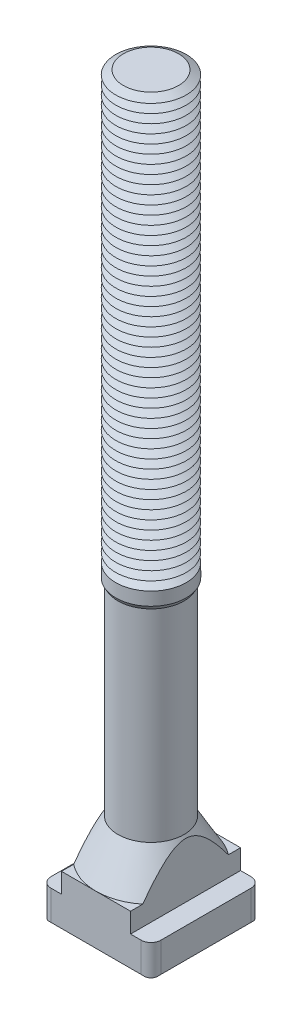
ISO-10303-21;
HEADER;
FILE_DESCRIPTION(('STEP AP214'),'2;1');
FILE_NAME('part.step','',(''),(''),'','','');
FILE_SCHEMA(('AUTOMOTIVE_DESIGN { 1 0 10303 214 1 1 1 1 }'));
ENDSEC;
DATA;
#1=APPLICATION_CONTEXT('core data for automotive mechanical design processes');
#2=APPLICATION_PROTOCOL_DEFINITION('international standard','automotive_design',2000,#1);
#3=PRODUCT_CONTEXT('',#1,'mechanical');
#4=PRODUCT('Part','Part','',(#3));
#5=PRODUCT_RELATED_PRODUCT_CATEGORY('part','',(#4));
#6=PRODUCT_DEFINITION_FORMATION('','',#4);
#7=PRODUCT_DEFINITION_CONTEXT('part definition',#1,'design');
#8=PRODUCT_DEFINITION('design','',#6,#7);
#9=PRODUCT_DEFINITION_SHAPE('','',#8);
#10=(LENGTH_UNIT() NAMED_UNIT(*) SI_UNIT(.MILLI.,.METRE.));
#11=(NAMED_UNIT(*) PLANE_ANGLE_UNIT() SI_UNIT($,.RADIAN.));
#12=(NAMED_UNIT(*) SI_UNIT($,.STERADIAN.) SOLID_ANGLE_UNIT());
#13=UNCERTAINTY_MEASURE_WITH_UNIT(LENGTH_MEASURE(1.E-05),#10,'distance_accuracy_value','');
#14=(GEOMETRIC_REPRESENTATION_CONTEXT(3) GLOBAL_UNCERTAINTY_ASSIGNED_CONTEXT((#13)) GLOBAL_UNIT_ASSIGNED_CONTEXT((#10,
#11,#12)) REPRESENTATION_CONTEXT('',''));
#15=CARTESIAN_POINT('',(0.,0.,0.));
#16=DIRECTION('',(0.,0.,1.));
#17=DIRECTION('',(1.,0.,0.));
#18=AXIS2_PLACEMENT_3D('',#15,#16,#17);
#19=CARTESIAN_POINT('',(0.,161.,0.));
#20=DIRECTION('',(0.,-1.,0.));
#21=DIRECTION('',(0.,0.,-1.));
#22=AXIS2_PLACEMENT_3D('',#19,#20,#21);
#23=CONICAL_SURFACE('',#22,6.26794919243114,1.0471975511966);
#24=CARTESIAN_POINT('',(0.,160.,0.));
#25=DIRECTION('',(0.,-1.,0.));
#26=DIRECTION('',(0.,0.,-1.));
#27=AXIS2_PLACEMENT_3D('',#24,#25,#26);
#28=CIRCLE('',#27,8.00000000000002);
#29=CARTESIAN_POINT('',(0.,160.,-8.00000000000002));
#30=VERTEX_POINT('',#29);
#31=EDGE_CURVE('E762',#30,#30,#28,.T.);
#32=ORIENTED_EDGE('',*,*,#31,.F.);
#33=EDGE_LOOP('',(#32));
#34=FACE_BOUND('',#33,.T.);
#35=CARTESIAN_POINT('',(0.,161.,0.));
#36=DIRECTION('',(0.,-1.,0.));
#37=DIRECTION('',(0.,0.,-1.));
#38=AXIS2_PLACEMENT_3D('',#35,#36,#37);
#39=CIRCLE('',#38,6.26794919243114);
#40=CARTESIAN_POINT('',(0.,161.,-6.26794919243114));
#41=VERTEX_POINT('',#40);
#42=EDGE_CURVE('E722',#41,#41,#39,.T.);
#43=ORIENTED_EDGE('',*,*,#42,.T.);
#44=EDGE_LOOP('',(#43));
#45=FACE_BOUND('',#44,.T.);
#46=ADVANCED_FACE('F39',(#34,#45),#23,.T.);
#47=CARTESIAN_POINT('',(0.,162.,0.));
#48=DIRECTION('',(0.,1.,0.));
#49=DIRECTION('',(0.,0.,1.));
#50=AXIS2_PLACEMENT_3D('',#47,#48,#49);
#51=CONICAL_SURFACE('',#50,8.00000000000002,1.0471975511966);
#52=ORIENTED_EDGE('',*,*,#42,.F.);
#53=EDGE_LOOP('',(#52));
#54=FACE_BOUND('',#53,.T.);
#55=CARTESIAN_POINT('',(0.,162.,0.));
#56=DIRECTION('',(0.,-1.,0.));
#57=DIRECTION('',(0.,0.,-1.));
#58=AXIS2_PLACEMENT_3D('',#55,#56,#57);
#59=CIRCLE('',#58,8.00000000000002);
#60=CARTESIAN_POINT('',(0.,162.,-8.00000000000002));
#61=VERTEX_POINT('',#60);
#62=EDGE_CURVE('E718',#61,#61,#59,.T.);
#63=ORIENTED_EDGE('',*,*,#62,.T.);
#64=EDGE_LOOP('',(#63));
#65=FACE_BOUND('',#64,.T.);
#66=ADVANCED_FACE('F449',(#54,#65),#51,.T.);
#67=CARTESIAN_POINT('',(3.9821659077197,169.,0.));
#68=DIRECTION('',(0.,-1.,0.));
#69=DIRECTION('',(1.,0.,0.));
#70=AXIS2_PLACEMENT_3D('',#67,#68,#69);
#71=PLANE('',#70);
#72=CARTESIAN_POINT('',(0.,169.,0.));
#73=DIRECTION('',(0.,-1.,0.));
#74=DIRECTION('',(0.,0.,-1.));
#75=AXIS2_PLACEMENT_3D('',#72,#73,#74);
#76=CIRCLE('',#75,6.26794919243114);
#77=CARTESIAN_POINT('',(0.,169.,-6.26794919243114));
#78=VERTEX_POINT('',#77);
#79=EDGE_CURVE('E728',#78,#78,#76,.T.);
#80=ORIENTED_EDGE('',*,*,#79,.F.);
#81=EDGE_LOOP('',(#80));
#82=FACE_BOUND('',#81,.T.);
#83=ADVANCED_FACE('F455',(#82),#71,.F.);
#84=CARTESIAN_POINT('',(0.,169.,0.));
#85=DIRECTION('',(0.,-1.,0.));
#86=DIRECTION('',(0.,0.,-1.));
#87=AXIS2_PLACEMENT_3D('',#84,#85,#86);
#88=CONICAL_SURFACE('',#87,6.26794919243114,1.0471975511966);
#89=CARTESIAN_POINT('',(0.,168.,0.));
#90=DIRECTION('',(0.,-1.,0.));
#91=DIRECTION('',(0.,0.,-1.));
#92=AXIS2_PLACEMENT_3D('',#89,#90,#91);
#93=CIRCLE('',#92,8.00000000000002);
#94=CARTESIAN_POINT('',(0.,168.,-8.00000000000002));
#95=VERTEX_POINT('',#94);
#96=EDGE_CURVE('E760',#95,#95,#93,.T.);
#97=ORIENTED_EDGE('',*,*,#96,.F.);
#98=EDGE_LOOP('',(#97));
#99=FACE_BOUND('',#98,.T.);
#100=ORIENTED_EDGE('',*,*,#79,.T.);
#101=EDGE_LOOP('',(#100));
#102=FACE_BOUND('',#101,.T.);
#103=ADVANCED_FACE('F483',(#99,#102),#88,.T.);
#104=CARTESIAN_POINT('',(0.,168.,0.));
#105=DIRECTION('',(0.,1.,0.));
#106=DIRECTION('',(0.,0.,1.));
#107=AXIS2_PLACEMENT_3D('',#104,#105,#106);
#108=CONICAL_SURFACE('',#107,8.00000000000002,1.0471975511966);
#109=CARTESIAN_POINT('',(0.,167.,0.));
#110=DIRECTION('',(0.,-1.,0.));
#111=DIRECTION('',(0.,0.,-1.));
#112=AXIS2_PLACEMENT_3D('',#109,#110,#111);
#113=CIRCLE('',#112,6.26794919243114);
#114=CARTESIAN_POINT('',(0.,167.,-6.26794919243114));
#115=VERTEX_POINT('',#114);
#116=EDGE_CURVE('E802',#115,#115,#113,.T.);
#117=ORIENTED_EDGE('',*,*,#116,.F.);
#118=EDGE_LOOP('',(#117));
#119=FACE_BOUND('',#118,.T.);
#120=ORIENTED_EDGE('',*,*,#96,.T.);
#121=EDGE_LOOP('',(#120));
#122=FACE_BOUND('',#121,.T.);
#123=ADVANCED_FACE('F480',(#119,#122),#108,.T.);
#124=CARTESIAN_POINT('',(0.,167.,0.));
#125=DIRECTION('',(0.,-1.,0.));
#126=DIRECTION('',(0.,0.,-1.));
#127=AXIS2_PLACEMENT_3D('',#124,#125,#126);
#128=CONICAL_SURFACE('',#127,6.26794919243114,1.0471975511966);
#129=CARTESIAN_POINT('',(0.,166.,0.));
#130=DIRECTION('',(0.,-1.,0.));
#131=DIRECTION('',(0.,0.,-1.));
#132=AXIS2_PLACEMENT_3D('',#129,#130,#131);
#133=CIRCLE('',#132,8.00000000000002);
#134=CARTESIAN_POINT('',(0.,166.,-8.00000000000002));
#135=VERTEX_POINT('',#134);
#136=EDGE_CURVE('E690',#135,#135,#133,.T.);
#137=ORIENTED_EDGE('',*,*,#136,.F.);
#138=EDGE_LOOP('',(#137));
#139=FACE_BOUND('',#138,.T.);
#140=ORIENTED_EDGE('',*,*,#116,.T.);
#141=EDGE_LOOP('',(#140));
#142=FACE_BOUND('',#141,.T.);
#143=ADVANCED_FACE('F475',(#139,#142),#128,.T.);
#144=CARTESIAN_POINT('',(0.,166.,0.));
#145=DIRECTION('',(0.,1.,0.));
#146=DIRECTION('',(0.,0.,1.));
#147=AXIS2_PLACEMENT_3D('',#144,#145,#146);
#148=CONICAL_SURFACE('',#147,8.00000000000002,1.0471975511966);
#149=CARTESIAN_POINT('',(0.,165.,0.));
#150=DIRECTION('',(0.,-1.,0.));
#151=DIRECTION('',(0.,0.,-1.));
#152=AXIS2_PLACEMENT_3D('',#149,#150,#151);
#153=CIRCLE('',#152,6.26794919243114);
#154=CARTESIAN_POINT('',(0.,165.,-6.26794919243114));
#155=VERTEX_POINT('',#154);
#156=EDGE_CURVE('E688',#155,#155,#153,.T.);
#157=ORIENTED_EDGE('',*,*,#156,.F.);
#158=EDGE_LOOP('',(#157));
#159=FACE_BOUND('',#158,.T.);
#160=ORIENTED_EDGE('',*,*,#136,.T.);
#161=EDGE_LOOP('',(#160));
#162=FACE_BOUND('',#161,.T.);
#163=ADVANCED_FACE('F472',(#159,#162),#148,.T.);
#164=CARTESIAN_POINT('',(0.,165.,0.));
#165=DIRECTION('',(0.,-1.,0.));
#166=DIRECTION('',(0.,0.,-1.));
#167=AXIS2_PLACEMENT_3D('',#164,#165,#166);
#168=CONICAL_SURFACE('',#167,6.26794919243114,1.0471975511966);
#169=CARTESIAN_POINT('',(0.,164.,0.));
#170=DIRECTION('',(0.,-1.,0.));
#171=DIRECTION('',(0.,0.,-1.));
#172=AXIS2_PLACEMENT_3D('',#169,#170,#171);
#173=CIRCLE('',#172,8.00000000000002);
#174=CARTESIAN_POINT('',(0.,164.,-8.00000000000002));
#175=VERTEX_POINT('',#174);
#176=EDGE_CURVE('E691',#175,#175,#173,.T.);
#177=ORIENTED_EDGE('',*,*,#176,.F.);
#178=EDGE_LOOP('',(#177));
#179=FACE_BOUND('',#178,.T.);
#180=ORIENTED_EDGE('',*,*,#156,.T.);
#181=EDGE_LOOP('',(#180));
#182=FACE_BOUND('',#181,.T.);
#183=ADVANCED_FACE('F466',(#179,#182),#168,.T.);
#184=CARTESIAN_POINT('',(0.,164.,0.));
#185=DIRECTION('',(0.,1.,0.));
#186=DIRECTION('',(0.,0.,1.));
#187=AXIS2_PLACEMENT_3D('',#184,#185,#186);
#188=CONICAL_SURFACE('',#187,8.00000000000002,1.0471975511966);
#189=CARTESIAN_POINT('',(0.,163.,0.));
#190=DIRECTION('',(0.,-1.,0.));
#191=DIRECTION('',(0.,0.,-1.));
#192=AXIS2_PLACEMENT_3D('',#189,#190,#191);
#193=CIRCLE('',#192,6.26794919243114);
#194=CARTESIAN_POINT('',(0.,163.,-6.26794919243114));
#195=VERTEX_POINT('',#194);
#196=EDGE_CURVE('E721',#195,#195,#193,.T.);
#197=ORIENTED_EDGE('',*,*,#196,.F.);
#198=EDGE_LOOP('',(#197));
#199=FACE_BOUND('',#198,.T.);
#200=ORIENTED_EDGE('',*,*,#176,.T.);
#201=EDGE_LOOP('',(#200));
#202=FACE_BOUND('',#201,.T.);
#203=ADVANCED_FACE('F462',(#199,#202),#188,.T.);
#204=CARTESIAN_POINT('',(0.,163.,0.));
#205=DIRECTION('',(0.,-1.,0.));
#206=DIRECTION('',(0.,0.,-1.));
#207=AXIS2_PLACEMENT_3D('',#204,#205,#206);
#208=CONICAL_SURFACE('',#207,6.26794919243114,1.0471975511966);
#209=ORIENTED_EDGE('',*,*,#62,.F.);
#210=EDGE_LOOP('',(#209));
#211=FACE_BOUND('',#210,.T.);
#212=ORIENTED_EDGE('',*,*,#196,.T.);
#213=EDGE_LOOP('',(#212));
#214=FACE_BOUND('',#213,.T.);
#215=ADVANCED_FACE('F465',(#211,#214),#208,.T.);
#216=CARTESIAN_POINT('',(0.,159.,0.));
#217=DIRECTION('',(0.,-1.,0.));
#218=DIRECTION('',(0.,0.,-1.));
#219=AXIS2_PLACEMENT_3D('',#216,#217,#218);
#220=CONICAL_SURFACE('',#219,6.26794919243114,1.0471975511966);
#221=CARTESIAN_POINT('',(0.,158.,0.));
#222=DIRECTION('',(0.,-1.,0.));
#223=DIRECTION('',(0.,0.,-1.));
#224=AXIS2_PLACEMENT_3D('',#221,#222,#223);
#225=CIRCLE('',#224,8.00000000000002);
#226=CARTESIAN_POINT('',(0.,158.,-8.00000000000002));
#227=VERTEX_POINT('',#226);
#228=EDGE_CURVE('E781',#227,#227,#225,.T.);
#229=ORIENTED_EDGE('',*,*,#228,.F.);
#230=EDGE_LOOP('',(#229));
#231=FACE_BOUND('',#230,.T.);
#232=CARTESIAN_POINT('',(0.,159.,0.));
#233=DIRECTION('',(0.,-1.,0.));
#234=DIRECTION('',(0.,0.,-1.));
#235=AXIS2_PLACEMENT_3D('',#232,#233,#234);
#236=CIRCLE('',#235,6.26794919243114);
#237=CARTESIAN_POINT('',(0.,159.,-6.26794919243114));
#238=VERTEX_POINT('',#237);
#239=EDGE_CURVE('E764',#238,#238,#236,.T.);
#240=ORIENTED_EDGE('',*,*,#239,.T.);
#241=EDGE_LOOP('',(#240));
#242=FACE_BOUND('',#241,.T.);
#243=ADVANCED_FACE('F470',(#231,#242),#220,.T.);
#244=CARTESIAN_POINT('',(0.,160.,0.));
#245=DIRECTION('',(0.,1.,0.));
#246=DIRECTION('',(0.,0.,1.));
#247=AXIS2_PLACEMENT_3D('',#244,#245,#246);
#248=CONICAL_SURFACE('',#247,8.00000000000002,1.0471975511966);
#249=ORIENTED_EDGE('',*,*,#239,.F.);
#250=EDGE_LOOP('',(#249));
#251=FACE_BOUND('',#250,.T.);
#252=ORIENTED_EDGE('',*,*,#31,.T.);
#253=EDGE_LOOP('',(#252));
#254=FACE_BOUND('',#253,.T.);
#255=ADVANCED_FACE('F1751',(#251,#254),#248,.T.);
#256=CARTESIAN_POINT('',(0.,157.,0.));
#257=DIRECTION('',(0.,-1.,0.));
#258=DIRECTION('',(0.,0.,-1.));
#259=AXIS2_PLACEMENT_3D('',#256,#257,#258);
#260=CONICAL_SURFACE('',#259,6.26794919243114,1.0471975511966);
#261=CARTESIAN_POINT('',(0.,156.,0.));
#262=DIRECTION('',(0.,-1.,0.));
#263=DIRECTION('',(0.,0.,-1.));
#264=AXIS2_PLACEMENT_3D('',#261,#262,#263);
#265=CIRCLE('',#264,8.00000000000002);
#266=CARTESIAN_POINT('',(0.,156.,-8.00000000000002));
#267=VERTEX_POINT('',#266);
#268=EDGE_CURVE('E782',#267,#267,#265,.T.);
#269=ORIENTED_EDGE('',*,*,#268,.F.);
#270=EDGE_LOOP('',(#269));
#271=FACE_BOUND('',#270,.T.);
#272=CARTESIAN_POINT('',(0.,157.,0.));
#273=DIRECTION('',(0.,-1.,0.));
#274=DIRECTION('',(0.,0.,-1.));
#275=AXIS2_PLACEMENT_3D('',#272,#273,#274);
#276=CIRCLE('',#275,6.26794919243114);
#277=CARTESIAN_POINT('',(0.,157.,-6.26794919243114));
#278=VERTEX_POINT('',#277);
#279=EDGE_CURVE('E779',#278,#278,#276,.T.);
#280=ORIENTED_EDGE('',*,*,#279,.T.);
#281=EDGE_LOOP('',(#280));
#282=FACE_BOUND('',#281,.T.);
#283=ADVANCED_FACE('F1742',(#271,#282),#260,.T.);
#284=CARTESIAN_POINT('',(0.,158.,0.));
#285=DIRECTION('',(0.,1.,0.));
#286=DIRECTION('',(0.,0.,1.));
#287=AXIS2_PLACEMENT_3D('',#284,#285,#286);
#288=CONICAL_SURFACE('',#287,8.00000000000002,1.0471975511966);
#289=ORIENTED_EDGE('',*,*,#279,.F.);
#290=EDGE_LOOP('',(#289));
#291=FACE_BOUND('',#290,.T.);
#292=ORIENTED_EDGE('',*,*,#228,.T.);
#293=EDGE_LOOP('',(#292));
#294=FACE_BOUND('',#293,.T.);
#295=ADVANCED_FACE('F1733',(#291,#294),#288,.T.);
#296=CARTESIAN_POINT('',(0.,155.,0.));
#297=DIRECTION('',(0.,-1.,0.));
#298=DIRECTION('',(0.,0.,-1.));
#299=AXIS2_PLACEMENT_3D('',#296,#297,#298);
#300=CONICAL_SURFACE('',#299,6.26794919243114,1.0471975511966);
#301=CARTESIAN_POINT('',(0.,154.,0.));
#302=DIRECTION('',(0.,-1.,0.));
#303=DIRECTION('',(0.,0.,-1.));
#304=AXIS2_PLACEMENT_3D('',#301,#302,#303);
#305=CIRCLE('',#304,8.00000000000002);
#306=CARTESIAN_POINT('',(0.,154.,-8.00000000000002));
#307=VERTEX_POINT('',#306);
#308=EDGE_CURVE('E715',#307,#307,#305,.T.);
#309=ORIENTED_EDGE('',*,*,#308,.F.);
#310=EDGE_LOOP('',(#309));
#311=FACE_BOUND('',#310,.T.);
#312=CARTESIAN_POINT('',(0.,155.,0.));
#313=DIRECTION('',(0.,-1.,0.));
#314=DIRECTION('',(0.,0.,-1.));
#315=AXIS2_PLACEMENT_3D('',#312,#313,#314);
#316=CIRCLE('',#315,6.26794919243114);
#317=CARTESIAN_POINT('',(0.,155.,-6.26794919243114));
#318=VERTEX_POINT('',#317);
#319=EDGE_CURVE('E833',#318,#318,#316,.T.);
#320=ORIENTED_EDGE('',*,*,#319,.T.);
#321=EDGE_LOOP('',(#320));
#322=FACE_BOUND('',#321,.T.);
#323=ADVANCED_FACE('F1724',(#311,#322),#300,.T.);
#324=CARTESIAN_POINT('',(0.,156.,0.));
#325=DIRECTION('',(0.,1.,0.));
#326=DIRECTION('',(0.,0.,1.));
#327=AXIS2_PLACEMENT_3D('',#324,#325,#326);
#328=CONICAL_SURFACE('',#327,8.00000000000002,1.0471975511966);
#329=ORIENTED_EDGE('',*,*,#319,.F.);
#330=EDGE_LOOP('',(#329));
#331=FACE_BOUND('',#330,.T.);
#332=ORIENTED_EDGE('',*,*,#268,.T.);
#333=EDGE_LOOP('',(#332));
#334=FACE_BOUND('',#333,.T.);
#335=ADVANCED_FACE('F1715',(#331,#334),#328,.T.);
#336=CARTESIAN_POINT('',(0.,153.,0.));
#337=DIRECTION('',(0.,-1.,0.));
#338=DIRECTION('',(0.,0.,-1.));
#339=AXIS2_PLACEMENT_3D('',#336,#337,#338);
#340=CONICAL_SURFACE('',#339,6.26794919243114,1.0471975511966);
#341=CARTESIAN_POINT('',(0.,152.,0.));
#342=DIRECTION('',(0.,-1.,0.));
#343=DIRECTION('',(0.,0.,-1.));
#344=AXIS2_PLACEMENT_3D('',#341,#342,#343);
#345=CIRCLE('',#344,8.00000000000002);
#346=CARTESIAN_POINT('',(0.,152.,-8.00000000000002));
#347=VERTEX_POINT('',#346);
#348=EDGE_CURVE('E716',#347,#347,#345,.T.);
#349=ORIENTED_EDGE('',*,*,#348,.F.);
#350=EDGE_LOOP('',(#349));
#351=FACE_BOUND('',#350,.T.);
#352=CARTESIAN_POINT('',(0.,153.,0.));
#353=DIRECTION('',(0.,-1.,0.));
#354=DIRECTION('',(0.,0.,-1.));
#355=AXIS2_PLACEMENT_3D('',#352,#353,#354);
#356=CIRCLE('',#355,6.26794919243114);
#357=CARTESIAN_POINT('',(0.,153.,-6.26794919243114));
#358=VERTEX_POINT('',#357);
#359=EDGE_CURVE('E712',#358,#358,#356,.T.);
#360=ORIENTED_EDGE('',*,*,#359,.T.);
#361=EDGE_LOOP('',(#360));
#362=FACE_BOUND('',#361,.T.);
#363=ADVANCED_FACE('F1706',(#351,#362),#340,.T.);
#364=CARTESIAN_POINT('',(0.,154.,0.));
#365=DIRECTION('',(0.,1.,0.));
#366=DIRECTION('',(0.,0.,1.));
#367=AXIS2_PLACEMENT_3D('',#364,#365,#366);
#368=CONICAL_SURFACE('',#367,8.00000000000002,1.0471975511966);
#369=ORIENTED_EDGE('',*,*,#359,.F.);
#370=EDGE_LOOP('',(#369));
#371=FACE_BOUND('',#370,.T.);
#372=ORIENTED_EDGE('',*,*,#308,.T.);
#373=EDGE_LOOP('',(#372));
#374=FACE_BOUND('',#373,.T.);
#375=ADVANCED_FACE('F1697',(#371,#374),#368,.T.);
#376=CARTESIAN_POINT('',(0.,151.,0.));
#377=DIRECTION('',(0.,-1.,0.));
#378=DIRECTION('',(0.,0.,-1.));
#379=AXIS2_PLACEMENT_3D('',#376,#377,#378);
#380=CONICAL_SURFACE('',#379,6.26794919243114,1.0471975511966);
#381=CARTESIAN_POINT('',(0.,150.,0.));
#382=DIRECTION('',(0.,-1.,0.));
#383=DIRECTION('',(0.,0.,-1.));
#384=AXIS2_PLACEMENT_3D('',#381,#382,#383);
#385=CIRCLE('',#384,8.00000000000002);
#386=CARTESIAN_POINT('',(0.,150.,-8.00000000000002));
#387=VERTEX_POINT('',#386);
#388=EDGE_CURVE('E659',#387,#387,#385,.T.);
#389=ORIENTED_EDGE('',*,*,#388,.F.);
#390=EDGE_LOOP('',(#389));
#391=FACE_BOUND('',#390,.T.);
#392=CARTESIAN_POINT('',(0.,151.,0.));
#393=DIRECTION('',(0.,-1.,0.));
#394=DIRECTION('',(0.,0.,-1.));
#395=AXIS2_PLACEMENT_3D('',#392,#393,#394);
#396=CIRCLE('',#395,6.26794919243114);
#397=CARTESIAN_POINT('',(0.,151.,-6.26794919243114));
#398=VERTEX_POINT('',#397);
#399=EDGE_CURVE('E821',#398,#398,#396,.T.);
#400=ORIENTED_EDGE('',*,*,#399,.T.);
#401=EDGE_LOOP('',(#400));
#402=FACE_BOUND('',#401,.T.);
#403=ADVANCED_FACE('F1688',(#391,#402),#380,.T.);
#404=CARTESIAN_POINT('',(0.,152.,0.));
#405=DIRECTION('',(0.,1.,0.));
#406=DIRECTION('',(0.,0.,1.));
#407=AXIS2_PLACEMENT_3D('',#404,#405,#406);
#408=CONICAL_SURFACE('',#407,8.00000000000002,1.0471975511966);
#409=ORIENTED_EDGE('',*,*,#399,.F.);
#410=EDGE_LOOP('',(#409));
#411=FACE_BOUND('',#410,.T.);
#412=ORIENTED_EDGE('',*,*,#348,.T.);
#413=EDGE_LOOP('',(#412));
#414=FACE_BOUND('',#413,.T.);
#415=ADVANCED_FACE('F1679',(#411,#414),#408,.T.);
#416=CARTESIAN_POINT('',(0.,149.,0.));
#417=DIRECTION('',(0.,-1.,0.));
#418=DIRECTION('',(0.,0.,-1.));
#419=AXIS2_PLACEMENT_3D('',#416,#417,#418);
#420=CONICAL_SURFACE('',#419,6.26794919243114,1.0471975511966);
#421=CARTESIAN_POINT('',(0.,148.,0.));
#422=DIRECTION('',(0.,-1.,0.));
#423=DIRECTION('',(0.,0.,-1.));
#424=AXIS2_PLACEMENT_3D('',#421,#422,#423);
#425=CIRCLE('',#424,8.00000000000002);
#426=CARTESIAN_POINT('',(0.,148.,-8.00000000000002));
#427=VERTEX_POINT('',#426);
#428=EDGE_CURVE('E660',#427,#427,#425,.T.);
#429=ORIENTED_EDGE('',*,*,#428,.F.);
#430=EDGE_LOOP('',(#429));
#431=FACE_BOUND('',#430,.T.);
#432=CARTESIAN_POINT('',(0.,149.,0.));
#433=DIRECTION('',(0.,-1.,0.));
#434=DIRECTION('',(0.,0.,-1.));
#435=AXIS2_PLACEMENT_3D('',#432,#433,#434);
#436=CIRCLE('',#435,6.26794919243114);
#437=CARTESIAN_POINT('',(0.,149.,-6.26794919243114));
#438=VERTEX_POINT('',#437);
#439=EDGE_CURVE('E657',#438,#438,#436,.T.);
#440=ORIENTED_EDGE('',*,*,#439,.T.);
#441=EDGE_LOOP('',(#440));
#442=FACE_BOUND('',#441,.T.);
#443=ADVANCED_FACE('F1670',(#431,#442),#420,.T.);
#444=CARTESIAN_POINT('',(0.,150.,0.));
#445=DIRECTION('',(0.,1.,0.));
#446=DIRECTION('',(0.,0.,1.));
#447=AXIS2_PLACEMENT_3D('',#444,#445,#446);
#448=CONICAL_SURFACE('',#447,8.00000000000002,1.0471975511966);
#449=ORIENTED_EDGE('',*,*,#439,.F.);
#450=EDGE_LOOP('',(#449));
#451=FACE_BOUND('',#450,.T.);
#452=ORIENTED_EDGE('',*,*,#388,.T.);
#453=EDGE_LOOP('',(#452));
#454=FACE_BOUND('',#453,.T.);
#455=ADVANCED_FACE('F1661',(#451,#454),#448,.T.);
#456=CARTESIAN_POINT('',(0.,147.,0.));
#457=DIRECTION('',(0.,-1.,0.));
#458=DIRECTION('',(0.,0.,-1.));
#459=AXIS2_PLACEMENT_3D('',#456,#457,#458);
#460=CONICAL_SURFACE('',#459,6.26794919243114,1.0471975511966);
#461=CARTESIAN_POINT('',(0.,146.,0.));
#462=DIRECTION('',(0.,-1.,0.));
#463=DIRECTION('',(0.,0.,-1.));
#464=AXIS2_PLACEMENT_3D('',#461,#462,#463);
#465=CIRCLE('',#464,8.00000000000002);
#466=CARTESIAN_POINT('',(0.,146.,-8.00000000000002));
#467=VERTEX_POINT('',#466);
#468=EDGE_CURVE('E2130',#467,#467,#465,.T.);
#469=ORIENTED_EDGE('',*,*,#468,.F.);
#470=EDGE_LOOP('',(#469));
#471=FACE_BOUND('',#470,.T.);
#472=CARTESIAN_POINT('',(0.,147.,0.));
#473=DIRECTION('',(0.,-1.,0.));
#474=DIRECTION('',(0.,0.,-1.));
#475=AXIS2_PLACEMENT_3D('',#472,#473,#474);
#476=CIRCLE('',#475,6.26794919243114);
#477=CARTESIAN_POINT('',(0.,147.,-6.26794919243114));
#478=VERTEX_POINT('',#477);
#479=EDGE_CURVE('E2126',#478,#478,#476,.T.);
#480=ORIENTED_EDGE('',*,*,#479,.T.);
#481=EDGE_LOOP('',(#480));
#482=FACE_BOUND('',#481,.T.);
#483=ADVANCED_FACE('F1652',(#471,#482),#460,.T.);
#484=CARTESIAN_POINT('',(0.,148.,0.));
#485=DIRECTION('',(0.,1.,0.));
#486=DIRECTION('',(0.,0.,1.));
#487=AXIS2_PLACEMENT_3D('',#484,#485,#486);
#488=CONICAL_SURFACE('',#487,8.00000000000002,1.0471975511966);
#489=ORIENTED_EDGE('',*,*,#479,.F.);
#490=EDGE_LOOP('',(#489));
#491=FACE_BOUND('',#490,.T.);
#492=ORIENTED_EDGE('',*,*,#428,.T.);
#493=EDGE_LOOP('',(#492));
#494=FACE_BOUND('',#493,.T.);
#495=ADVANCED_FACE('F1643',(#491,#494),#488,.T.);
#496=CARTESIAN_POINT('',(0.,145.,0.));
#497=DIRECTION('',(0.,-1.,0.));
#498=DIRECTION('',(0.,0.,-1.));
#499=AXIS2_PLACEMENT_3D('',#496,#497,#498);
#500=CONICAL_SURFACE('',#499,6.26794919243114,1.0471975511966);
#501=CARTESIAN_POINT('',(0.,144.,0.));
#502=DIRECTION('',(0.,-1.,0.));
#503=DIRECTION('',(0.,0.,-1.));
#504=AXIS2_PLACEMENT_3D('',#501,#502,#503);
#505=CIRCLE('',#504,8.00000000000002);
#506=CARTESIAN_POINT('',(0.,144.,-8.00000000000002));
#507=VERTEX_POINT('',#506);
#508=EDGE_CURVE('E2138',#507,#507,#505,.T.);
#509=ORIENTED_EDGE('',*,*,#508,.F.);
#510=EDGE_LOOP('',(#509));
#511=FACE_BOUND('',#510,.T.);
#512=CARTESIAN_POINT('',(0.,145.,0.));
#513=DIRECTION('',(0.,-1.,0.));
#514=DIRECTION('',(0.,0.,-1.));
#515=AXIS2_PLACEMENT_3D('',#512,#513,#514);
#516=CIRCLE('',#515,6.26794919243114);
#517=CARTESIAN_POINT('',(0.,145.,-6.26794919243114));
#518=VERTEX_POINT('',#517);
#519=EDGE_CURVE('E2134',#518,#518,#516,.T.);
#520=ORIENTED_EDGE('',*,*,#519,.T.);
#521=EDGE_LOOP('',(#520));
#522=FACE_BOUND('',#521,.T.);
#523=ADVANCED_FACE('F1634',(#511,#522),#500,.T.);
#524=CARTESIAN_POINT('',(0.,146.,0.));
#525=DIRECTION('',(0.,1.,0.));
#526=DIRECTION('',(0.,0.,1.));
#527=AXIS2_PLACEMENT_3D('',#524,#525,#526);
#528=CONICAL_SURFACE('',#527,8.00000000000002,1.0471975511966);
#529=ORIENTED_EDGE('',*,*,#519,.F.);
#530=EDGE_LOOP('',(#529));
#531=FACE_BOUND('',#530,.T.);
#532=ORIENTED_EDGE('',*,*,#468,.T.);
#533=EDGE_LOOP('',(#532));
#534=FACE_BOUND('',#533,.T.);
#535=ADVANCED_FACE('F1625',(#531,#534),#528,.T.);
#536=CARTESIAN_POINT('',(0.,143.,0.));
#537=DIRECTION('',(0.,-1.,0.));
#538=DIRECTION('',(0.,0.,-1.));
#539=AXIS2_PLACEMENT_3D('',#536,#537,#538);
#540=CONICAL_SURFACE('',#539,6.26794919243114,1.0471975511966);
#541=CARTESIAN_POINT('',(0.,142.,0.));
#542=DIRECTION('',(0.,-1.,0.));
#543=DIRECTION('',(0.,0.,-1.));
#544=AXIS2_PLACEMENT_3D('',#541,#542,#543);
#545=CIRCLE('',#544,8.00000000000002);
#546=CARTESIAN_POINT('',(0.,142.,-8.00000000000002));
#547=VERTEX_POINT('',#546);
#548=EDGE_CURVE('E752',#547,#547,#545,.T.);
#549=ORIENTED_EDGE('',*,*,#548,.F.);
#550=EDGE_LOOP('',(#549));
#551=FACE_BOUND('',#550,.T.);
#552=CARTESIAN_POINT('',(0.,143.,0.));
#553=DIRECTION('',(0.,-1.,0.));
#554=DIRECTION('',(0.,0.,-1.));
#555=AXIS2_PLACEMENT_3D('',#552,#553,#554);
#556=CIRCLE('',#555,6.26794919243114);
#557=CARTESIAN_POINT('',(0.,143.,-6.26794919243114));
#558=VERTEX_POINT('',#557);
#559=EDGE_CURVE('E755',#558,#558,#556,.T.);
#560=ORIENTED_EDGE('',*,*,#559,.T.);
#561=EDGE_LOOP('',(#560));
#562=FACE_BOUND('',#561,.T.);
#563=ADVANCED_FACE('F1616',(#551,#562),#540,.T.);
#564=CARTESIAN_POINT('',(0.,144.,0.));
#565=DIRECTION('',(0.,1.,0.));
#566=DIRECTION('',(0.,0.,1.));
#567=AXIS2_PLACEMENT_3D('',#564,#565,#566);
#568=CONICAL_SURFACE('',#567,8.00000000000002,1.0471975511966);
#569=ORIENTED_EDGE('',*,*,#559,.F.);
#570=EDGE_LOOP('',(#569));
#571=FACE_BOUND('',#570,.T.);
#572=ORIENTED_EDGE('',*,*,#508,.T.);
#573=EDGE_LOOP('',(#572));
#574=FACE_BOUND('',#573,.T.);
#575=ADVANCED_FACE('F1607',(#571,#574),#568,.T.);
#576=CARTESIAN_POINT('',(0.,141.,0.));
#577=DIRECTION('',(0.,-1.,0.));
#578=DIRECTION('',(0.,0.,-1.));
#579=AXIS2_PLACEMENT_3D('',#576,#577,#578);
#580=CONICAL_SURFACE('',#579,6.26794919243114,1.0471975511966);
#581=CARTESIAN_POINT('',(0.,140.,0.));
#582=DIRECTION('',(0.,-1.,0.));
#583=DIRECTION('',(0.,0.,-1.));
#584=AXIS2_PLACEMENT_3D('',#581,#582,#583);
#585=CIRCLE('',#584,8.00000000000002);
#586=CARTESIAN_POINT('',(0.,140.,-8.00000000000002));
#587=VERTEX_POINT('',#586);
#588=EDGE_CURVE('E2147',#587,#587,#585,.T.);
#589=ORIENTED_EDGE('',*,*,#588,.F.);
#590=EDGE_LOOP('',(#589));
#591=FACE_BOUND('',#590,.T.);
#592=CARTESIAN_POINT('',(0.,141.,0.));
#593=DIRECTION('',(0.,-1.,0.));
#594=DIRECTION('',(0.,0.,-1.));
#595=AXIS2_PLACEMENT_3D('',#592,#593,#594);
#596=CIRCLE('',#595,6.26794919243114);
#597=CARTESIAN_POINT('',(0.,141.,-6.26794919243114));
#598=VERTEX_POINT('',#597);
#599=EDGE_CURVE('E756',#598,#598,#596,.T.);
#600=ORIENTED_EDGE('',*,*,#599,.T.);
#601=EDGE_LOOP('',(#600));
#602=FACE_BOUND('',#601,.T.);
#603=ADVANCED_FACE('F1598',(#591,#602),#580,.T.);
#604=CARTESIAN_POINT('',(0.,142.,0.));
#605=DIRECTION('',(0.,1.,0.));
#606=DIRECTION('',(0.,0.,1.));
#607=AXIS2_PLACEMENT_3D('',#604,#605,#606);
#608=CONICAL_SURFACE('',#607,8.00000000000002,1.0471975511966);
#609=ORIENTED_EDGE('',*,*,#599,.F.);
#610=EDGE_LOOP('',(#609));
#611=FACE_BOUND('',#610,.T.);
#612=ORIENTED_EDGE('',*,*,#548,.T.);
#613=EDGE_LOOP('',(#612));
#614=FACE_BOUND('',#613,.T.);
#615=ADVANCED_FACE('F1589',(#611,#614),#608,.T.);
#616=CARTESIAN_POINT('',(0.,139.,0.));
#617=DIRECTION('',(0.,-1.,0.));
#618=DIRECTION('',(0.,0.,-1.));
#619=AXIS2_PLACEMENT_3D('',#616,#617,#618);
#620=CONICAL_SURFACE('',#619,6.26794919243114,1.0471975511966);
#621=CARTESIAN_POINT('',(0.,138.,0.));
#622=DIRECTION('',(0.,-1.,0.));
#623=DIRECTION('',(0.,0.,-1.));
#624=AXIS2_PLACEMENT_3D('',#621,#622,#623);
#625=CIRCLE('',#624,8.00000000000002);
#626=CARTESIAN_POINT('',(0.,138.,-8.00000000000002));
#627=VERTEX_POINT('',#626);
#628=EDGE_CURVE('E682',#627,#627,#625,.T.);
#629=ORIENTED_EDGE('',*,*,#628,.F.);
#630=EDGE_LOOP('',(#629));
#631=FACE_BOUND('',#630,.T.);
#632=CARTESIAN_POINT('',(0.,139.,0.));
#633=DIRECTION('',(0.,-1.,0.));
#634=DIRECTION('',(0.,0.,-1.));
#635=AXIS2_PLACEMENT_3D('',#632,#633,#634);
#636=CIRCLE('',#635,6.26794919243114);
#637=CARTESIAN_POINT('',(0.,139.,-6.26794919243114));
#638=VERTEX_POINT('',#637);
#639=EDGE_CURVE('E685',#638,#638,#636,.T.);
#640=ORIENTED_EDGE('',*,*,#639,.T.);
#641=EDGE_LOOP('',(#640));
#642=FACE_BOUND('',#641,.T.);
#643=ADVANCED_FACE('F1580',(#631,#642),#620,.T.);
#644=CARTESIAN_POINT('',(0.,140.,0.));
#645=DIRECTION('',(0.,1.,0.));
#646=DIRECTION('',(0.,0.,1.));
#647=AXIS2_PLACEMENT_3D('',#644,#645,#646);
#648=CONICAL_SURFACE('',#647,8.00000000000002,1.0471975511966);
#649=ORIENTED_EDGE('',*,*,#639,.F.);
#650=EDGE_LOOP('',(#649));
#651=FACE_BOUND('',#650,.T.);
#652=ORIENTED_EDGE('',*,*,#588,.T.);
#653=EDGE_LOOP('',(#652));
#654=FACE_BOUND('',#653,.T.);
#655=ADVANCED_FACE('F1571',(#651,#654),#648,.T.);
#656=CARTESIAN_POINT('',(0.,137.,0.));
#657=DIRECTION('',(0.,-1.,0.));
#658=DIRECTION('',(0.,0.,-1.));
#659=AXIS2_PLACEMENT_3D('',#656,#657,#658);
#660=CONICAL_SURFACE('',#659,6.26794919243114,1.0471975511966);
#661=CARTESIAN_POINT('',(0.,136.,0.));
#662=DIRECTION('',(0.,-1.,0.));
#663=DIRECTION('',(0.,0.,-1.));
#664=AXIS2_PLACEMENT_3D('',#661,#662,#663);
#665=CIRCLE('',#664,8.00000000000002);
#666=CARTESIAN_POINT('',(0.,136.,-8.00000000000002));
#667=VERTEX_POINT('',#666);
#668=EDGE_CURVE('E2157',#667,#667,#665,.T.);
#669=ORIENTED_EDGE('',*,*,#668,.F.);
#670=EDGE_LOOP('',(#669));
#671=FACE_BOUND('',#670,.T.);
#672=CARTESIAN_POINT('',(0.,137.,0.));
#673=DIRECTION('',(0.,-1.,0.));
#674=DIRECTION('',(0.,0.,-1.));
#675=AXIS2_PLACEMENT_3D('',#672,#673,#674);
#676=CIRCLE('',#675,6.26794919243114);
#677=CARTESIAN_POINT('',(0.,137.,-6.26794919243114));
#678=VERTEX_POINT('',#677);
#679=EDGE_CURVE('E686',#678,#678,#676,.T.);
#680=ORIENTED_EDGE('',*,*,#679,.T.);
#681=EDGE_LOOP('',(#680));
#682=FACE_BOUND('',#681,.T.);
#683=ADVANCED_FACE('F1562',(#671,#682),#660,.T.);
#684=CARTESIAN_POINT('',(0.,138.,0.));
#685=DIRECTION('',(0.,1.,0.));
#686=DIRECTION('',(0.,0.,1.));
#687=AXIS2_PLACEMENT_3D('',#684,#685,#686);
#688=CONICAL_SURFACE('',#687,8.00000000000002,1.0471975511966);
#689=ORIENTED_EDGE('',*,*,#679,.F.);
#690=EDGE_LOOP('',(#689));
#691=FACE_BOUND('',#690,.T.);
#692=ORIENTED_EDGE('',*,*,#628,.T.);
#693=EDGE_LOOP('',(#692));
#694=FACE_BOUND('',#693,.T.);
#695=ADVANCED_FACE('F1553',(#691,#694),#688,.T.);
#696=CARTESIAN_POINT('',(0.,135.,0.));
#697=DIRECTION('',(0.,-1.,0.));
#698=DIRECTION('',(0.,0.,-1.));
#699=AXIS2_PLACEMENT_3D('',#696,#697,#698);
#700=CONICAL_SURFACE('',#699,6.26794919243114,1.0471975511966);
#701=CARTESIAN_POINT('',(0.,134.,0.));
#702=DIRECTION('',(0.,-1.,0.));
#703=DIRECTION('',(0.,0.,-1.));
#704=AXIS2_PLACEMENT_3D('',#701,#702,#703);
#705=CIRCLE('',#704,8.00000000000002);
#706=CARTESIAN_POINT('',(0.,134.,-8.00000000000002));
#707=VERTEX_POINT('',#706);
#708=EDGE_CURVE('E776',#707,#707,#705,.T.);
#709=ORIENTED_EDGE('',*,*,#708,.F.);
#710=EDGE_LOOP('',(#709));
#711=FACE_BOUND('',#710,.T.);
#712=CARTESIAN_POINT('',(0.,135.,0.));
#713=DIRECTION('',(0.,-1.,0.));
#714=DIRECTION('',(0.,0.,-1.));
#715=AXIS2_PLACEMENT_3D('',#712,#713,#714);
#716=CIRCLE('',#715,6.26794919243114);
#717=CARTESIAN_POINT('',(0.,135.,-6.26794919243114));
#718=VERTEX_POINT('',#717);
#719=EDGE_CURVE('E2161',#718,#718,#716,.T.);
#720=ORIENTED_EDGE('',*,*,#719,.T.);
#721=EDGE_LOOP('',(#720));
#722=FACE_BOUND('',#721,.T.);
#723=ADVANCED_FACE('F1544',(#711,#722),#700,.T.);
#724=CARTESIAN_POINT('',(0.,136.,0.));
#725=DIRECTION('',(0.,1.,0.));
#726=DIRECTION('',(0.,0.,1.));
#727=AXIS2_PLACEMENT_3D('',#724,#725,#726);
#728=CONICAL_SURFACE('',#727,8.00000000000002,1.0471975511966);
#729=ORIENTED_EDGE('',*,*,#719,.F.);
#730=EDGE_LOOP('',(#729));
#731=FACE_BOUND('',#730,.T.);
#732=ORIENTED_EDGE('',*,*,#668,.T.);
#733=EDGE_LOOP('',(#732));
#734=FACE_BOUND('',#733,.T.);
#735=ADVANCED_FACE('F1535',(#731,#734),#728,.T.);
#736=CARTESIAN_POINT('',(0.,133.,0.));
#737=DIRECTION('',(0.,-1.,0.));
#738=DIRECTION('',(0.,0.,-1.));
#739=AXIS2_PLACEMENT_3D('',#736,#737,#738);
#740=CONICAL_SURFACE('',#739,6.26794919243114,1.0471975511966);
#741=CARTESIAN_POINT('',(0.,132.,0.));
#742=DIRECTION('',(0.,-1.,0.));
#743=DIRECTION('',(0.,0.,-1.));
#744=AXIS2_PLACEMENT_3D('',#741,#742,#743);
#745=CIRCLE('',#744,8.00000000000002);
#746=CARTESIAN_POINT('',(0.,132.,-8.00000000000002));
#747=VERTEX_POINT('',#746);
#748=EDGE_CURVE('E777',#747,#747,#745,.T.);
#749=ORIENTED_EDGE('',*,*,#748,.F.);
#750=EDGE_LOOP('',(#749));
#751=FACE_BOUND('',#750,.T.);
#752=CARTESIAN_POINT('',(0.,133.,0.));
#753=DIRECTION('',(0.,-1.,0.));
#754=DIRECTION('',(0.,0.,-1.));
#755=AXIS2_PLACEMENT_3D('',#752,#753,#754);
#756=CIRCLE('',#755,6.26794919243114);
#757=CARTESIAN_POINT('',(0.,133.,-6.26794919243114));
#758=VERTEX_POINT('',#757);
#759=EDGE_CURVE('E773',#758,#758,#756,.T.);
#760=ORIENTED_EDGE('',*,*,#759,.T.);
#761=EDGE_LOOP('',(#760));
#762=FACE_BOUND('',#761,.T.);
#763=ADVANCED_FACE('F1526',(#751,#762),#740,.T.);
#764=CARTESIAN_POINT('',(0.,134.,0.));
#765=DIRECTION('',(0.,1.,0.));
#766=DIRECTION('',(0.,0.,1.));
#767=AXIS2_PLACEMENT_3D('',#764,#765,#766);
#768=CONICAL_SURFACE('',#767,8.00000000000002,1.0471975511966);
#769=ORIENTED_EDGE('',*,*,#759,.F.);
#770=EDGE_LOOP('',(#769));
#771=FACE_BOUND('',#770,.T.);
#772=ORIENTED_EDGE('',*,*,#708,.T.);
#773=EDGE_LOOP('',(#772));
#774=FACE_BOUND('',#773,.T.);
#775=ADVANCED_FACE('F1517',(#771,#774),#768,.T.);
#776=CARTESIAN_POINT('',(0.,131.,0.));
#777=DIRECTION('',(0.,-1.,0.));
#778=DIRECTION('',(0.,0.,-1.));
#779=AXIS2_PLACEMENT_3D('',#776,#777,#778);
#780=CONICAL_SURFACE('',#779,6.26794919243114,1.0471975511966);
#781=CARTESIAN_POINT('',(0.,130.,0.));
#782=DIRECTION('',(0.,-1.,0.));
#783=DIRECTION('',(0.,0.,-1.));
#784=AXIS2_PLACEMENT_3D('',#781,#782,#783);
#785=CIRCLE('',#784,8.00000000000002);
#786=CARTESIAN_POINT('',(0.,130.,-8.00000000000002));
#787=VERTEX_POINT('',#786);
#788=EDGE_CURVE('E2171',#787,#787,#785,.T.);
#789=ORIENTED_EDGE('',*,*,#788,.F.);
#790=EDGE_LOOP('',(#789));
#791=FACE_BOUND('',#790,.T.);
#792=CARTESIAN_POINT('',(0.,131.,0.));
#793=DIRECTION('',(0.,-1.,0.));
#794=DIRECTION('',(0.,0.,-1.));
#795=AXIS2_PLACEMENT_3D('',#792,#793,#794);
#796=CIRCLE('',#795,6.26794919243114);
#797=CARTESIAN_POINT('',(0.,131.,-6.26794919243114));
#798=VERTEX_POINT('',#797);
#799=EDGE_CURVE('E818',#798,#798,#796,.T.);
#800=ORIENTED_EDGE('',*,*,#799,.T.);
#801=EDGE_LOOP('',(#800));
#802=FACE_BOUND('',#801,.T.);
#803=ADVANCED_FACE('F1508',(#791,#802),#780,.T.);
#804=CARTESIAN_POINT('',(0.,132.,0.));
#805=DIRECTION('',(0.,1.,0.));
#806=DIRECTION('',(0.,0.,1.));
#807=AXIS2_PLACEMENT_3D('',#804,#805,#806);
#808=CONICAL_SURFACE('',#807,8.00000000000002,1.0471975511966);
#809=ORIENTED_EDGE('',*,*,#799,.F.);
#810=EDGE_LOOP('',(#809));
#811=FACE_BOUND('',#810,.T.);
#812=ORIENTED_EDGE('',*,*,#748,.T.);
#813=EDGE_LOOP('',(#812));
#814=FACE_BOUND('',#813,.T.);
#815=ADVANCED_FACE('F1499',(#811,#814),#808,.T.);
#816=CARTESIAN_POINT('',(0.,129.,0.));
#817=DIRECTION('',(0.,-1.,0.));
#818=DIRECTION('',(0.,0.,-1.));
#819=AXIS2_PLACEMENT_3D('',#816,#817,#818);
#820=CONICAL_SURFACE('',#819,6.26794919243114,1.0471975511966);
#821=CARTESIAN_POINT('',(0.,128.,0.));
#822=DIRECTION('',(0.,-1.,0.));
#823=DIRECTION('',(0.,0.,-1.));
#824=AXIS2_PLACEMENT_3D('',#821,#822,#823);
#825=CIRCLE('',#824,8.00000000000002);
#826=CARTESIAN_POINT('',(0.,128.,-8.00000000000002));
#827=VERTEX_POINT('',#826);
#828=EDGE_CURVE('E651',#827,#827,#825,.T.);
#829=ORIENTED_EDGE('',*,*,#828,.F.);
#830=EDGE_LOOP('',(#829));
#831=FACE_BOUND('',#830,.T.);
#832=CARTESIAN_POINT('',(0.,129.,0.));
#833=DIRECTION('',(0.,-1.,0.));
#834=DIRECTION('',(0.,0.,-1.));
#835=AXIS2_PLACEMENT_3D('',#832,#833,#834);
#836=CIRCLE('',#835,6.26794919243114);
#837=CARTESIAN_POINT('',(0.,129.,-6.26794919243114));
#838=VERTEX_POINT('',#837);
#839=EDGE_CURVE('E654',#838,#838,#836,.T.);
#840=ORIENTED_EDGE('',*,*,#839,.T.);
#841=EDGE_LOOP('',(#840));
#842=FACE_BOUND('',#841,.T.);
#843=ADVANCED_FACE('F1490',(#831,#842),#820,.T.);
#844=CARTESIAN_POINT('',(0.,130.,0.));
#845=DIRECTION('',(0.,1.,0.));
#846=DIRECTION('',(0.,0.,1.));
#847=AXIS2_PLACEMENT_3D('',#844,#845,#846);
#848=CONICAL_SURFACE('',#847,8.00000000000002,1.0471975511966);
#849=ORIENTED_EDGE('',*,*,#839,.F.);
#850=EDGE_LOOP('',(#849));
#851=FACE_BOUND('',#850,.T.);
#852=ORIENTED_EDGE('',*,*,#788,.T.);
#853=EDGE_LOOP('',(#852));
#854=FACE_BOUND('',#853,.T.);
#855=ADVANCED_FACE('F1481',(#851,#854),#848,.T.);
#856=CARTESIAN_POINT('',(0.,127.,0.));
#857=DIRECTION('',(0.,-1.,0.));
#858=DIRECTION('',(0.,0.,-1.));
#859=AXIS2_PLACEMENT_3D('',#856,#857,#858);
#860=CONICAL_SURFACE('',#859,6.26794919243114,1.0471975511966);
#861=CARTESIAN_POINT('',(0.,126.,0.));
#862=DIRECTION('',(0.,-1.,0.));
#863=DIRECTION('',(0.,0.,-1.));
#864=AXIS2_PLACEMENT_3D('',#861,#862,#863);
#865=CIRCLE('',#864,8.00000000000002);
#866=CARTESIAN_POINT('',(0.,126.,-8.00000000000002));
#867=VERTEX_POINT('',#866);
#868=EDGE_CURVE('E710',#867,#867,#865,.T.);
#869=ORIENTED_EDGE('',*,*,#868,.F.);
#870=EDGE_LOOP('',(#869));
#871=FACE_BOUND('',#870,.T.);
#872=CARTESIAN_POINT('',(0.,127.,0.));
#873=DIRECTION('',(0.,-1.,0.));
#874=DIRECTION('',(0.,0.,-1.));
#875=AXIS2_PLACEMENT_3D('',#872,#873,#874);
#876=CIRCLE('',#875,6.26794919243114);
#877=CARTESIAN_POINT('',(0.,127.,-6.26794919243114));
#878=VERTEX_POINT('',#877);
#879=EDGE_CURVE('E655',#878,#878,#876,.T.);
#880=ORIENTED_EDGE('',*,*,#879,.T.);
#881=EDGE_LOOP('',(#880));
#882=FACE_BOUND('',#881,.T.);
#883=ADVANCED_FACE('F1472',(#871,#882),#860,.T.);
#884=CARTESIAN_POINT('',(0.,128.,0.));
#885=DIRECTION('',(0.,1.,0.));
#886=DIRECTION('',(0.,0.,1.));
#887=AXIS2_PLACEMENT_3D('',#884,#885,#886);
#888=CONICAL_SURFACE('',#887,8.00000000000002,1.0471975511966);
#889=ORIENTED_EDGE('',*,*,#879,.F.);
#890=EDGE_LOOP('',(#889));
#891=FACE_BOUND('',#890,.T.);
#892=ORIENTED_EDGE('',*,*,#828,.T.);
#893=EDGE_LOOP('',(#892));
#894=FACE_BOUND('',#893,.T.);
#895=ADVANCED_FACE('F1463',(#891,#894),#888,.T.);
#896=CARTESIAN_POINT('',(0.,125.,0.));
#897=DIRECTION('',(0.,-1.,0.));
#898=DIRECTION('',(0.,0.,-1.));
#899=AXIS2_PLACEMENT_3D('',#896,#897,#898);
#900=CONICAL_SURFACE('',#899,6.26794919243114,1.0471975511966);
#901=CARTESIAN_POINT('',(0.,124.,0.));
#902=DIRECTION('',(0.,-1.,0.));
#903=DIRECTION('',(0.,0.,-1.));
#904=AXIS2_PLACEMENT_3D('',#901,#902,#903);
#905=CIRCLE('',#904,8.00000000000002);
#906=CARTESIAN_POINT('',(0.,124.,-8.00000000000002));
#907=VERTEX_POINT('',#906);
#908=EDGE_CURVE('E2181',#907,#907,#905,.T.);
#909=ORIENTED_EDGE('',*,*,#908,.F.);
#910=EDGE_LOOP('',(#909));
#911=FACE_BOUND('',#910,.T.);
#912=CARTESIAN_POINT('',(0.,125.,0.));
#913=DIRECTION('',(0.,-1.,0.));
#914=DIRECTION('',(0.,0.,-1.));
#915=AXIS2_PLACEMENT_3D('',#912,#913,#914);
#916=CIRCLE('',#915,6.26794919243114);
#917=CARTESIAN_POINT('',(0.,125.,-6.26794919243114));
#918=VERTEX_POINT('',#917);
#919=EDGE_CURVE('E814',#918,#918,#916,.T.);
#920=ORIENTED_EDGE('',*,*,#919,.T.);
#921=EDGE_LOOP('',(#920));
#922=FACE_BOUND('',#921,.T.);
#923=ADVANCED_FACE('F1454',(#911,#922),#900,.T.);
#924=CARTESIAN_POINT('',(0.,126.,0.));
#925=DIRECTION('',(0.,1.,0.));
#926=DIRECTION('',(0.,0.,1.));
#927=AXIS2_PLACEMENT_3D('',#924,#925,#926);
#928=CONICAL_SURFACE('',#927,8.00000000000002,1.0471975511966);
#929=ORIENTED_EDGE('',*,*,#919,.F.);
#930=EDGE_LOOP('',(#929));
#931=FACE_BOUND('',#930,.T.);
#932=ORIENTED_EDGE('',*,*,#868,.T.);
#933=EDGE_LOOP('',(#932));
#934=FACE_BOUND('',#933,.T.);
#935=ADVANCED_FACE('F1445',(#931,#934),#928,.T.);
#936=CARTESIAN_POINT('',(0.,123.,0.));
#937=DIRECTION('',(0.,-1.,0.));
#938=DIRECTION('',(0.,0.,-1.));
#939=AXIS2_PLACEMENT_3D('',#936,#937,#938);
#940=CONICAL_SURFACE('',#939,6.26794919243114,1.0471975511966);
#941=CARTESIAN_POINT('',(0.,122.,0.));
#942=DIRECTION('',(0.,-1.,0.));
#943=DIRECTION('',(0.,0.,-1.));
#944=AXIS2_PLACEMENT_3D('',#941,#942,#943);
#945=CIRCLE('',#944,8.00000000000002);
#946=CARTESIAN_POINT('',(0.,122.,-8.00000000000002));
#947=VERTEX_POINT('',#946);
#948=EDGE_CURVE('E706',#947,#947,#945,.T.);
#949=ORIENTED_EDGE('',*,*,#948,.F.);
#950=EDGE_LOOP('',(#949));
#951=FACE_BOUND('',#950,.T.);
#952=CARTESIAN_POINT('',(0.,123.,0.));
#953=DIRECTION('',(0.,-1.,0.));
#954=DIRECTION('',(0.,0.,-1.));
#955=AXIS2_PLACEMENT_3D('',#952,#953,#954);
#956=CIRCLE('',#955,6.26794919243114);
#957=CARTESIAN_POINT('',(0.,123.,-6.26794919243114));
#958=VERTEX_POINT('',#957);
#959=EDGE_CURVE('E750',#958,#958,#956,.T.);
#960=ORIENTED_EDGE('',*,*,#959,.T.);
#961=EDGE_LOOP('',(#960));
#962=FACE_BOUND('',#961,.T.);
#963=ADVANCED_FACE('F1436',(#951,#962),#940,.T.);
#964=CARTESIAN_POINT('',(0.,124.,0.));
#965=DIRECTION('',(0.,1.,0.));
#966=DIRECTION('',(0.,0.,1.));
#967=AXIS2_PLACEMENT_3D('',#964,#965,#966);
#968=CONICAL_SURFACE('',#967,8.00000000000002,1.0471975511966);
#969=ORIENTED_EDGE('',*,*,#959,.F.);
#970=EDGE_LOOP('',(#969));
#971=FACE_BOUND('',#970,.T.);
#972=ORIENTED_EDGE('',*,*,#908,.T.);
#973=EDGE_LOOP('',(#972));
#974=FACE_BOUND('',#973,.T.);
#975=ADVANCED_FACE('F1427',(#971,#974),#968,.T.);
#976=CARTESIAN_POINT('',(0.,121.,0.));
#977=DIRECTION('',(0.,-1.,0.));
#978=DIRECTION('',(0.,0.,-1.));
#979=AXIS2_PLACEMENT_3D('',#976,#977,#978);
#980=CONICAL_SURFACE('',#979,6.26794919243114,1.0471975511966);
#981=CARTESIAN_POINT('',(0.,120.,0.));
#982=DIRECTION('',(0.,-1.,0.));
#983=DIRECTION('',(0.,0.,-1.));
#984=AXIS2_PLACEMENT_3D('',#981,#982,#983);
#985=CIRCLE('',#984,8.00000000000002);
#986=CARTESIAN_POINT('',(0.,120.,-8.00000000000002));
#987=VERTEX_POINT('',#986);
#988=EDGE_CURVE('E645',#987,#987,#985,.T.);
#989=ORIENTED_EDGE('',*,*,#988,.F.);
#990=EDGE_LOOP('',(#989));
#991=FACE_BOUND('',#990,.T.);
#992=CARTESIAN_POINT('',(0.,121.,0.));
#993=DIRECTION('',(0.,-1.,0.));
#994=DIRECTION('',(0.,0.,-1.));
#995=AXIS2_PLACEMENT_3D('',#992,#993,#994);
#996=CIRCLE('',#995,6.26794919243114);
#997=CARTESIAN_POINT('',(0.,121.,-6.26794919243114));
#998=VERTEX_POINT('',#997);
#999=EDGE_CURVE('E648',#998,#998,#996,.T.);
#1000=ORIENTED_EDGE('',*,*,#999,.T.);
#1001=EDGE_LOOP('',(#1000));
#1002=FACE_BOUND('',#1001,.T.);
#1003=ADVANCED_FACE('F1418',(#991,#1002),#980,.T.);
#1004=CARTESIAN_POINT('',(0.,122.,0.));
#1005=DIRECTION('',(0.,1.,0.));
#1006=DIRECTION('',(0.,0.,1.));
#1007=AXIS2_PLACEMENT_3D('',#1004,#1005,#1006);
#1008=CONICAL_SURFACE('',#1007,8.00000000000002,1.0471975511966);
#1009=ORIENTED_EDGE('',*,*,#999,.F.);
#1010=EDGE_LOOP('',(#1009));
#1011=FACE_BOUND('',#1010,.T.);
#1012=ORIENTED_EDGE('',*,*,#948,.T.);
#1013=EDGE_LOOP('',(#1012));
#1014=FACE_BOUND('',#1013,.T.);
#1015=ADVANCED_FACE('F1409',(#1011,#1014),#1008,.T.);
#1016=CARTESIAN_POINT('',(0.,119.,0.));
#1017=DIRECTION('',(0.,-1.,0.));
#1018=DIRECTION('',(0.,0.,-1.));
#1019=AXIS2_PLACEMENT_3D('',#1016,#1017,#1018);
#1020=CONICAL_SURFACE('',#1019,6.26794919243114,1.0471975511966);
#1021=CARTESIAN_POINT('',(0.,118.,0.));
#1022=DIRECTION('',(0.,-1.,0.));
#1023=DIRECTION('',(0.,0.,-1.));
#1024=AXIS2_PLACEMENT_3D('',#1021,#1022,#1023);
#1025=CIRCLE('',#1024,8.00000000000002);
#1026=CARTESIAN_POINT('',(0.,118.,-8.00000000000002));
#1027=VERTEX_POINT('',#1026);
#1028=EDGE_CURVE('E679',#1027,#1027,#1025,.T.);
#1029=ORIENTED_EDGE('',*,*,#1028,.F.);
#1030=EDGE_LOOP('',(#1029));
#1031=FACE_BOUND('',#1030,.T.);
#1032=CARTESIAN_POINT('',(0.,119.,0.));
#1033=DIRECTION('',(0.,-1.,0.));
#1034=DIRECTION('',(0.,0.,-1.));
#1035=AXIS2_PLACEMENT_3D('',#1032,#1033,#1034);
#1036=CIRCLE('',#1035,6.26794919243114);
#1037=CARTESIAN_POINT('',(0.,119.,-6.26794919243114));
#1038=VERTEX_POINT('',#1037);
#1039=EDGE_CURVE('E649',#1038,#1038,#1036,.T.);
#1040=ORIENTED_EDGE('',*,*,#1039,.T.);
#1041=EDGE_LOOP('',(#1040));
#1042=FACE_BOUND('',#1041,.T.);
#1043=ADVANCED_FACE('F1400',(#1031,#1042),#1020,.T.);
#1044=CARTESIAN_POINT('',(0.,120.,0.));
#1045=DIRECTION('',(0.,1.,0.));
#1046=DIRECTION('',(0.,0.,1.));
#1047=AXIS2_PLACEMENT_3D('',#1044,#1045,#1046);
#1048=CONICAL_SURFACE('',#1047,8.00000000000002,1.0471975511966);
#1049=ORIENTED_EDGE('',*,*,#1039,.F.);
#1050=EDGE_LOOP('',(#1049));
#1051=FACE_BOUND('',#1050,.T.);
#1052=ORIENTED_EDGE('',*,*,#988,.T.);
#1053=EDGE_LOOP('',(#1052));
#1054=FACE_BOUND('',#1053,.T.);
#1055=ADVANCED_FACE('F1391',(#1051,#1054),#1048,.T.);
#1056=CARTESIAN_POINT('',(0.,117.,0.));
#1057=DIRECTION('',(0.,-1.,0.));
#1058=DIRECTION('',(0.,0.,-1.));
#1059=AXIS2_PLACEMENT_3D('',#1056,#1057,#1058);
#1060=CONICAL_SURFACE('',#1059,6.26794919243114,1.0471975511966);
#1061=CARTESIAN_POINT('',(0.,116.,0.));
#1062=DIRECTION('',(0.,-1.,0.));
#1063=DIRECTION('',(0.,0.,-1.));
#1064=AXIS2_PLACEMENT_3D('',#1061,#1062,#1063);
#1065=CIRCLE('',#1064,8.00000000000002);
#1066=CARTESIAN_POINT('',(0.,116.,-8.00000000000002));
#1067=VERTEX_POINT('',#1066);
#1068=EDGE_CURVE('E680',#1067,#1067,#1065,.T.);
#1069=ORIENTED_EDGE('',*,*,#1068,.F.);
#1070=EDGE_LOOP('',(#1069));
#1071=FACE_BOUND('',#1070,.T.);
#1072=CARTESIAN_POINT('',(0.,117.,0.));
#1073=DIRECTION('',(0.,-1.,0.));
#1074=DIRECTION('',(0.,0.,-1.));
#1075=AXIS2_PLACEMENT_3D('',#1072,#1073,#1074);
#1076=CIRCLE('',#1075,6.26794919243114);
#1077=CARTESIAN_POINT('',(0.,117.,-6.26794919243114));
#1078=VERTEX_POINT('',#1077);
#1079=EDGE_CURVE('E676',#1078,#1078,#1076,.T.);
#1080=ORIENTED_EDGE('',*,*,#1079,.T.);
#1081=EDGE_LOOP('',(#1080));
#1082=FACE_BOUND('',#1081,.T.);
#1083=ADVANCED_FACE('F1382',(#1071,#1082),#1060,.T.);
#1084=CARTESIAN_POINT('',(0.,118.,0.));
#1085=DIRECTION('',(0.,1.,0.));
#1086=DIRECTION('',(0.,0.,1.));
#1087=AXIS2_PLACEMENT_3D('',#1084,#1085,#1086);
#1088=CONICAL_SURFACE('',#1087,8.00000000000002,1.0471975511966);
#1089=ORIENTED_EDGE('',*,*,#1079,.F.);
#1090=EDGE_LOOP('',(#1089));
#1091=FACE_BOUND('',#1090,.T.);
#1092=ORIENTED_EDGE('',*,*,#1028,.T.);
#1093=EDGE_LOOP('',(#1092));
#1094=FACE_BOUND('',#1093,.T.);
#1095=ADVANCED_FACE('F1373',(#1091,#1094),#1088,.T.);
#1096=CARTESIAN_POINT('',(0.,115.,0.));
#1097=DIRECTION('',(0.,-1.,0.));
#1098=DIRECTION('',(0.,0.,-1.));
#1099=AXIS2_PLACEMENT_3D('',#1096,#1097,#1098);
#1100=CONICAL_SURFACE('',#1099,6.26794919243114,1.0471975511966);
#1101=CARTESIAN_POINT('',(0.,114.,0.));
#1102=DIRECTION('',(0.,-1.,0.));
#1103=DIRECTION('',(0.,0.,-1.));
#1104=AXIS2_PLACEMENT_3D('',#1101,#1102,#1103);
#1105=CIRCLE('',#1104,8.00000000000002);
#1106=CARTESIAN_POINT('',(0.,114.,-8.00000000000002));
#1107=VERTEX_POINT('',#1106);
#1108=EDGE_CURVE('E2197',#1107,#1107,#1105,.T.);
#1109=ORIENTED_EDGE('',*,*,#1108,.F.);
#1110=EDGE_LOOP('',(#1109));
#1111=FACE_BOUND('',#1110,.T.);
#1112=CARTESIAN_POINT('',(0.,115.,0.));
#1113=DIRECTION('',(0.,-1.,0.));
#1114=DIRECTION('',(0.,0.,-1.));
#1115=AXIS2_PLACEMENT_3D('',#1112,#1113,#1114);
#1116=CIRCLE('',#1115,6.26794919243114);
#1117=CARTESIAN_POINT('',(0.,115.,-6.26794919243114));
#1118=VERTEX_POINT('',#1117);
#1119=EDGE_CURVE('E2193',#1118,#1118,#1116,.T.);
#1120=ORIENTED_EDGE('',*,*,#1119,.T.);
#1121=EDGE_LOOP('',(#1120));
#1122=FACE_BOUND('',#1121,.T.);
#1123=ADVANCED_FACE('F1364',(#1111,#1122),#1100,.T.);
#1124=CARTESIAN_POINT('',(0.,116.,0.));
#1125=DIRECTION('',(0.,1.,0.));
#1126=DIRECTION('',(0.,0.,1.));
#1127=AXIS2_PLACEMENT_3D('',#1124,#1125,#1126);
#1128=CONICAL_SURFACE('',#1127,8.00000000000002,1.0471975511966);
#1129=ORIENTED_EDGE('',*,*,#1119,.F.);
#1130=EDGE_LOOP('',(#1129));
#1131=FACE_BOUND('',#1130,.T.);
#1132=ORIENTED_EDGE('',*,*,#1068,.T.);
#1133=EDGE_LOOP('',(#1132));
#1134=FACE_BOUND('',#1133,.T.);
#1135=ADVANCED_FACE('F1355',(#1131,#1134),#1128,.T.);
#1136=CARTESIAN_POINT('',(0.,113.,0.));
#1137=DIRECTION('',(0.,-1.,0.));
#1138=DIRECTION('',(0.,0.,-1.));
#1139=AXIS2_PLACEMENT_3D('',#1136,#1137,#1138);
#1140=CONICAL_SURFACE('',#1139,6.26794919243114,1.0471975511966);
#1141=CARTESIAN_POINT('',(0.,112.,0.));
#1142=DIRECTION('',(0.,-1.,0.));
#1143=DIRECTION('',(0.,0.,-1.));
#1144=AXIS2_PLACEMENT_3D('',#1141,#1142,#1143);
#1145=CIRCLE('',#1144,8.00000000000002);
#1146=CARTESIAN_POINT('',(0.,112.,-8.00000000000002));
#1147=VERTEX_POINT('',#1146);
#1148=EDGE_CURVE('E742',#1147,#1147,#1145,.T.);
#1149=ORIENTED_EDGE('',*,*,#1148,.F.);
#1150=EDGE_LOOP('',(#1149));
#1151=FACE_BOUND('',#1150,.T.);
#1152=CARTESIAN_POINT('',(0.,113.,0.));
#1153=DIRECTION('',(0.,-1.,0.));
#1154=DIRECTION('',(0.,0.,-1.));
#1155=AXIS2_PLACEMENT_3D('',#1152,#1153,#1154);
#1156=CIRCLE('',#1155,6.26794919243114);
#1157=CARTESIAN_POINT('',(0.,113.,-6.26794919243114));
#1158=VERTEX_POINT('',#1157);
#1159=EDGE_CURVE('E2201',#1158,#1158,#1156,.T.);
#1160=ORIENTED_EDGE('',*,*,#1159,.T.);
#1161=EDGE_LOOP('',(#1160));
#1162=FACE_BOUND('',#1161,.T.);
#1163=ADVANCED_FACE('F1346',(#1151,#1162),#1140,.T.);
#1164=CARTESIAN_POINT('',(0.,114.,0.));
#1165=DIRECTION('',(0.,1.,0.));
#1166=DIRECTION('',(0.,0.,1.));
#1167=AXIS2_PLACEMENT_3D('',#1164,#1165,#1166);
#1168=CONICAL_SURFACE('',#1167,8.00000000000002,1.0471975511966);
#1169=ORIENTED_EDGE('',*,*,#1159,.F.);
#1170=EDGE_LOOP('',(#1169));
#1171=FACE_BOUND('',#1170,.T.);
#1172=ORIENTED_EDGE('',*,*,#1108,.T.);
#1173=EDGE_LOOP('',(#1172));
#1174=FACE_BOUND('',#1173,.T.);
#1175=ADVANCED_FACE('F1337',(#1171,#1174),#1168,.T.);
#1176=CARTESIAN_POINT('',(0.,111.,0.));
#1177=DIRECTION('',(0.,-1.,0.));
#1178=DIRECTION('',(0.,0.,-1.));
#1179=AXIS2_PLACEMENT_3D('',#1176,#1177,#1178);
#1180=CONICAL_SURFACE('',#1179,6.26794919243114,1.0471975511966);
#1181=CARTESIAN_POINT('',(0.,110.,0.));
#1182=DIRECTION('',(0.,-1.,0.));
#1183=DIRECTION('',(0.,0.,-1.));
#1184=AXIS2_PLACEMENT_3D('',#1181,#1182,#1183);
#1185=CIRCLE('',#1184,8.00000000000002);
#1186=CARTESIAN_POINT('',(0.,110.,-8.00000000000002));
#1187=VERTEX_POINT('',#1186);
#1188=EDGE_CURVE('E743',#1187,#1187,#1185,.T.);
#1189=ORIENTED_EDGE('',*,*,#1188,.F.);
#1190=EDGE_LOOP('',(#1189));
#1191=FACE_BOUND('',#1190,.T.);
#1192=CARTESIAN_POINT('',(0.,111.,0.));
#1193=DIRECTION('',(0.,-1.,0.));
#1194=DIRECTION('',(0.,0.,-1.));
#1195=AXIS2_PLACEMENT_3D('',#1192,#1193,#1194);
#1196=CIRCLE('',#1195,6.26794919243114);
#1197=CARTESIAN_POINT('',(0.,111.,-6.26794919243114));
#1198=VERTEX_POINT('',#1197);
#1199=EDGE_CURVE('E739',#1198,#1198,#1196,.T.);
#1200=ORIENTED_EDGE('',*,*,#1199,.T.);
#1201=EDGE_LOOP('',(#1200));
#1202=FACE_BOUND('',#1201,.T.);
#1203=ADVANCED_FACE('F1328',(#1191,#1202),#1180,.T.);
#1204=CARTESIAN_POINT('',(0.,112.,0.));
#1205=DIRECTION('',(0.,1.,0.));
#1206=DIRECTION('',(0.,0.,1.));
#1207=AXIS2_PLACEMENT_3D('',#1204,#1205,#1206);
#1208=CONICAL_SURFACE('',#1207,8.00000000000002,1.0471975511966);
#1209=ORIENTED_EDGE('',*,*,#1199,.F.);
#1210=EDGE_LOOP('',(#1209));
#1211=FACE_BOUND('',#1210,.T.);
#1212=ORIENTED_EDGE('',*,*,#1148,.T.);
#1213=EDGE_LOOP('',(#1212));
#1214=FACE_BOUND('',#1213,.T.);
#1215=ADVANCED_FACE('F1319',(#1211,#1214),#1208,.T.);
#1216=CARTESIAN_POINT('',(0.,109.,0.));
#1217=DIRECTION('',(0.,-1.,0.));
#1218=DIRECTION('',(0.,0.,-1.));
#1219=AXIS2_PLACEMENT_3D('',#1216,#1217,#1218);
#1220=CONICAL_SURFACE('',#1219,6.26794919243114,1.0471975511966);
#1221=CARTESIAN_POINT('',(0.,108.,0.));
#1222=DIRECTION('',(0.,-1.,0.));
#1223=DIRECTION('',(0.,0.,-1.));
#1224=AXIS2_PLACEMENT_3D('',#1221,#1222,#1223);
#1225=CIRCLE('',#1224,8.00000000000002);
#1226=CARTESIAN_POINT('',(0.,108.,-8.00000000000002));
#1227=VERTEX_POINT('',#1226);
#1228=EDGE_CURVE('E2215',#1227,#1227,#1225,.T.);
#1229=ORIENTED_EDGE('',*,*,#1228,.F.);
#1230=EDGE_LOOP('',(#1229));
#1231=FACE_BOUND('',#1230,.T.);
#1232=CARTESIAN_POINT('',(0.,109.,0.));
#1233=DIRECTION('',(0.,-1.,0.));
#1234=DIRECTION('',(0.,0.,-1.));
#1235=AXIS2_PLACEMENT_3D('',#1232,#1233,#1234);
#1236=CIRCLE('',#1235,6.26794919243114);
#1237=CARTESIAN_POINT('',(0.,109.,-6.26794919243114));
#1238=VERTEX_POINT('',#1237);
#1239=EDGE_CURVE('E2211',#1238,#1238,#1236,.T.);
#1240=ORIENTED_EDGE('',*,*,#1239,.T.);
#1241=EDGE_LOOP('',(#1240));
#1242=FACE_BOUND('',#1241,.T.);
#1243=ADVANCED_FACE('F1310',(#1231,#1242),#1220,.T.);
#1244=CARTESIAN_POINT('',(0.,110.,0.));
#1245=DIRECTION('',(0.,1.,0.));
#1246=DIRECTION('',(0.,0.,1.));
#1247=AXIS2_PLACEMENT_3D('',#1244,#1245,#1246);
#1248=CONICAL_SURFACE('',#1247,8.00000000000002,1.0471975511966);
#1249=ORIENTED_EDGE('',*,*,#1239,.F.);
#1250=EDGE_LOOP('',(#1249));
#1251=FACE_BOUND('',#1250,.T.);
#1252=ORIENTED_EDGE('',*,*,#1188,.T.);
#1253=EDGE_LOOP('',(#1252));
#1254=FACE_BOUND('',#1253,.T.);
#1255=ADVANCED_FACE('F1301',(#1251,#1254),#1248,.T.);
#1256=CARTESIAN_POINT('',(0.,107.,0.));
#1257=DIRECTION('',(0.,-1.,0.));
#1258=DIRECTION('',(0.,0.,-1.));
#1259=AXIS2_PLACEMENT_3D('',#1256,#1257,#1258);
#1260=CONICAL_SURFACE('',#1259,6.26794919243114,1.0471975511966);
#1261=CARTESIAN_POINT('',(0.,106.,0.));
#1262=DIRECTION('',(0.,-1.,0.));
#1263=DIRECTION('',(0.,0.,-1.));
#1264=AXIS2_PLACEMENT_3D('',#1261,#1262,#1263);
#1265=CIRCLE('',#1264,8.00000000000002);
#1266=CARTESIAN_POINT('',(0.,106.,-8.00000000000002));
#1267=VERTEX_POINT('',#1266);
#1268=EDGE_CURVE('E2223',#1267,#1267,#1265,.T.);
#1269=ORIENTED_EDGE('',*,*,#1268,.F.);
#1270=EDGE_LOOP('',(#1269));
#1271=FACE_BOUND('',#1270,.T.);
#1272=CARTESIAN_POINT('',(0.,107.,0.));
#1273=DIRECTION('',(0.,-1.,0.));
#1274=DIRECTION('',(0.,0.,-1.));
#1275=AXIS2_PLACEMENT_3D('',#1272,#1273,#1274);
#1276=CIRCLE('',#1275,6.26794919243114);
#1277=CARTESIAN_POINT('',(0.,107.,-6.26794919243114));
#1278=VERTEX_POINT('',#1277);
#1279=EDGE_CURVE('E2219',#1278,#1278,#1276,.T.);
#1280=ORIENTED_EDGE('',*,*,#1279,.T.);
#1281=EDGE_LOOP('',(#1280));
#1282=FACE_BOUND('',#1281,.T.);
#1283=ADVANCED_FACE('F1292',(#1271,#1282),#1260,.T.);
#1284=CARTESIAN_POINT('',(0.,108.,0.));
#1285=DIRECTION('',(0.,1.,0.));
#1286=DIRECTION('',(0.,0.,1.));
#1287=AXIS2_PLACEMENT_3D('',#1284,#1285,#1286);
#1288=CONICAL_SURFACE('',#1287,8.00000000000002,1.0471975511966);
#1289=ORIENTED_EDGE('',*,*,#1279,.F.);
#1290=EDGE_LOOP('',(#1289));
#1291=FACE_BOUND('',#1290,.T.);
#1292=ORIENTED_EDGE('',*,*,#1228,.T.);
#1293=EDGE_LOOP('',(#1292));
#1294=FACE_BOUND('',#1293,.T.);
#1295=ADVANCED_FACE('F1283',(#1291,#1294),#1288,.T.);
#1296=CARTESIAN_POINT('',(0.,105.,0.));
#1297=DIRECTION('',(0.,-1.,0.));
#1298=DIRECTION('',(0.,0.,-1.));
#1299=AXIS2_PLACEMENT_3D('',#1296,#1297,#1298);
#1300=CONICAL_SURFACE('',#1299,6.26794919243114,1.0471975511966);
#1301=CARTESIAN_POINT('',(0.,104.,0.));
#1302=DIRECTION('',(0.,-1.,0.));
#1303=DIRECTION('',(0.,0.,-1.));
#1304=AXIS2_PLACEMENT_3D('',#1301,#1302,#1303);
#1305=CIRCLE('',#1304,8.00000000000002);
#1306=CARTESIAN_POINT('',(0.,104.,-8.00000000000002));
#1307=VERTEX_POINT('',#1306);
#1308=EDGE_CURVE('E639',#1307,#1307,#1305,.T.);
#1309=ORIENTED_EDGE('',*,*,#1308,.F.);
#1310=EDGE_LOOP('',(#1309));
#1311=FACE_BOUND('',#1310,.T.);
#1312=CARTESIAN_POINT('',(0.,105.,0.));
#1313=DIRECTION('',(0.,-1.,0.));
#1314=DIRECTION('',(0.,0.,-1.));
#1315=AXIS2_PLACEMENT_3D('',#1312,#1313,#1314);
#1316=CIRCLE('',#1315,6.26794919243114);
#1317=CARTESIAN_POINT('',(0.,105.,-6.26794919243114));
#1318=VERTEX_POINT('',#1317);
#1319=EDGE_CURVE('E642',#1318,#1318,#1316,.T.);
#1320=ORIENTED_EDGE('',*,*,#1319,.T.);
#1321=EDGE_LOOP('',(#1320));
#1322=FACE_BOUND('',#1321,.T.);
#1323=ADVANCED_FACE('F1274',(#1311,#1322),#1300,.T.);
#1324=CARTESIAN_POINT('',(0.,106.,0.));
#1325=DIRECTION('',(0.,1.,0.));
#1326=DIRECTION('',(0.,0.,1.));
#1327=AXIS2_PLACEMENT_3D('',#1324,#1325,#1326);
#1328=CONICAL_SURFACE('',#1327,8.00000000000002,1.0471975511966);
#1329=ORIENTED_EDGE('',*,*,#1319,.F.);
#1330=EDGE_LOOP('',(#1329));
#1331=FACE_BOUND('',#1330,.T.);
#1332=ORIENTED_EDGE('',*,*,#1268,.T.);
#1333=EDGE_LOOP('',(#1332));
#1334=FACE_BOUND('',#1333,.T.);
#1335=ADVANCED_FACE('F1265',(#1331,#1334),#1328,.T.);
#1336=CARTESIAN_POINT('',(0.,103.,0.));
#1337=DIRECTION('',(0.,-1.,0.));
#1338=DIRECTION('',(0.,0.,-1.));
#1339=AXIS2_PLACEMENT_3D('',#1336,#1337,#1338);
#1340=CONICAL_SURFACE('',#1339,6.26794919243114,1.0471975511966);
#1341=CARTESIAN_POINT('',(0.,102.,0.));
#1342=DIRECTION('',(0.,-1.,0.));
#1343=DIRECTION('',(0.,0.,-1.));
#1344=AXIS2_PLACEMENT_3D('',#1341,#1342,#1343);
#1345=CIRCLE('',#1344,8.00000000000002);
#1346=CARTESIAN_POINT('',(0.,102.,-8.00000000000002));
#1347=VERTEX_POINT('',#1346);
#1348=EDGE_CURVE('E2233',#1347,#1347,#1345,.T.);
#1349=ORIENTED_EDGE('',*,*,#1348,.F.);
#1350=EDGE_LOOP('',(#1349));
#1351=FACE_BOUND('',#1350,.T.);
#1352=CARTESIAN_POINT('',(0.,103.,0.));
#1353=DIRECTION('',(0.,-1.,0.));
#1354=DIRECTION('',(0.,0.,-1.));
#1355=AXIS2_PLACEMENT_3D('',#1352,#1353,#1354);
#1356=CIRCLE('',#1355,6.26794919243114);
#1357=CARTESIAN_POINT('',(0.,103.,-6.26794919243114));
#1358=VERTEX_POINT('',#1357);
#1359=EDGE_CURVE('E643',#1358,#1358,#1356,.T.);
#1360=ORIENTED_EDGE('',*,*,#1359,.T.);
#1361=EDGE_LOOP('',(#1360));
#1362=FACE_BOUND('',#1361,.T.);
#1363=ADVANCED_FACE('F1256',(#1351,#1362),#1340,.T.);
#1364=CARTESIAN_POINT('',(0.,104.,0.));
#1365=DIRECTION('',(0.,1.,0.));
#1366=DIRECTION('',(0.,0.,1.));
#1367=AXIS2_PLACEMENT_3D('',#1364,#1365,#1366);
#1368=CONICAL_SURFACE('',#1367,8.00000000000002,1.0471975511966);
#1369=ORIENTED_EDGE('',*,*,#1359,.F.);
#1370=EDGE_LOOP('',(#1369));
#1371=FACE_BOUND('',#1370,.T.);
#1372=ORIENTED_EDGE('',*,*,#1308,.T.);
#1373=EDGE_LOOP('',(#1372));
#1374=FACE_BOUND('',#1373,.T.);
#1375=ADVANCED_FACE('F1247',(#1371,#1374),#1368,.T.);
#1376=CARTESIAN_POINT('',(0.,101.,0.));
#1377=DIRECTION('',(0.,-1.,0.));
#1378=DIRECTION('',(0.,0.,-1.));
#1379=AXIS2_PLACEMENT_3D('',#1376,#1377,#1378);
#1380=CONICAL_SURFACE('',#1379,6.26794919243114,1.0471975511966);
#1381=CARTESIAN_POINT('',(0.,100.,0.));
#1382=DIRECTION('',(0.,-1.,0.));
#1383=DIRECTION('',(0.,0.,-1.));
#1384=AXIS2_PLACEMENT_3D('',#1381,#1382,#1383);
#1385=CIRCLE('',#1384,8.00000000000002);
#1386=CARTESIAN_POINT('',(0.,100.,-8.00000000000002));
#1387=VERTEX_POINT('',#1386);
#1388=EDGE_CURVE('E670',#1387,#1387,#1385,.T.);
#1389=ORIENTED_EDGE('',*,*,#1388,.F.);
#1390=EDGE_LOOP('',(#1389));
#1391=FACE_BOUND('',#1390,.T.);
#1392=CARTESIAN_POINT('',(0.,101.,0.));
#1393=DIRECTION('',(0.,-1.,0.));
#1394=DIRECTION('',(0.,0.,-1.));
#1395=AXIS2_PLACEMENT_3D('',#1392,#1393,#1394);
#1396=CIRCLE('',#1395,6.26794919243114);
#1397=CARTESIAN_POINT('',(0.,101.,-6.26794919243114));
#1398=VERTEX_POINT('',#1397);
#1399=EDGE_CURVE('E673',#1398,#1398,#1396,.T.);
#1400=ORIENTED_EDGE('',*,*,#1399,.T.);
#1401=EDGE_LOOP('',(#1400));
#1402=FACE_BOUND('',#1401,.T.);
#1403=ADVANCED_FACE('F1238',(#1391,#1402),#1380,.T.);
#1404=CARTESIAN_POINT('',(0.,102.,0.));
#1405=DIRECTION('',(0.,1.,0.));
#1406=DIRECTION('',(0.,0.,1.));
#1407=AXIS2_PLACEMENT_3D('',#1404,#1405,#1406);
#1408=CONICAL_SURFACE('',#1407,8.00000000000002,1.0471975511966);
#1409=ORIENTED_EDGE('',*,*,#1399,.F.);
#1410=EDGE_LOOP('',(#1409));
#1411=FACE_BOUND('',#1410,.T.);
#1412=ORIENTED_EDGE('',*,*,#1348,.T.);
#1413=EDGE_LOOP('',(#1412));
#1414=FACE_BOUND('',#1413,.T.);
#1415=ADVANCED_FACE('F1229',(#1411,#1414),#1408,.T.);
#1416=CARTESIAN_POINT('',(0.,99.,0.));
#1417=DIRECTION('',(0.,-1.,0.));
#1418=DIRECTION('',(0.,0.,-1.));
#1419=AXIS2_PLACEMENT_3D('',#1416,#1417,#1418);
#1420=CONICAL_SURFACE('',#1419,6.26794919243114,1.0471975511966);
#1421=CARTESIAN_POINT('',(0.,98.,0.));
#1422=DIRECTION('',(0.,-1.,0.));
#1423=DIRECTION('',(0.,0.,-1.));
#1424=AXIS2_PLACEMENT_3D('',#1421,#1422,#1423);
#1425=CIRCLE('',#1424,8.00000000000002);
#1426=CARTESIAN_POINT('',(0.,98.,-8.00000000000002));
#1427=VERTEX_POINT('',#1426);
#1428=EDGE_CURVE('E770',#1427,#1427,#1425,.T.);
#1429=ORIENTED_EDGE('',*,*,#1428,.F.);
#1430=EDGE_LOOP('',(#1429));
#1431=FACE_BOUND('',#1430,.T.);
#1432=CARTESIAN_POINT('',(0.,99.,0.));
#1433=DIRECTION('',(0.,-1.,0.));
#1434=DIRECTION('',(0.,0.,-1.));
#1435=AXIS2_PLACEMENT_3D('',#1432,#1433,#1434);
#1436=CIRCLE('',#1435,6.26794919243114);
#1437=CARTESIAN_POINT('',(0.,99.,-6.26794919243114));
#1438=VERTEX_POINT('',#1437);
#1439=EDGE_CURVE('E674',#1438,#1438,#1436,.T.);
#1440=ORIENTED_EDGE('',*,*,#1439,.T.);
#1441=EDGE_LOOP('',(#1440));
#1442=FACE_BOUND('',#1441,.T.);
#1443=ADVANCED_FACE('F1220',(#1431,#1442),#1420,.T.);
#1444=CARTESIAN_POINT('',(0.,100.,0.));
#1445=DIRECTION('',(0.,1.,0.));
#1446=DIRECTION('',(0.,0.,1.));
#1447=AXIS2_PLACEMENT_3D('',#1444,#1445,#1446);
#1448=CONICAL_SURFACE('',#1447,8.00000000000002,1.0471975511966);
#1449=ORIENTED_EDGE('',*,*,#1439,.F.);
#1450=EDGE_LOOP('',(#1449));
#1451=FACE_BOUND('',#1450,.T.);
#1452=ORIENTED_EDGE('',*,*,#1388,.T.);
#1453=EDGE_LOOP('',(#1452));
#1454=FACE_BOUND('',#1453,.T.);
#1455=ADVANCED_FACE('F1211',(#1451,#1454),#1448,.T.);
#1456=CARTESIAN_POINT('',(0.,97.,0.));
#1457=DIRECTION('',(0.,-1.,0.));
#1458=DIRECTION('',(0.,0.,-1.));
#1459=AXIS2_PLACEMENT_3D('',#1456,#1457,#1458);
#1460=CONICAL_SURFACE('',#1459,6.26794919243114,1.0471975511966);
#1461=CARTESIAN_POINT('',(0.,96.,0.));
#1462=DIRECTION('',(0.,-1.,0.));
#1463=DIRECTION('',(0.,0.,-1.));
#1464=AXIS2_PLACEMENT_3D('',#1461,#1462,#1463);
#1465=CIRCLE('',#1464,8.00000000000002);
#1466=CARTESIAN_POINT('',(0.,96.,-8.00000000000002));
#1467=VERTEX_POINT('',#1466);
#1468=EDGE_CURVE('E771',#1467,#1467,#1465,.T.);
#1469=ORIENTED_EDGE('',*,*,#1468,.F.);
#1470=EDGE_LOOP('',(#1469));
#1471=FACE_BOUND('',#1470,.T.);
#1472=CARTESIAN_POINT('',(0.,97.,0.));
#1473=DIRECTION('',(0.,-1.,0.));
#1474=DIRECTION('',(0.,0.,-1.));
#1475=AXIS2_PLACEMENT_3D('',#1472,#1473,#1474);
#1476=CIRCLE('',#1475,6.26794919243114);
#1477=CARTESIAN_POINT('',(0.,97.,-6.26794919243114));
#1478=VERTEX_POINT('',#1477);
#1479=EDGE_CURVE('E767',#1478,#1478,#1476,.T.);
#1480=ORIENTED_EDGE('',*,*,#1479,.T.);
#1481=EDGE_LOOP('',(#1480));
#1482=FACE_BOUND('',#1481,.T.);
#1483=ADVANCED_FACE('F1202',(#1471,#1482),#1460,.T.);
#1484=CARTESIAN_POINT('',(0.,98.,0.));
#1485=DIRECTION('',(0.,1.,0.));
#1486=DIRECTION('',(0.,0.,1.));
#1487=AXIS2_PLACEMENT_3D('',#1484,#1485,#1486);
#1488=CONICAL_SURFACE('',#1487,8.00000000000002,1.0471975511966);
#1489=ORIENTED_EDGE('',*,*,#1479,.F.);
#1490=EDGE_LOOP('',(#1489));
#1491=FACE_BOUND('',#1490,.T.);
#1492=ORIENTED_EDGE('',*,*,#1428,.T.);
#1493=EDGE_LOOP('',(#1492));
#1494=FACE_BOUND('',#1493,.T.);
#1495=ADVANCED_FACE('F1193',(#1491,#1494),#1488,.T.);
#1496=CARTESIAN_POINT('',(0.,95.,0.));
#1497=DIRECTION('',(0.,-1.,0.));
#1498=DIRECTION('',(0.,0.,-1.));
#1499=AXIS2_PLACEMENT_3D('',#1496,#1497,#1498);
#1500=CONICAL_SURFACE('',#1499,6.26794919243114,1.0471975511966);
#1501=CARTESIAN_POINT('',(0.,94.,0.));
#1502=DIRECTION('',(0.,-1.,0.));
#1503=DIRECTION('',(0.,0.,-1.));
#1504=AXIS2_PLACEMENT_3D('',#1501,#1502,#1503);
#1505=CIRCLE('',#1504,8.00000000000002);
#1506=CARTESIAN_POINT('',(0.,94.,-8.00000000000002));
#1507=VERTEX_POINT('',#1506);
#1508=EDGE_CURVE('E701',#1507,#1507,#1505,.T.);
#1509=ORIENTED_EDGE('',*,*,#1508,.F.);
#1510=EDGE_LOOP('',(#1509));
#1511=FACE_BOUND('',#1510,.T.);
#1512=CARTESIAN_POINT('',(0.,95.,0.));
#1513=DIRECTION('',(0.,-1.,0.));
#1514=DIRECTION('',(0.,0.,-1.));
#1515=AXIS2_PLACEMENT_3D('',#1512,#1513,#1514);
#1516=CIRCLE('',#1515,6.26794919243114);
#1517=CARTESIAN_POINT('',(0.,95.,-6.26794919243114));
#1518=VERTEX_POINT('',#1517);
#1519=EDGE_CURVE('E2249',#1518,#1518,#1516,.T.);
#1520=ORIENTED_EDGE('',*,*,#1519,.T.);
#1521=EDGE_LOOP('',(#1520));
#1522=FACE_BOUND('',#1521,.T.);
#1523=ADVANCED_FACE('F1184',(#1511,#1522),#1500,.T.);
#1524=CARTESIAN_POINT('',(0.,96.,0.));
#1525=DIRECTION('',(0.,1.,0.));
#1526=DIRECTION('',(0.,0.,1.));
#1527=AXIS2_PLACEMENT_3D('',#1524,#1525,#1526);
#1528=CONICAL_SURFACE('',#1527,8.00000000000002,1.0471975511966);
#1529=ORIENTED_EDGE('',*,*,#1519,.F.);
#1530=EDGE_LOOP('',(#1529));
#1531=FACE_BOUND('',#1530,.T.);
#1532=ORIENTED_EDGE('',*,*,#1468,.T.);
#1533=EDGE_LOOP('',(#1532));
#1534=FACE_BOUND('',#1533,.T.);
#1535=ADVANCED_FACE('F1175',(#1531,#1534),#1528,.T.);
#1536=CARTESIAN_POINT('',(0.,93.,0.));
#1537=DIRECTION('',(0.,-1.,0.));
#1538=DIRECTION('',(0.,0.,-1.));
#1539=AXIS2_PLACEMENT_3D('',#1536,#1537,#1538);
#1540=CONICAL_SURFACE('',#1539,6.26794919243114,1.0471975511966);
#1541=CARTESIAN_POINT('',(0.,92.,0.));
#1542=DIRECTION('',(0.,-1.,0.));
#1543=DIRECTION('',(0.,0.,-1.));
#1544=AXIS2_PLACEMENT_3D('',#1541,#1542,#1543);
#1545=CIRCLE('',#1544,8.00000000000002);
#1546=CARTESIAN_POINT('',(0.,92.,-8.00000000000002));
#1547=VERTEX_POINT('',#1546);
#1548=EDGE_CURVE('E702',#1547,#1547,#1545,.T.);
#1549=ORIENTED_EDGE('',*,*,#1548,.F.);
#1550=EDGE_LOOP('',(#1549));
#1551=FACE_BOUND('',#1550,.T.);
#1552=CARTESIAN_POINT('',(0.,93.,0.));
#1553=DIRECTION('',(0.,-1.,0.));
#1554=DIRECTION('',(0.,0.,-1.));
#1555=AXIS2_PLACEMENT_3D('',#1552,#1553,#1554);
#1556=CIRCLE('',#1555,6.26794919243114);
#1557=CARTESIAN_POINT('',(0.,93.,-6.26794919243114));
#1558=VERTEX_POINT('',#1557);
#1559=EDGE_CURVE('E698',#1558,#1558,#1556,.T.);
#1560=ORIENTED_EDGE('',*,*,#1559,.T.);
#1561=EDGE_LOOP('',(#1560));
#1562=FACE_BOUND('',#1561,.T.);
#1563=ADVANCED_FACE('F1166',(#1551,#1562),#1540,.T.);
#1564=CARTESIAN_POINT('',(0.,94.,0.));
#1565=DIRECTION('',(0.,1.,0.));
#1566=DIRECTION('',(0.,0.,1.));
#1567=AXIS2_PLACEMENT_3D('',#1564,#1565,#1566);
#1568=CONICAL_SURFACE('',#1567,8.00000000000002,1.0471975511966);
#1569=ORIENTED_EDGE('',*,*,#1559,.F.);
#1570=EDGE_LOOP('',(#1569));
#1571=FACE_BOUND('',#1570,.T.);
#1572=ORIENTED_EDGE('',*,*,#1508,.T.);
#1573=EDGE_LOOP('',(#1572));
#1574=FACE_BOUND('',#1573,.T.);
#1575=ADVANCED_FACE('F1157',(#1571,#1574),#1568,.T.);
#1576=CARTESIAN_POINT('',(0.,91.,0.));
#1577=DIRECTION('',(0.,-1.,0.));
#1578=DIRECTION('',(0.,0.,-1.));
#1579=AXIS2_PLACEMENT_3D('',#1576,#1577,#1578);
#1580=CONICAL_SURFACE('',#1579,6.26794919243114,1.0471975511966);
#1581=CARTESIAN_POINT('',(0.,90.,0.));
#1582=DIRECTION('',(0.,-1.,0.));
#1583=DIRECTION('',(0.,0.,-1.));
#1584=AXIS2_PLACEMENT_3D('',#1581,#1582,#1583);
#1585=CIRCLE('',#1584,8.00000000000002);
#1586=CARTESIAN_POINT('',(0.,90.,-8.00000000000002));
#1587=VERTEX_POINT('',#1586);
#1588=EDGE_CURVE('E636',#1587,#1587,#1585,.T.);
#1589=ORIENTED_EDGE('',*,*,#1588,.F.);
#1590=EDGE_LOOP('',(#1589));
#1591=FACE_BOUND('',#1590,.T.);
#1592=CARTESIAN_POINT('',(0.,91.,0.));
#1593=DIRECTION('',(0.,-1.,0.));
#1594=DIRECTION('',(0.,0.,-1.));
#1595=AXIS2_PLACEMENT_3D('',#1592,#1593,#1594);
#1596=CIRCLE('',#1595,6.26794919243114);
#1597=CARTESIAN_POINT('',(0.,91.,-6.26794919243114));
#1598=VERTEX_POINT('',#1597);
#1599=EDGE_CURVE('E805',#1598,#1598,#1596,.T.);
#1600=ORIENTED_EDGE('',*,*,#1599,.T.);
#1601=EDGE_LOOP('',(#1600));
#1602=FACE_BOUND('',#1601,.T.);
#1603=ADVANCED_FACE('F1148',(#1591,#1602),#1580,.T.);
#1604=CARTESIAN_POINT('',(0.,92.,0.));
#1605=DIRECTION('',(0.,1.,0.));
#1606=DIRECTION('',(0.,0.,1.));
#1607=AXIS2_PLACEMENT_3D('',#1604,#1605,#1606);
#1608=CONICAL_SURFACE('',#1607,8.00000000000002,1.0471975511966);
#1609=ORIENTED_EDGE('',*,*,#1599,.F.);
#1610=EDGE_LOOP('',(#1609));
#1611=FACE_BOUND('',#1610,.T.);
#1612=ORIENTED_EDGE('',*,*,#1548,.T.);
#1613=EDGE_LOOP('',(#1612));
#1614=FACE_BOUND('',#1613,.T.);
#1615=ADVANCED_FACE('F1139',(#1611,#1614),#1608,.T.);
#1616=CARTESIAN_POINT('',(0.,89.,0.));
#1617=DIRECTION('',(0.,-1.,0.));
#1618=DIRECTION('',(0.,0.,-1.));
#1619=AXIS2_PLACEMENT_3D('',#1616,#1617,#1618);
#1620=CONICAL_SURFACE('',#1619,6.26794919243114,1.0471975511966);
#1621=CARTESIAN_POINT('',(0.,88.,0.));
#1622=DIRECTION('',(0.,-1.,0.));
#1623=DIRECTION('',(0.,0.,-1.));
#1624=AXIS2_PLACEMENT_3D('',#1621,#1622,#1623);
#1625=CIRCLE('',#1624,8.00000000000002);
#1626=CARTESIAN_POINT('',(0.,88.,-8.00000000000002));
#1627=VERTEX_POINT('',#1626);
#1628=EDGE_CURVE('E637',#1627,#1627,#1625,.T.);
#1629=ORIENTED_EDGE('',*,*,#1628,.F.);
#1630=EDGE_LOOP('',(#1629));
#1631=FACE_BOUND('',#1630,.T.);
#1632=CARTESIAN_POINT('',(0.,89.,0.));
#1633=DIRECTION('',(0.,-1.,0.));
#1634=DIRECTION('',(0.,0.,-1.));
#1635=AXIS2_PLACEMENT_3D('',#1632,#1633,#1634);
#1636=CIRCLE('',#1635,6.26794919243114);
#1637=CARTESIAN_POINT('',(0.,89.,-6.26794919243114));
#1638=VERTEX_POINT('',#1637);
#1639=EDGE_CURVE('E633',#1638,#1638,#1636,.T.);
#1640=ORIENTED_EDGE('',*,*,#1639,.T.);
#1641=EDGE_LOOP('',(#1640));
#1642=FACE_BOUND('',#1641,.T.);
#1643=ADVANCED_FACE('F1130',(#1631,#1642),#1620,.T.);
#1644=CARTESIAN_POINT('',(0.,90.,0.));
#1645=DIRECTION('',(0.,1.,0.));
#1646=DIRECTION('',(0.,0.,1.));
#1647=AXIS2_PLACEMENT_3D('',#1644,#1645,#1646);
#1648=CONICAL_SURFACE('',#1647,8.00000000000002,1.0471975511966);
#1649=ORIENTED_EDGE('',*,*,#1639,.F.);
#1650=EDGE_LOOP('',(#1649));
#1651=FACE_BOUND('',#1650,.T.);
#1652=ORIENTED_EDGE('',*,*,#1588,.T.);
#1653=EDGE_LOOP('',(#1652));
#1654=FACE_BOUND('',#1653,.T.);
#1655=ADVANCED_FACE('F1121',(#1651,#1654),#1648,.T.);
#1656=CARTESIAN_POINT('',(0.,87.,0.));
#1657=DIRECTION('',(0.,-1.,0.));
#1658=DIRECTION('',(0.,0.,-1.));
#1659=AXIS2_PLACEMENT_3D('',#1656,#1657,#1658);
#1660=CONICAL_SURFACE('',#1659,6.26794919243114,1.0471975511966);
#1661=CARTESIAN_POINT('',(0.,86.,0.));
#1662=DIRECTION('',(0.,-1.,0.));
#1663=DIRECTION('',(0.,0.,-1.));
#1664=AXIS2_PLACEMENT_3D('',#1661,#1662,#1663);
#1665=CIRCLE('',#1664,8.00000000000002);
#1666=CARTESIAN_POINT('',(0.,86.,-8.00000000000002));
#1667=VERTEX_POINT('',#1666);
#1668=EDGE_CURVE('E2265',#1667,#1667,#1665,.T.);
#1669=ORIENTED_EDGE('',*,*,#1668,.F.);
#1670=EDGE_LOOP('',(#1669));
#1671=FACE_BOUND('',#1670,.T.);
#1672=CARTESIAN_POINT('',(0.,87.,0.));
#1673=DIRECTION('',(0.,-1.,0.));
#1674=DIRECTION('',(0.,0.,-1.));
#1675=AXIS2_PLACEMENT_3D('',#1672,#1673,#1674);
#1676=CIRCLE('',#1675,6.26794919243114);
#1677=CARTESIAN_POINT('',(0.,87.,-6.26794919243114));
#1678=VERTEX_POINT('',#1677);
#1679=EDGE_CURVE('E2261',#1678,#1678,#1676,.T.);
#1680=ORIENTED_EDGE('',*,*,#1679,.T.);
#1681=EDGE_LOOP('',(#1680));
#1682=FACE_BOUND('',#1681,.T.);
#1683=ADVANCED_FACE('F1112',(#1671,#1682),#1660,.T.);
#1684=CARTESIAN_POINT('',(0.,88.,0.));
#1685=DIRECTION('',(0.,1.,0.));
#1686=DIRECTION('',(0.,0.,1.));
#1687=AXIS2_PLACEMENT_3D('',#1684,#1685,#1686);
#1688=CONICAL_SURFACE('',#1687,8.00000000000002,1.0471975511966);
#1689=ORIENTED_EDGE('',*,*,#1679,.F.);
#1690=EDGE_LOOP('',(#1689));
#1691=FACE_BOUND('',#1690,.T.);
#1692=ORIENTED_EDGE('',*,*,#1628,.T.);
#1693=EDGE_LOOP('',(#1692));
#1694=FACE_BOUND('',#1693,.T.);
#1695=ADVANCED_FACE('F1103',(#1691,#1694),#1688,.T.);
#1696=CARTESIAN_POINT('',(0.,85.,0.));
#1697=DIRECTION('',(0.,-1.,0.));
#1698=DIRECTION('',(0.,0.,-1.));
#1699=AXIS2_PLACEMENT_3D('',#1696,#1697,#1698);
#1700=CONICAL_SURFACE('',#1699,6.26794919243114,1.0471975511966);
#1701=CARTESIAN_POINT('',(0.,84.,0.));
#1702=DIRECTION('',(0.,-1.,0.));
#1703=DIRECTION('',(0.,0.,-1.));
#1704=AXIS2_PLACEMENT_3D('',#1701,#1702,#1703);
#1705=CIRCLE('',#1704,8.00000000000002);
#1706=CARTESIAN_POINT('',(0.,84.,-8.00000000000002));
#1707=VERTEX_POINT('',#1706);
#1708=EDGE_CURVE('E736',#1707,#1707,#1705,.T.);
#1709=ORIENTED_EDGE('',*,*,#1708,.F.);
#1710=EDGE_LOOP('',(#1709));
#1711=FACE_BOUND('',#1710,.T.);
#1712=CARTESIAN_POINT('',(0.,85.,0.));
#1713=DIRECTION('',(0.,-1.,0.));
#1714=DIRECTION('',(0.,0.,-1.));
#1715=AXIS2_PLACEMENT_3D('',#1712,#1713,#1714);
#1716=CIRCLE('',#1715,6.26794919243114);
#1717=CARTESIAN_POINT('',(0.,85.,-6.26794919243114));
#1718=VERTEX_POINT('',#1717);
#1719=EDGE_CURVE('E2269',#1718,#1718,#1716,.T.);
#1720=ORIENTED_EDGE('',*,*,#1719,.T.);
#1721=EDGE_LOOP('',(#1720));
#1722=FACE_BOUND('',#1721,.T.);
#1723=ADVANCED_FACE('F1094',(#1711,#1722),#1700,.T.);
#1724=CARTESIAN_POINT('',(0.,86.,0.));
#1725=DIRECTION('',(0.,1.,0.));
#1726=DIRECTION('',(0.,0.,1.));
#1727=AXIS2_PLACEMENT_3D('',#1724,#1725,#1726);
#1728=CONICAL_SURFACE('',#1727,8.00000000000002,1.0471975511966);
#1729=ORIENTED_EDGE('',*,*,#1719,.F.);
#1730=EDGE_LOOP('',(#1729));
#1731=FACE_BOUND('',#1730,.T.);
#1732=ORIENTED_EDGE('',*,*,#1668,.T.);
#1733=EDGE_LOOP('',(#1732));
#1734=FACE_BOUND('',#1733,.T.);
#1735=ADVANCED_FACE('F1085',(#1731,#1734),#1728,.T.);
#1736=CARTESIAN_POINT('',(0.,83.,0.));
#1737=DIRECTION('',(0.,-1.,0.));
#1738=DIRECTION('',(0.,0.,-1.));
#1739=AXIS2_PLACEMENT_3D('',#1736,#1737,#1738);
#1740=CONICAL_SURFACE('',#1739,6.26794919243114,1.0471975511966);
#1741=CARTESIAN_POINT('',(0.,82.,0.));
#1742=DIRECTION('',(0.,-1.,0.));
#1743=DIRECTION('',(0.,0.,-1.));
#1744=AXIS2_PLACEMENT_3D('',#1741,#1742,#1743);
#1745=CIRCLE('',#1744,8.00000000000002);
#1746=CARTESIAN_POINT('',(0.,82.,-8.00000000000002));
#1747=VERTEX_POINT('',#1746);
#1748=EDGE_CURVE('E737',#1747,#1747,#1745,.T.);
#1749=ORIENTED_EDGE('',*,*,#1748,.F.);
#1750=EDGE_LOOP('',(#1749));
#1751=FACE_BOUND('',#1750,.T.);
#1752=CARTESIAN_POINT('',(0.,83.,0.));
#1753=DIRECTION('',(0.,-1.,0.));
#1754=DIRECTION('',(0.,0.,-1.));
#1755=AXIS2_PLACEMENT_3D('',#1752,#1753,#1754);
#1756=CIRCLE('',#1755,6.26794919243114);
#1757=CARTESIAN_POINT('',(0.,83.,-6.26794919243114));
#1758=VERTEX_POINT('',#1757);
#1759=EDGE_CURVE('E733',#1758,#1758,#1756,.T.);
#1760=ORIENTED_EDGE('',*,*,#1759,.T.);
#1761=EDGE_LOOP('',(#1760));
#1762=FACE_BOUND('',#1761,.T.);
#1763=ADVANCED_FACE('F1076',(#1751,#1762),#1740,.T.);
#1764=CARTESIAN_POINT('',(0.,84.,0.));
#1765=DIRECTION('',(0.,1.,0.));
#1766=DIRECTION('',(0.,0.,1.));
#1767=AXIS2_PLACEMENT_3D('',#1764,#1765,#1766);
#1768=CONICAL_SURFACE('',#1767,8.00000000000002,1.0471975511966);
#1769=ORIENTED_EDGE('',*,*,#1759,.F.);
#1770=EDGE_LOOP('',(#1769));
#1771=FACE_BOUND('',#1770,.T.);
#1772=ORIENTED_EDGE('',*,*,#1708,.T.);
#1773=EDGE_LOOP('',(#1772));
#1774=FACE_BOUND('',#1773,.T.);
#1775=ADVANCED_FACE('F1067',(#1771,#1774),#1768,.T.);
#1776=CARTESIAN_POINT('',(0.,81.,0.));
#1777=DIRECTION('',(0.,-1.,0.));
#1778=DIRECTION('',(0.,0.,-1.));
#1779=AXIS2_PLACEMENT_3D('',#1776,#1777,#1778);
#1780=CONICAL_SURFACE('',#1779,6.26794919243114,1.0471975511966);
#1781=CARTESIAN_POINT('',(0.,80.,0.));
#1782=DIRECTION('',(0.,-1.,0.));
#1783=DIRECTION('',(0.,0.,-1.));
#1784=AXIS2_PLACEMENT_3D('',#1781,#1782,#1783);
#1785=CIRCLE('',#1784,8.00000000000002);
#1786=CARTESIAN_POINT('',(0.,80.,-8.00000000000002));
#1787=VERTEX_POINT('',#1786);
#1788=EDGE_CURVE('E696',#1787,#1787,#1785,.T.);
#1789=ORIENTED_EDGE('',*,*,#1788,.F.);
#1790=EDGE_LOOP('',(#1789));
#1791=FACE_BOUND('',#1790,.T.);
#1792=CARTESIAN_POINT('',(0.,81.,0.));
#1793=DIRECTION('',(0.,-1.,0.));
#1794=DIRECTION('',(0.,0.,-1.));
#1795=AXIS2_PLACEMENT_3D('',#1792,#1793,#1794);
#1796=CIRCLE('',#1795,6.26794919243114);
#1797=CARTESIAN_POINT('',(0.,81.,-6.26794919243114));
#1798=VERTEX_POINT('',#1797);
#1799=EDGE_CURVE('E2279',#1798,#1798,#1796,.T.);
#1800=ORIENTED_EDGE('',*,*,#1799,.T.);
#1801=EDGE_LOOP('',(#1800));
#1802=FACE_BOUND('',#1801,.T.);
#1803=ADVANCED_FACE('F1058',(#1791,#1802),#1780,.T.);
#1804=CARTESIAN_POINT('',(0.,82.,0.));
#1805=DIRECTION('',(0.,1.,0.));
#1806=DIRECTION('',(0.,0.,1.));
#1807=AXIS2_PLACEMENT_3D('',#1804,#1805,#1806);
#1808=CONICAL_SURFACE('',#1807,8.00000000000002,1.0471975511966);
#1809=ORIENTED_EDGE('',*,*,#1799,.F.);
#1810=EDGE_LOOP('',(#1809));
#1811=FACE_BOUND('',#1810,.T.);
#1812=ORIENTED_EDGE('',*,*,#1748,.T.);
#1813=EDGE_LOOP('',(#1812));
#1814=FACE_BOUND('',#1813,.T.);
#1815=ADVANCED_FACE('F1049',(#1811,#1814),#1808,.T.);
#1816=CARTESIAN_POINT('',(0.,79.,0.));
#1817=DIRECTION('',(0.,-1.,0.));
#1818=DIRECTION('',(0.,0.,-1.));
#1819=AXIS2_PLACEMENT_3D('',#1816,#1817,#1818);
#1820=CONICAL_SURFACE('',#1819,6.26794919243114,1.0471975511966);
#1821=CARTESIAN_POINT('',(0.,78.,0.));
#1822=DIRECTION('',(0.,-1.,0.));
#1823=DIRECTION('',(0.,0.,-1.));
#1824=AXIS2_PLACEMENT_3D('',#1821,#1822,#1823);
#1825=CIRCLE('',#1824,8.00000000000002);
#1826=CARTESIAN_POINT('',(0.,78.,-8.00000000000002));
#1827=VERTEX_POINT('',#1826);
#1828=EDGE_CURVE('E664',#1827,#1827,#1825,.T.);
#1829=ORIENTED_EDGE('',*,*,#1828,.F.);
#1830=EDGE_LOOP('',(#1829));
#1831=FACE_BOUND('',#1830,.T.);
#1832=CARTESIAN_POINT('',(0.,79.,0.));
#1833=DIRECTION('',(0.,-1.,0.));
#1834=DIRECTION('',(0.,0.,-1.));
#1835=AXIS2_PLACEMENT_3D('',#1832,#1833,#1834);
#1836=CIRCLE('',#1835,6.26794919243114);
#1837=CARTESIAN_POINT('',(0.,79.,-6.26794919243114));
#1838=VERTEX_POINT('',#1837);
#1839=EDGE_CURVE('E667',#1838,#1838,#1836,.T.);
#1840=ORIENTED_EDGE('',*,*,#1839,.T.);
#1841=EDGE_LOOP('',(#1840));
#1842=FACE_BOUND('',#1841,.T.);
#1843=ADVANCED_FACE('F1040',(#1831,#1842),#1820,.T.);
#1844=CARTESIAN_POINT('',(0.,80.,0.));
#1845=DIRECTION('',(0.,1.,0.));
#1846=DIRECTION('',(0.,0.,1.));
#1847=AXIS2_PLACEMENT_3D('',#1844,#1845,#1846);
#1848=CONICAL_SURFACE('',#1847,8.00000000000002,1.0471975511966);
#1849=ORIENTED_EDGE('',*,*,#1839,.F.);
#1850=EDGE_LOOP('',(#1849));
#1851=FACE_BOUND('',#1850,.T.);
#1852=ORIENTED_EDGE('',*,*,#1788,.T.);
#1853=EDGE_LOOP('',(#1852));
#1854=FACE_BOUND('',#1853,.T.);
#1855=ADVANCED_FACE('F1031',(#1851,#1854),#1848,.T.);
#1856=CARTESIAN_POINT('',(0.,77.,0.));
#1857=DIRECTION('',(0.,-1.,0.));
#1858=DIRECTION('',(0.,0.,-1.));
#1859=AXIS2_PLACEMENT_3D('',#1856,#1857,#1858);
#1860=CONICAL_SURFACE('',#1859,6.26794919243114,1.0471975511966);
#1861=CARTESIAN_POINT('',(0.,76.,0.));
#1862=DIRECTION('',(0.,-1.,0.));
#1863=DIRECTION('',(0.,0.,-1.));
#1864=AXIS2_PLACEMENT_3D('',#1861,#1862,#1863);
#1865=CIRCLE('',#1864,8.00000000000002);
#1866=CARTESIAN_POINT('',(0.,76.,-8.00000000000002));
#1867=VERTEX_POINT('',#1866);
#1868=EDGE_CURVE('E2289',#1867,#1867,#1865,.T.);
#1869=ORIENTED_EDGE('',*,*,#1868,.F.);
#1870=EDGE_LOOP('',(#1869));
#1871=FACE_BOUND('',#1870,.T.);
#1872=CARTESIAN_POINT('',(0.,77.,0.));
#1873=DIRECTION('',(0.,-1.,0.));
#1874=DIRECTION('',(0.,0.,-1.));
#1875=AXIS2_PLACEMENT_3D('',#1872,#1873,#1874);
#1876=CIRCLE('',#1875,6.26794919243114);
#1877=CARTESIAN_POINT('',(0.,77.,-6.26794919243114));
#1878=VERTEX_POINT('',#1877);
#1879=EDGE_CURVE('E668',#1878,#1878,#1876,.T.);
#1880=ORIENTED_EDGE('',*,*,#1879,.T.);
#1881=EDGE_LOOP('',(#1880));
#1882=FACE_BOUND('',#1881,.T.);
#1883=ADVANCED_FACE('F1022',(#1871,#1882),#1860,.T.);
#1884=CARTESIAN_POINT('',(0.,78.,0.));
#1885=DIRECTION('',(0.,1.,0.));
#1886=DIRECTION('',(0.,0.,1.));
#1887=AXIS2_PLACEMENT_3D('',#1884,#1885,#1886);
#1888=CONICAL_SURFACE('',#1887,8.00000000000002,1.0471975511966);
#1889=ORIENTED_EDGE('',*,*,#1879,.F.);
#1890=EDGE_LOOP('',(#1889));
#1891=FACE_BOUND('',#1890,.T.);
#1892=ORIENTED_EDGE('',*,*,#1828,.T.);
#1893=EDGE_LOOP('',(#1892));
#1894=FACE_BOUND('',#1893,.T.);
#1895=ADVANCED_FACE('F1013',(#1891,#1894),#1888,.T.);
#1896=CARTESIAN_POINT('',(0.,75.,0.));
#1897=DIRECTION('',(0.,-1.,0.));
#1898=DIRECTION('',(0.,0.,-1.));
#1899=AXIS2_PLACEMENT_3D('',#1896,#1897,#1898);
#1900=CONICAL_SURFACE('',#1899,6.26794919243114,1.0471975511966);
#1901=CARTESIAN_POINT('',(0.,74.,0.));
#1902=DIRECTION('',(0.,-1.,0.));
#1903=DIRECTION('',(0.,0.,-1.));
#1904=AXIS2_PLACEMENT_3D('',#1901,#1902,#1903);
#1905=CIRCLE('',#1904,8.00000000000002);
#1906=CARTESIAN_POINT('',(0.,74.,-8.00000000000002));
#1907=VERTEX_POINT('',#1906);
#1908=EDGE_CURVE('E2301',#1907,#1907,#1905,.T.);
#1909=ORIENTED_EDGE('',*,*,#1908,.F.);
#1910=EDGE_LOOP('',(#1909));
#1911=FACE_BOUND('',#1910,.T.);
#1912=CARTESIAN_POINT('',(0.,75.,0.));
#1913=DIRECTION('',(0.,-1.,0.));
#1914=DIRECTION('',(0.,0.,-1.));
#1915=AXIS2_PLACEMENT_3D('',#1912,#1913,#1914);
#1916=CIRCLE('',#1915,6.26794919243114);
#1917=CARTESIAN_POINT('',(0.,75.,-6.26794919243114));
#1918=VERTEX_POINT('',#1917);
#1919=EDGE_CURVE('E2293',#1918,#1918,#1916,.T.);
#1920=ORIENTED_EDGE('',*,*,#1919,.T.);
#1921=EDGE_LOOP('',(#1920));
#1922=FACE_BOUND('',#1921,.T.);
#1923=ADVANCED_FACE('F1004',(#1911,#1922),#1900,.T.);
#1924=CARTESIAN_POINT('',(0.,76.,0.));
#1925=DIRECTION('',(0.,1.,0.));
#1926=DIRECTION('',(0.,0.,1.));
#1927=AXIS2_PLACEMENT_3D('',#1924,#1925,#1926);
#1928=CONICAL_SURFACE('',#1927,8.00000000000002,1.0471975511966);
#1929=ORIENTED_EDGE('',*,*,#1919,.F.);
#1930=EDGE_LOOP('',(#1929));
#1931=FACE_BOUND('',#1930,.T.);
#1932=ORIENTED_EDGE('',*,*,#1868,.T.);
#1933=EDGE_LOOP('',(#1932));
#1934=FACE_BOUND('',#1933,.T.);
#1935=ADVANCED_FACE('F995',(#1931,#1934),#1928,.T.);
#1936=CARTESIAN_POINT('',(0.,73.,0.));
#1937=DIRECTION('',(0.,-1.,0.));
#1938=DIRECTION('',(0.,0.,-1.));
#1939=AXIS2_PLACEMENT_3D('',#1936,#1937,#1938);
#1940=CONICAL_SURFACE('',#1939,6.26794919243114,1.0471975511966);
#1941=CARTESIAN_POINT('',(0.,72.,0.));
#1942=DIRECTION('',(0.,-1.,0.));
#1943=DIRECTION('',(0.,0.,-1.));
#1944=AXIS2_PLACEMENT_3D('',#1941,#1942,#1943);
#1945=CIRCLE('',#1944,8.00000000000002);
#1946=CARTESIAN_POINT('',(0.,72.,-8.00000000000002));
#1947=VERTEX_POINT('',#1946);
#1948=EDGE_CURVE('E2297',#1947,#1947,#1945,.T.);
#1949=ORIENTED_EDGE('',*,*,#1948,.F.);
#1950=EDGE_LOOP('',(#1949));
#1951=FACE_BOUND('',#1950,.T.);
#1952=CARTESIAN_POINT('',(0.,73.,0.));
#1953=DIRECTION('',(0.,-1.,0.));
#1954=DIRECTION('',(0.,0.,-1.));
#1955=AXIS2_PLACEMENT_3D('',#1952,#1953,#1954);
#1956=CIRCLE('',#1955,6.26794919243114);
#1957=CARTESIAN_POINT('',(0.,73.,-6.26794919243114));
#1958=VERTEX_POINT('',#1957);
#1959=EDGE_CURVE('E2305',#1958,#1958,#1956,.T.);
#1960=ORIENTED_EDGE('',*,*,#1959,.T.);
#1961=EDGE_LOOP('',(#1960));
#1962=FACE_BOUND('',#1961,.T.);
#1963=ADVANCED_FACE('F567',(#1951,#1962),#1940,.T.);
#1964=CARTESIAN_POINT('',(0.,74.,0.));
#1965=DIRECTION('',(0.,1.,0.));
#1966=DIRECTION('',(0.,0.,1.));
#1967=AXIS2_PLACEMENT_3D('',#1964,#1965,#1966);
#1968=CONICAL_SURFACE('',#1967,8.00000000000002,1.0471975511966);
#1969=ORIENTED_EDGE('',*,*,#1959,.F.);
#1970=EDGE_LOOP('',(#1969));
#1971=FACE_BOUND('',#1970,.T.);
#1972=ORIENTED_EDGE('',*,*,#1908,.T.);
#1973=EDGE_LOOP('',(#1972));
#1974=FACE_BOUND('',#1973,.T.);
#1975=ADVANCED_FACE('F562',(#1971,#1974),#1968,.T.);
#1976=CARTESIAN_POINT('',(-11.4393398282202,4.37132034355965,-11.4393398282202));
#1977=DIRECTION('',(-0.577350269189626,0.577350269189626,-0.577350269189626));
#1978=DIRECTION('',(-0.707106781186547,0.,0.707106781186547));
#1979=AXIS2_PLACEMENT_3D('',#1976,#1977,#1978);
#1980=CYLINDRICAL_SURFACE('',#1979,2.25);
#1981=CARTESIAN_POINT('',(-7.06801948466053,0.,-7.06801948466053));
#1982=DIRECTION('',(0.,1.,0.));
#1983=DIRECTION('',(-0.707106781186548,0.,-0.707106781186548));
#1984=AXIS2_PLACEMENT_3D('',#1981,#1982,#1983);
#1985=ELLIPSE('',#1984,3.89711431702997,2.25);
#1986=CARTESIAN_POINT('',(-10.25,0.,-8.65900974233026));
#1987=VERTEX_POINT('',#1986);
#1988=CARTESIAN_POINT('',(-8.65900974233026,0.,-10.25));
#1989=VERTEX_POINT('',#1988);
#1990=EDGE_CURVE('E325',#1987,#1989,#1985,.F.);
#1991=ORIENTED_EDGE('',*,*,#1990,.F.);
#1992=DIRECTION('',(0.577350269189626,-0.577350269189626,0.577350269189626));
#1993=VECTOR('',#1992,1.);
#1994=CARTESIAN_POINT('',(-4.69699675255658,-5.55300324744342,-3.10600649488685));
#1995=LINE('',#1994,#1993);
#1996=CARTESIAN_POINT('',(-12.4233331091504,2.17333310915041,-10.8323428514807));
#1997=VERTEX_POINT('',#1996);
#1998=EDGE_CURVE('E366',#1997,#1987,#1995,.T.);
#1999=ORIENTED_EDGE('',*,*,#1998,.F.);
#2000=CARTESIAN_POINT('',(-10.25,3.18198051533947,-10.25));
#2001=DIRECTION('',(0.325057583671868,-0.888073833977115,0.325057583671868));
#2002=DIRECTION('',(-0.627963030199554,-0.459700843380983,-0.627963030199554));
#2003=AXIS2_PLACEMENT_3D('',#2000,#2001,#2002);
#2004=ELLIPSE('',#2003,2.53357312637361,2.25);
#2005=CARTESIAN_POINT('',(-10.8323428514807,2.17333310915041,-12.4233331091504));
#2006=VERTEX_POINT('',#2005);
#2007=EDGE_CURVE('E263',#1997,#2006,#2004,.T.);
#2008=ORIENTED_EDGE('',*,*,#2007,.T.);
#2009=DIRECTION('',(0.577350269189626,-0.577350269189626,0.577350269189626));
#2010=VECTOR('',#2009,1.);
#2011=CARTESIAN_POINT('',(-11.4393398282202,2.78033008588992,-13.0303300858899));
#2012=LINE('',#2011,#2010);
#2013=EDGE_CURVE('E359',#1989,#2006,#2012,.F.);
#2014=ORIENTED_EDGE('',*,*,#2013,.F.);
#2015=EDGE_LOOP('',(#1991,#1999,#2008,#2014));
#2016=FACE_BOUND('',#2015,.T.);
#2017=ADVANCED_FACE('F551',(#2016),#1980,.T.);
#2018=CARTESIAN_POINT('',(3.10600649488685,-3.96201298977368,-3.10600649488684));
#2019=DIRECTION('',(0.577350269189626,0.577350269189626,-0.577350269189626));
#2020=DIRECTION('',(-0.707106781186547,0.,-0.707106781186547));
#2021=AXIS2_PLACEMENT_3D('',#2018,#2019,#2020);
#2022=CYLINDRICAL_SURFACE('',#2021,2.25);
#2023=CARTESIAN_POINT('',(7.06801948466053,0.,-7.06801948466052));
#2024=DIRECTION('',(0.,1.,0.));
#2025=DIRECTION('',(0.707106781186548,0.,-0.707106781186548));
#2026=AXIS2_PLACEMENT_3D('',#2023,#2024,#2025);
#2027=ELLIPSE('',#2026,3.89711431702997,2.25);
#2028=CARTESIAN_POINT('',(8.65900974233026,0.,-10.25));
#2029=VERTEX_POINT('',#2028);
#2030=CARTESIAN_POINT('',(10.25,0.,-8.65900974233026));
#2031=VERTEX_POINT('',#2030);
#2032=EDGE_CURVE('E331',#2029,#2031,#2027,.F.);
#2033=ORIENTED_EDGE('',*,*,#2032,.F.);
#2034=DIRECTION('',(-0.577350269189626,-0.577350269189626,0.577350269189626));
#2035=VECTOR('',#2034,1.);
#2036=CARTESIAN_POINT('',(3.10600649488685,-5.55300324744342,-4.69699675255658));
#2037=LINE('',#2036,#2035);
#2038=CARTESIAN_POINT('',(10.8323428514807,2.17333310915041,-12.4233331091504));
#2039=VERTEX_POINT('',#2038);
#2040=EDGE_CURVE('E353',#2039,#2029,#2037,.T.);
#2041=ORIENTED_EDGE('',*,*,#2040,.F.);
#2042=CARTESIAN_POINT('',(10.25,3.18198051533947,-10.25));
#2043=DIRECTION('',(-0.325057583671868,-0.888073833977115,0.325057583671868));
#2044=DIRECTION('',(0.627963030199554,-0.459700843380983,-0.627963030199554));
#2045=AXIS2_PLACEMENT_3D('',#2042,#2043,#2044);
#2046=ELLIPSE('',#2045,2.53357312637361,2.25);
#2047=CARTESIAN_POINT('',(12.4233331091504,2.17333310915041,-10.8323428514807));
#2048=VERTEX_POINT('',#2047);
#2049=EDGE_CURVE('E407',#2039,#2048,#2046,.T.);
#2050=ORIENTED_EDGE('',*,*,#2049,.T.);
#2051=DIRECTION('',(-0.577350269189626,-0.577350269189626,0.577350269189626));
#2052=VECTOR('',#2051,1.);
#2053=CARTESIAN_POINT('',(4.69699675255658,-5.55300324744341,-3.10600649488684));
#2054=LINE('',#2053,#2052);
#2055=EDGE_CURVE('E321',#2031,#2048,#2054,.F.);
#2056=ORIENTED_EDGE('',*,*,#2055,.F.);
#2057=EDGE_LOOP('',(#2033,#2041,#2050,#2056));
#2058=FACE_BOUND('',#2057,.T.);
#2059=ADVANCED_FACE('F547',(#2058),#2022,.T.);
#2060=CARTESIAN_POINT('',(12.5,0.,-12.5));
#2061=DIRECTION('',(0.,1.,0.));
#2062=DIRECTION('',(0.,0.,1.));
#2063=AXIS2_PLACEMENT_3D('',#2060,#2061,#2062);
#2064=PLANE('',#2063);
#2065=DIRECTION('',(0.,0.,1.));
#2066=VECTOR('',#2065,1.);
#2067=CARTESIAN_POINT('',(10.25,0.,-12.5));
#2068=LINE('',#2067,#2066);
#2069=CARTESIAN_POINT('',(10.25,0.,8.65900974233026));
#2070=VERTEX_POINT('',#2069);
#2071=EDGE_CURVE('E295',#2031,#2070,#2068,.T.);
#2072=ORIENTED_EDGE('',*,*,#2071,.T.);
#2073=CARTESIAN_POINT('',(7.06801948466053,0.,7.06801948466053));
#2074=DIRECTION('',(0.,1.,0.));
#2075=DIRECTION('',(-0.707106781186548,0.,-0.707106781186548));
#2076=AXIS2_PLACEMENT_3D('',#2073,#2074,#2075);
#2077=ELLIPSE('',#2076,3.89711431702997,2.25);
#2078=CARTESIAN_POINT('',(8.65900974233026,0.,10.25));
#2079=VERTEX_POINT('',#2078);
#2080=EDGE_CURVE('E334',#2070,#2079,#2077,.F.);
#2081=ORIENTED_EDGE('',*,*,#2080,.T.);
#2082=DIRECTION('',(-1.,0.,0.));
#2083=VECTOR('',#2082,1.);
#2084=CARTESIAN_POINT('',(12.5,0.,10.25));
#2085=LINE('',#2084,#2083);
#2086=CARTESIAN_POINT('',(-8.65900974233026,0.,10.25));
#2087=VERTEX_POINT('',#2086);
#2088=EDGE_CURVE('E282',#2079,#2087,#2085,.T.);
#2089=ORIENTED_EDGE('',*,*,#2088,.T.);
#2090=CARTESIAN_POINT('',(-7.06801948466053,0.,7.06801948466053));
#2091=DIRECTION('',(0.,1.,0.));
#2092=DIRECTION('',(0.707106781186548,0.,-0.707106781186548));
#2093=AXIS2_PLACEMENT_3D('',#2090,#2091,#2092);
#2094=ELLIPSE('',#2093,3.89711431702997,2.25);
#2095=CARTESIAN_POINT('',(-10.25,0.,8.65900974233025));
#2096=VERTEX_POINT('',#2095);
#2097=EDGE_CURVE('E328',#2087,#2096,#2094,.F.);
#2098=ORIENTED_EDGE('',*,*,#2097,.T.);
#2099=DIRECTION('',(0.,0.,-1.));
#2100=VECTOR('',#2099,1.);
#2101=CARTESIAN_POINT('',(-10.25,0.,-12.5));
#2102=LINE('',#2101,#2100);
#2103=EDGE_CURVE('E287',#2096,#1987,#2102,.T.);
#2104=ORIENTED_EDGE('',*,*,#2103,.T.);
#2105=ORIENTED_EDGE('',*,*,#1990,.T.);
#2106=DIRECTION('',(1.,0.,0.));
#2107=VECTOR('',#2106,1.);
#2108=CARTESIAN_POINT('',(12.5,0.,-10.25));
#2109=LINE('',#2108,#2107);
#2110=EDGE_CURVE('E291',#1989,#2029,#2109,.T.);
#2111=ORIENTED_EDGE('',*,*,#2110,.T.);
#2112=ORIENTED_EDGE('',*,*,#2032,.T.);
#2113=EDGE_LOOP('',(#2072,#2081,#2089,#2098,#2104,#2105,#2111,#2112));
#2114=FACE_BOUND('',#2113,.T.);
#2115=ADVANCED_FACE('F550',(#2114),#2064,.F.);
#2116=CARTESIAN_POINT('',(-11.4393398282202,4.37132034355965,11.4393398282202));
#2117=DIRECTION('',(0.577350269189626,-0.577350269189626,-0.577350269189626));
#2118=DIRECTION('',(-0.707106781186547,0.,-0.707106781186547));
#2119=AXIS2_PLACEMENT_3D('',#2116,#2117,#2118);
#2120=CYLINDRICAL_SURFACE('',#2119,2.25);
#2121=CARTESIAN_POINT('',(-10.25,3.18198051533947,10.25));
#2122=DIRECTION('',(0.325057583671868,-0.888073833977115,-0.325057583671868));
#2123=DIRECTION('',(-0.627963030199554,-0.459700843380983,0.627963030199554));
#2124=AXIS2_PLACEMENT_3D('',#2121,#2122,#2123);
#2125=ELLIPSE('',#2124,2.53357312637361,2.25);
#2126=CARTESIAN_POINT('',(-10.8323428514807,2.17333310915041,12.4233331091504));
#2127=VERTEX_POINT('',#2126);
#2128=CARTESIAN_POINT('',(-12.4233331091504,2.17333310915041,10.8323428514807));
#2129=VERTEX_POINT('',#2128);
#2130=EDGE_CURVE('E410',#2127,#2129,#2125,.T.);
#2131=ORIENTED_EDGE('',*,*,#2130,.T.);
#2132=DIRECTION('',(-0.577350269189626,0.577350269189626,0.577350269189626));
#2133=VECTOR('',#2132,1.);
#2134=CARTESIAN_POINT('',(-13.0303300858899,2.78033008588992,11.4393398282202));
#2135=LINE('',#2134,#2133);
#2136=EDGE_CURVE('E372',#2096,#2129,#2135,.T.);
#2137=ORIENTED_EDGE('',*,*,#2136,.F.);
#2138=ORIENTED_EDGE('',*,*,#2097,.F.);
#2139=DIRECTION('',(-0.577350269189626,0.577350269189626,0.577350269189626));
#2140=VECTOR('',#2139,1.);
#2141=CARTESIAN_POINT('',(-11.4393398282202,2.78033008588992,13.0303300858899));
#2142=LINE('',#2141,#2140);
#2143=EDGE_CURVE('E346',#2127,#2087,#2142,.F.);
#2144=ORIENTED_EDGE('',*,*,#2143,.F.);
#2145=EDGE_LOOP('',(#2131,#2137,#2138,#2144));
#2146=FACE_BOUND('',#2145,.T.);
#2147=ADVANCED_FACE('F542',(#2146),#2120,.T.);
#2148=CARTESIAN_POINT('',(-12.5,2.25000000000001,12.5));
#2149=DIRECTION('',(0.707106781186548,0.707106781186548,0.));
#2150=DIRECTION('',(-0.707106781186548,0.707106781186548,0.));
#2151=AXIS2_PLACEMENT_3D('',#2148,#2149,#2150);
#2152=PLANE('',#2151);
#2153=ORIENTED_EDGE('',*,*,#2103,.F.);
#2154=ORIENTED_EDGE('',*,*,#2136,.T.);
#2155=CARTESIAN_POINT('',(-10.25,0.,10.25));
#2156=DIRECTION('',(0.707106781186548,0.707106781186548,0.));
#2157=DIRECTION('',(0.707106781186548,-0.707106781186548,0.));
#2158=AXIS2_PLACEMENT_3D('',#2155,#2156,#2157);
#2159=ELLIPSE('',#2158,3.18198051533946,2.25);
#2160=CARTESIAN_POINT('',(-12.5,2.25000000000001,10.25));
#2161=VERTEX_POINT('',#2160);
#2162=EDGE_CURVE('E369',#2129,#2161,#2159,.F.);
#2163=ORIENTED_EDGE('',*,*,#2162,.T.);
#2164=DIRECTION('',(0.,0.,1.));
#2165=VECTOR('',#2164,1.);
#2166=CARTESIAN_POINT('',(-12.5,2.25000000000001,12.5));
#2167=LINE('',#2166,#2165);
#2168=CARTESIAN_POINT('',(-12.5,2.25000000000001,-10.25));
#2169=VERTEX_POINT('',#2168);
#2170=EDGE_CURVE('E303',#2169,#2161,#2167,.T.);
#2171=ORIENTED_EDGE('',*,*,#2170,.F.);
#2172=CARTESIAN_POINT('',(-10.25,0.,-10.25));
#2173=DIRECTION('',(0.707106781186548,0.707106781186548,0.));
#2174=DIRECTION('',(0.707106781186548,-0.707106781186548,0.));
#2175=AXIS2_PLACEMENT_3D('',#2172,#2173,#2174);
#2176=ELLIPSE('',#2175,3.18198051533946,2.25);
#2177=EDGE_CURVE('E363',#2169,#1997,#2176,.F.);
#2178=ORIENTED_EDGE('',*,*,#2177,.T.);
#2179=ORIENTED_EDGE('',*,*,#1998,.T.);
#2180=EDGE_LOOP('',(#2153,#2154,#2163,#2171,#2178,#2179));
#2181=FACE_BOUND('',#2180,.T.);
#2182=ADVANCED_FACE('F529',(#2181),#2152,.F.);
#2183=CARTESIAN_POINT('',(12.5,2.25000000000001,12.5));
#2184=DIRECTION('',(-0.707106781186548,0.707106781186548,0.));
#2185=DIRECTION('',(-0.707106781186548,-0.707106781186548,0.));
#2186=AXIS2_PLACEMENT_3D('',#2183,#2184,#2185);
#2187=PLANE('',#2186);
#2188=ORIENTED_EDGE('',*,*,#2071,.F.);
#2189=ORIENTED_EDGE('',*,*,#2055,.T.);
#2190=CARTESIAN_POINT('',(10.25,0.,-10.25));
#2191=DIRECTION('',(-0.707106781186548,0.707106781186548,0.));
#2192=DIRECTION('',(-0.707106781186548,-0.707106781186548,0.));
#2193=AXIS2_PLACEMENT_3D('',#2190,#2191,#2192);
#2194=ELLIPSE('',#2193,3.18198051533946,2.25);
#2195=CARTESIAN_POINT('',(12.5,2.25000000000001,-10.25));
#2196=VERTEX_POINT('',#2195);
#2197=EDGE_CURVE('E318',#2048,#2196,#2194,.F.);
#2198=ORIENTED_EDGE('',*,*,#2197,.T.);
#2199=DIRECTION('',(0.,0.,-1.));
#2200=VECTOR('',#2199,1.);
#2201=CARTESIAN_POINT('',(12.5,2.25000000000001,12.5));
#2202=LINE('',#2201,#2200);
#2203=CARTESIAN_POINT('',(12.5,2.25000000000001,10.25));
#2204=VERTEX_POINT('',#2203);
#2205=EDGE_CURVE('E278',#2204,#2196,#2202,.T.);
#2206=ORIENTED_EDGE('',*,*,#2205,.F.);
#2207=CARTESIAN_POINT('',(10.25,0.,10.25));
#2208=DIRECTION('',(-0.707106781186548,0.707106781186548,0.));
#2209=DIRECTION('',(-0.707106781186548,-0.707106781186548,0.));
#2210=AXIS2_PLACEMENT_3D('',#2207,#2208,#2209);
#2211=ELLIPSE('',#2210,3.18198051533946,2.25);
#2212=CARTESIAN_POINT('',(12.4233331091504,2.17333310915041,10.8323428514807));
#2213=VERTEX_POINT('',#2212);
#2214=EDGE_CURVE('E311',#2204,#2213,#2211,.F.);
#2215=ORIENTED_EDGE('',*,*,#2214,.T.);
#2216=DIRECTION('',(0.577350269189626,0.577350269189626,0.577350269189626));
#2217=VECTOR('',#2216,1.);
#2218=CARTESIAN_POINT('',(13.0303300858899,2.78033008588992,11.4393398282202));
#2219=LINE('',#2218,#2217);
#2220=EDGE_CURVE('E314',#2213,#2070,#2219,.F.);
#2221=ORIENTED_EDGE('',*,*,#2220,.T.);
#2222=EDGE_LOOP('',(#2188,#2189,#2198,#2206,#2215,#2221));
#2223=FACE_BOUND('',#2222,.T.);
#2224=ADVANCED_FACE('F526',(#2223),#2187,.F.);
#2225=CARTESIAN_POINT('',(11.4393398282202,4.37132034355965,11.4393398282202));
#2226=DIRECTION('',(-0.577350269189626,-0.577350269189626,-0.577350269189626));
#2227=DIRECTION('',(-0.707106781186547,0.,0.707106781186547));
#2228=AXIS2_PLACEMENT_3D('',#2225,#2226,#2227);
#2229=CYLINDRICAL_SURFACE('',#2228,2.25);
#2230=CARTESIAN_POINT('',(10.25,3.18198051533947,10.25));
#2231=DIRECTION('',(-0.325057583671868,-0.888073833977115,-0.325057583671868));
#2232=DIRECTION('',(0.627963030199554,-0.459700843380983,0.627963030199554));
#2233=AXIS2_PLACEMENT_3D('',#2230,#2231,#2232);
#2234=ELLIPSE('',#2233,2.53357312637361,2.25);
#2235=CARTESIAN_POINT('',(10.8323428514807,2.17333310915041,12.4233331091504));
#2236=VERTEX_POINT('',#2235);
#2237=EDGE_CURVE('E268',#2213,#2236,#2234,.T.);
#2238=ORIENTED_EDGE('',*,*,#2237,.T.);
#2239=DIRECTION('',(0.577350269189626,0.577350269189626,0.577350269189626));
#2240=VECTOR('',#2239,1.);
#2241=CARTESIAN_POINT('',(3.10600649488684,-5.55300324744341,4.69699675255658));
#2242=LINE('',#2241,#2240);
#2243=EDGE_CURVE('E340',#2079,#2236,#2242,.T.);
#2244=ORIENTED_EDGE('',*,*,#2243,.F.);
#2245=ORIENTED_EDGE('',*,*,#2080,.F.);
#2246=ORIENTED_EDGE('',*,*,#2220,.F.);
#2247=EDGE_LOOP('',(#2238,#2244,#2245,#2246));
#2248=FACE_BOUND('',#2247,.T.);
#2249=ADVANCED_FACE('F523',(#2248),#2229,.T.);
#2250=CARTESIAN_POINT('',(-12.5,13.5,12.5));
#2251=DIRECTION('',(1.,0.,0.));
#2252=DIRECTION('',(0.,0.,-1.));
#2253=AXIS2_PLACEMENT_3D('',#2250,#2251,#2252);
#2254=PLANE('',#2253);
#2255=DIRECTION('',(0.,-1.,0.));
#2256=VECTOR('',#2255,1.);
#2257=CARTESIAN_POINT('',(-12.5,13.5,10.25));
#2258=LINE('',#2257,#2256);
#2259=CARTESIAN_POINT('',(-12.5,9.,10.25));
#2260=VERTEX_POINT('',#2259);
#2261=EDGE_CURVE('E385',#2161,#2260,#2258,.F.);
#2262=ORIENTED_EDGE('',*,*,#2261,.T.);
#2263=DIRECTION('',(0.,0.,-1.));
#2264=VECTOR('',#2263,1.);
#2265=CARTESIAN_POINT('',(-12.5,9.,12.5));
#2266=LINE('',#2265,#2264);
#2267=CARTESIAN_POINT('',(-12.5,9.,-10.25));
#2268=VERTEX_POINT('',#2267);
#2269=EDGE_CURVE('E231',#2260,#2268,#2266,.T.);
#2270=ORIENTED_EDGE('',*,*,#2269,.T.);
#2271=DIRECTION('',(0.,-1.,0.));
#2272=VECTOR('',#2271,1.);
#2273=CARTESIAN_POINT('',(-12.5,13.5,-10.25));
#2274=LINE('',#2273,#2272);
#2275=EDGE_CURVE('E382',#2268,#2169,#2274,.T.);
#2276=ORIENTED_EDGE('',*,*,#2275,.T.);
#2277=ORIENTED_EDGE('',*,*,#2170,.T.);
#2278=EDGE_LOOP('',(#2262,#2270,#2276,#2277));
#2279=FACE_BOUND('',#2278,.T.);
#2280=ADVANCED_FACE('F521',(#2279),#2254,.F.);
#2281=CARTESIAN_POINT('',(-10.25,13.5,-10.25));
#2282=DIRECTION('',(0.,-1.,0.));
#2283=DIRECTION('',(0.,0.,-1.));
#2284=AXIS2_PLACEMENT_3D('',#2281,#2282,#2283);
#2285=CYLINDRICAL_SURFACE('',#2284,2.25);
#2286=CARTESIAN_POINT('',(-10.25,9.,-10.25));
#2287=DIRECTION('',(0.,-1.,0.));
#2288=DIRECTION('',(1.,0.,0.));
#2289=AXIS2_PLACEMENT_3D('',#2286,#2287,#2288);
#2290=CIRCLE('',#2289,2.25);
#2291=CARTESIAN_POINT('',(-10.25,9.,-12.5));
#2292=VERTEX_POINT('',#2291);
#2293=EDGE_CURVE('E403',#2292,#2268,#2290,.F.);
#2294=ORIENTED_EDGE('',*,*,#2293,.F.);
#2295=DIRECTION('',(0.,-1.,0.));
#2296=VECTOR('',#2295,1.);
#2297=CARTESIAN_POINT('',(-10.25,13.5,-12.5));
#2298=LINE('',#2297,#2296);
#2299=CARTESIAN_POINT('',(-10.25,2.25000000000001,-12.5));
#2300=VERTEX_POINT('',#2299);
#2301=EDGE_CURVE('E392',#2300,#2292,#2298,.F.);
#2302=ORIENTED_EDGE('',*,*,#2301,.F.);
#2303=CARTESIAN_POINT('',(-10.25,0.,-10.25));
#2304=DIRECTION('',(0.,0.707106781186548,0.707106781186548));
#2305=DIRECTION('',(0.,-0.707106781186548,0.707106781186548));
#2306=AXIS2_PLACEMENT_3D('',#2303,#2304,#2305);
#2307=ELLIPSE('',#2306,3.18198051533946,2.25);
#2308=EDGE_CURVE('E356',#2006,#2300,#2307,.F.);
#2309=ORIENTED_EDGE('',*,*,#2308,.F.);
#2310=ORIENTED_EDGE('',*,*,#2007,.F.);
#2311=ORIENTED_EDGE('',*,*,#2177,.F.);
#2312=ORIENTED_EDGE('',*,*,#2275,.F.);
#2313=EDGE_LOOP('',(#2294,#2302,#2309,#2310,#2311,#2312));
#2314=FACE_BOUND('',#2313,.T.);
#2315=ADVANCED_FACE('F41',(#2314),#2285,.T.);
#2316=CARTESIAN_POINT('',(-12.5,2.25000000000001,-12.5));
#2317=DIRECTION('',(0.,0.707106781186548,0.707106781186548));
#2318=DIRECTION('',(0.,-0.707106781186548,0.707106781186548));
#2319=AXIS2_PLACEMENT_3D('',#2316,#2317,#2318);
#2320=PLANE('',#2319);
#2321=ORIENTED_EDGE('',*,*,#2110,.F.);
#2322=ORIENTED_EDGE('',*,*,#2013,.T.);
#2323=ORIENTED_EDGE('',*,*,#2308,.T.);
#2324=DIRECTION('',(-1.,0.,0.));
#2325=VECTOR('',#2324,1.);
#2326=CARTESIAN_POINT('',(-12.5,2.25000000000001,-12.5));
#2327=LINE('',#2326,#2325);
#2328=CARTESIAN_POINT('',(10.25,2.25000000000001,-12.5));
#2329=VERTEX_POINT('',#2328);
#2330=EDGE_CURVE('E299',#2329,#2300,#2327,.T.);
#2331=ORIENTED_EDGE('',*,*,#2330,.F.);
#2332=CARTESIAN_POINT('',(10.25,0.,-10.25));
#2333=DIRECTION('',(0.,0.707106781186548,0.707106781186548));
#2334=DIRECTION('',(0.,-0.707106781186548,0.707106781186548));
#2335=AXIS2_PLACEMENT_3D('',#2332,#2333,#2334);
#2336=ELLIPSE('',#2335,3.18198051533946,2.25);
#2337=EDGE_CURVE('E350',#2329,#2039,#2336,.F.);
#2338=ORIENTED_EDGE('',*,*,#2337,.T.);
#2339=ORIENTED_EDGE('',*,*,#2040,.T.);
#2340=EDGE_LOOP('',(#2321,#2322,#2323,#2331,#2338,#2339));
#2341=FACE_BOUND('',#2340,.T.);
#2342=ADVANCED_FACE('F531',(#2341),#2320,.F.);
#2343=CARTESIAN_POINT('',(10.25,13.5,-10.25));
#2344=DIRECTION('',(0.,-1.,0.));
#2345=DIRECTION('',(0.,0.,-1.));
#2346=AXIS2_PLACEMENT_3D('',#2343,#2344,#2345);
#2347=CYLINDRICAL_SURFACE('',#2346,2.25);
#2348=CARTESIAN_POINT('',(10.25,9.,-10.25));
#2349=DIRECTION('',(0.,-1.,0.));
#2350=DIRECTION('',(1.,0.,0.));
#2351=AXIS2_PLACEMENT_3D('',#2348,#2349,#2350);
#2352=CIRCLE('',#2351,2.25);
#2353=CARTESIAN_POINT('',(12.5,9.,-10.25));
#2354=VERTEX_POINT('',#2353);
#2355=CARTESIAN_POINT('',(10.25,9.,-12.5));
#2356=VERTEX_POINT('',#2355);
#2357=EDGE_CURVE('E53',#2354,#2356,#2352,.F.);
#2358=ORIENTED_EDGE('',*,*,#2357,.F.);
#2359=DIRECTION('',(0.,-1.,0.));
#2360=VECTOR('',#2359,1.);
#2361=CARTESIAN_POINT('',(12.5,13.5,-10.25));
#2362=LINE('',#2361,#2360);
#2363=EDGE_CURVE('E399',#2196,#2354,#2362,.F.);
#2364=ORIENTED_EDGE('',*,*,#2363,.F.);
#2365=ORIENTED_EDGE('',*,*,#2197,.F.);
#2366=ORIENTED_EDGE('',*,*,#2049,.F.);
#2367=ORIENTED_EDGE('',*,*,#2337,.F.);
#2368=DIRECTION('',(0.,-1.,0.));
#2369=VECTOR('',#2368,1.);
#2370=CARTESIAN_POINT('',(10.25,13.5,-12.5));
#2371=LINE('',#2370,#2369);
#2372=EDGE_CURVE('E389',#2356,#2329,#2371,.T.);
#2373=ORIENTED_EDGE('',*,*,#2372,.F.);
#2374=EDGE_LOOP('',(#2358,#2364,#2365,#2366,#2367,#2373));
#2375=FACE_BOUND('',#2374,.T.);
#2376=ADVANCED_FACE('F534',(#2375),#2347,.T.);
#2377=CARTESIAN_POINT('',(12.5,13.5,12.5));
#2378=DIRECTION('',(-1.,0.,0.));
#2379=DIRECTION('',(0.,0.,1.));
#2380=AXIS2_PLACEMENT_3D('',#2377,#2378,#2379);
#2381=PLANE('',#2380);
#2382=ORIENTED_EDGE('',*,*,#2363,.T.);
#2383=DIRECTION('',(0.,0.,1.));
#2384=VECTOR('',#2383,1.);
#2385=CARTESIAN_POINT('',(12.5,9.,12.5));
#2386=LINE('',#2385,#2384);
#2387=CARTESIAN_POINT('',(12.5,9.,10.25));
#2388=VERTEX_POINT('',#2387);
#2389=EDGE_CURVE('E60',#2354,#2388,#2386,.T.);
#2390=ORIENTED_EDGE('',*,*,#2389,.T.);
#2391=DIRECTION('',(0.,-1.,0.));
#2392=VECTOR('',#2391,1.);
#2393=CARTESIAN_POINT('',(12.5,13.5,10.25));
#2394=LINE('',#2393,#2392);
#2395=EDGE_CURVE('E396',#2388,#2204,#2394,.T.);
#2396=ORIENTED_EDGE('',*,*,#2395,.T.);
#2397=ORIENTED_EDGE('',*,*,#2205,.T.);
#2398=EDGE_LOOP('',(#2382,#2390,#2396,#2397));
#2399=FACE_BOUND('',#2398,.T.);
#2400=ADVANCED_FACE('F519',(#2399),#2381,.F.);
#2401=CARTESIAN_POINT('',(-12.5,2.25000000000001,12.5));
#2402=DIRECTION('',(0.,0.707106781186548,-0.707106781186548));
#2403=DIRECTION('',(0.,0.707106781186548,0.707106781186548));
#2404=AXIS2_PLACEMENT_3D('',#2401,#2402,#2403);
#2405=PLANE('',#2404);
#2406=CARTESIAN_POINT('',(-10.25,0.,10.25));
#2407=DIRECTION('',(0.,0.707106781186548,-0.707106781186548));
#2408=DIRECTION('',(0.,-0.707106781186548,-0.707106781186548));
#2409=AXIS2_PLACEMENT_3D('',#2406,#2407,#2408);
#2410=ELLIPSE('',#2409,3.18198051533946,2.25);
#2411=CARTESIAN_POINT('',(-10.25,2.25000000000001,12.5));
#2412=VERTEX_POINT('',#2411);
#2413=EDGE_CURVE('E343',#2412,#2127,#2410,.F.);
#2414=ORIENTED_EDGE('',*,*,#2413,.T.);
#2415=ORIENTED_EDGE('',*,*,#2143,.T.);
#2416=ORIENTED_EDGE('',*,*,#2088,.F.);
#2417=ORIENTED_EDGE('',*,*,#2243,.T.);
#2418=CARTESIAN_POINT('',(10.25,0.,10.25));
#2419=DIRECTION('',(0.,0.707106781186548,-0.707106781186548));
#2420=DIRECTION('',(0.,-0.707106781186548,-0.707106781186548));
#2421=AXIS2_PLACEMENT_3D('',#2418,#2419,#2420);
#2422=ELLIPSE('',#2421,3.18198051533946,2.25);
#2423=CARTESIAN_POINT('',(10.25,2.25000000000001,12.5));
#2424=VERTEX_POINT('',#2423);
#2425=EDGE_CURVE('E337',#2236,#2424,#2422,.F.);
#2426=ORIENTED_EDGE('',*,*,#2425,.T.);
#2427=DIRECTION('',(1.,0.,0.));
#2428=VECTOR('',#2427,1.);
#2429=CARTESIAN_POINT('',(-12.5,2.25000000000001,12.5));
#2430=LINE('',#2429,#2428);
#2431=EDGE_CURVE('E307',#2412,#2424,#2430,.T.);
#2432=ORIENTED_EDGE('',*,*,#2431,.F.);
#2433=EDGE_LOOP('',(#2414,#2415,#2416,#2417,#2426,#2432));
#2434=FACE_BOUND('',#2433,.T.);
#2435=ADVANCED_FACE('F536',(#2434),#2405,.F.);
#2436=CARTESIAN_POINT('',(-10.25,13.5,10.25));
#2437=DIRECTION('',(0.,-1.,0.));
#2438=DIRECTION('',(0.,0.,-1.));
#2439=AXIS2_PLACEMENT_3D('',#2436,#2437,#2438);
#2440=CYLINDRICAL_SURFACE('',#2439,2.25);
#2441=CARTESIAN_POINT('',(-10.25,9.,10.25));
#2442=DIRECTION('',(0.,-1.,0.));
#2443=DIRECTION('',(1.,0.,0.));
#2444=AXIS2_PLACEMENT_3D('',#2441,#2442,#2443);
#2445=CIRCLE('',#2444,2.25);
#2446=CARTESIAN_POINT('',(-10.25,9.,12.5));
#2447=VERTEX_POINT('',#2446);
#2448=EDGE_CURVE('E243',#2260,#2447,#2445,.F.);
#2449=ORIENTED_EDGE('',*,*,#2448,.F.);
#2450=ORIENTED_EDGE('',*,*,#2261,.F.);
#2451=ORIENTED_EDGE('',*,*,#2162,.F.);
#2452=ORIENTED_EDGE('',*,*,#2130,.F.);
#2453=ORIENTED_EDGE('',*,*,#2413,.F.);
#2454=DIRECTION('',(0.,-1.,0.));
#2455=VECTOR('',#2454,1.);
#2456=CARTESIAN_POINT('',(-10.25,13.5,12.5));
#2457=LINE('',#2456,#2455);
#2458=EDGE_CURVE('E379',#2447,#2412,#2457,.T.);
#2459=ORIENTED_EDGE('',*,*,#2458,.F.);
#2460=EDGE_LOOP('',(#2449,#2450,#2451,#2452,#2453,#2459));
#2461=FACE_BOUND('',#2460,.T.);
#2462=ADVANCED_FACE('F445',(#2461),#2440,.T.);
#2463=CARTESIAN_POINT('',(10.25,13.5,10.25));
#2464=DIRECTION('',(0.,-1.,0.));
#2465=DIRECTION('',(0.,0.,-1.));
#2466=AXIS2_PLACEMENT_3D('',#2463,#2464,#2465);
#2467=CYLINDRICAL_SURFACE('',#2466,2.25);
#2468=CARTESIAN_POINT('',(10.25,9.,10.25));
#2469=DIRECTION('',(0.,-1.,0.));
#2470=DIRECTION('',(1.,0.,0.));
#2471=AXIS2_PLACEMENT_3D('',#2468,#2469,#2470);
#2472=CIRCLE('',#2471,2.25);
#2473=CARTESIAN_POINT('',(10.25,9.,12.5));
#2474=VERTEX_POINT('',#2473);
#2475=EDGE_CURVE('E209',#2474,#2388,#2472,.F.);
#2476=ORIENTED_EDGE('',*,*,#2475,.F.);
#2477=DIRECTION('',(0.,-1.,0.));
#2478=VECTOR('',#2477,1.);
#2479=CARTESIAN_POINT('',(10.25,13.5,12.5));
#2480=LINE('',#2479,#2478);
#2481=EDGE_CURVE('E375',#2424,#2474,#2480,.F.);
#2482=ORIENTED_EDGE('',*,*,#2481,.F.);
#2483=ORIENTED_EDGE('',*,*,#2425,.F.);
#2484=ORIENTED_EDGE('',*,*,#2237,.F.);
#2485=ORIENTED_EDGE('',*,*,#2214,.F.);
#2486=ORIENTED_EDGE('',*,*,#2395,.F.);
#2487=EDGE_LOOP('',(#2476,#2482,#2483,#2484,#2485,#2486));
#2488=FACE_BOUND('',#2487,.T.);
#2489=ADVANCED_FACE('F439',(#2488),#2467,.T.);
#2490=CARTESIAN_POINT('',(-57.85,9.,-50.));
#2491=DIRECTION('',(0.,-1.,0.));
#2492=DIRECTION('',(1.,0.,0.));
#2493=AXIS2_PLACEMENT_3D('',#2490,#2491,#2492);
#2494=PLANE('',#2493);
#2495=DIRECTION('',(0.,0.,1.));
#2496=VECTOR('',#2495,1.);
#2497=CARTESIAN_POINT('',(-7.85,9.,-50.));
#2498=LINE('',#2497,#2496);
#2499=CARTESIAN_POINT('',(-7.85,9.,-12.5));
#2500=VERTEX_POINT('',#2499);
#2501=CARTESIAN_POINT('',(-7.85,9.,12.5));
#2502=VERTEX_POINT('',#2501);
#2503=EDGE_CURVE('E225',#2500,#2502,#2498,.T.);
#2504=ORIENTED_EDGE('',*,*,#2503,.F.);
#2505=DIRECTION('',(1.,0.,0.));
#2506=VECTOR('',#2505,1.);
#2507=CARTESIAN_POINT('',(-12.5,9.,-12.5));
#2508=LINE('',#2507,#2506);
#2509=EDGE_CURVE('E68',#2292,#2500,#2508,.T.);
#2510=ORIENTED_EDGE('',*,*,#2509,.F.);
#2511=ORIENTED_EDGE('',*,*,#2293,.T.);
#2512=ORIENTED_EDGE('',*,*,#2269,.F.);
#2513=ORIENTED_EDGE('',*,*,#2448,.T.);
#2514=DIRECTION('',(-1.,0.,0.));
#2515=VECTOR('',#2514,1.);
#2516=CARTESIAN_POINT('',(-12.5,9.,12.5));
#2517=LINE('',#2516,#2515);
#2518=EDGE_CURVE('E246',#2502,#2447,#2517,.T.);
#2519=ORIENTED_EDGE('',*,*,#2518,.F.);
#2520=EDGE_LOOP('',(#2504,#2510,#2511,#2512,#2513,#2519));
#2521=FACE_BOUND('',#2520,.T.);
#2522=ADVANCED_FACE('F437',(#2521),#2494,.F.);
#2523=CARTESIAN_POINT('',(-12.5,13.5,-12.5));
#2524=DIRECTION('',(0.,0.,1.));
#2525=DIRECTION('',(1.,0.,0.));
#2526=AXIS2_PLACEMENT_3D('',#2523,#2524,#2525);
#2527=PLANE('',#2526);
#2528=DIRECTION('',(0.,-1.,0.));
#2529=VECTOR('',#2528,1.);
#2530=CARTESIAN_POINT('',(7.85,13.5,-12.5));
#2531=LINE('',#2530,#2529);
#2532=CARTESIAN_POINT('',(7.85,13.5,-12.5));
#2533=VERTEX_POINT('',#2532);
#2534=CARTESIAN_POINT('',(7.85,9.,-12.5));
#2535=VERTEX_POINT('',#2534);
#2536=EDGE_CURVE('E213',#2533,#2535,#2531,.T.);
#2537=ORIENTED_EDGE('',*,*,#2536,.T.);
#2538=DIRECTION('',(1.,0.,0.));
#2539=VECTOR('',#2538,1.);
#2540=CARTESIAN_POINT('',(-12.5,9.,-12.5));
#2541=LINE('',#2540,#2539);
#2542=EDGE_CURVE('E200',#2535,#2356,#2541,.T.);
#2543=ORIENTED_EDGE('',*,*,#2542,.T.);
#2544=ORIENTED_EDGE('',*,*,#2372,.T.);
#2545=ORIENTED_EDGE('',*,*,#2330,.T.);
#2546=ORIENTED_EDGE('',*,*,#2301,.T.);
#2547=ORIENTED_EDGE('',*,*,#2509,.T.);
#2548=DIRECTION('',(0.,1.,0.));
#2549=VECTOR('',#2548,1.);
#2550=CARTESIAN_POINT('',(-7.85,13.5,-12.5));
#2551=LINE('',#2550,#2549);
#2552=CARTESIAN_POINT('',(-7.85,13.5,-12.5));
#2553=VERTEX_POINT('',#2552);
#2554=EDGE_CURVE('E260',#2500,#2553,#2551,.T.);
#2555=ORIENTED_EDGE('',*,*,#2554,.T.);
#2556=DIRECTION('',(-1.,0.,0.));
#2557=VECTOR('',#2556,1.);
#2558=CARTESIAN_POINT('',(-12.5,13.5,-12.5));
#2559=LINE('',#2558,#2557);
#2560=CARTESIAN_POINT('',(0.,13.5,-12.5));
#2561=VERTEX_POINT('',#2560);
#2562=EDGE_CURVE('E267',#2561,#2553,#2559,.T.);
#2563=ORIENTED_EDGE('',*,*,#2562,.F.);
#2564=EDGE_CURVE('E223',#2533,#2561,#2559,.T.);
#2565=ORIENTED_EDGE('',*,*,#2564,.F.);
#2566=EDGE_LOOP('',(#2537,#2543,#2544,#2545,#2546,#2547,#2555,#2563,#2565));
#2567=FACE_BOUND('',#2566,.T.);
#2568=ADVANCED_FACE('F221',(#2567),#2527,.F.);
#2569=CARTESIAN_POINT('',(57.85,9.,-50.));
#2570=DIRECTION('',(0.,-1.,0.));
#2571=DIRECTION('',(1.,0.,0.));
#2572=AXIS2_PLACEMENT_3D('',#2569,#2570,#2571);
#2573=PLANE('',#2572);
#2574=ORIENTED_EDGE('',*,*,#2475,.T.);
#2575=ORIENTED_EDGE('',*,*,#2389,.F.);
#2576=ORIENTED_EDGE('',*,*,#2357,.T.);
#2577=ORIENTED_EDGE('',*,*,#2542,.F.);
#2578=DIRECTION('',(0.,0.,1.));
#2579=VECTOR('',#2578,1.);
#2580=CARTESIAN_POINT('',(7.85,9.,-50.));
#2581=LINE('',#2580,#2579);
#2582=CARTESIAN_POINT('',(7.85,9.,12.5));
#2583=VERTEX_POINT('',#2582);
#2584=EDGE_CURVE('E203',#2535,#2583,#2581,.T.);
#2585=ORIENTED_EDGE('',*,*,#2584,.T.);
#2586=DIRECTION('',(-1.,0.,0.));
#2587=VECTOR('',#2586,1.);
#2588=CARTESIAN_POINT('',(-12.5,9.,12.5));
#2589=LINE('',#2588,#2587);
#2590=EDGE_CURVE('E614',#2474,#2583,#2589,.T.);
#2591=ORIENTED_EDGE('',*,*,#2590,.F.);
#2592=EDGE_LOOP('',(#2574,#2575,#2576,#2577,#2585,#2591));
#2593=FACE_BOUND('',#2592,.T.);
#2594=ADVANCED_FACE('F202',(#2593),#2573,.F.);
#2595=CARTESIAN_POINT('',(-12.5,13.5,12.5));
#2596=DIRECTION('',(0.,0.,-1.));
#2597=DIRECTION('',(-1.,0.,0.));
#2598=AXIS2_PLACEMENT_3D('',#2595,#2596,#2597);
#2599=PLANE('',#2598);
#2600=ORIENTED_EDGE('',*,*,#2481,.T.);
#2601=ORIENTED_EDGE('',*,*,#2590,.T.);
#2602=DIRECTION('',(0.,1.,0.));
#2603=VECTOR('',#2602,1.);
#2604=CARTESIAN_POINT('',(7.85,13.5,12.5));
#2605=LINE('',#2604,#2603);
#2606=CARTESIAN_POINT('',(7.85,13.5,12.5));
#2607=VERTEX_POINT('',#2606);
#2608=EDGE_CURVE('E216',#2583,#2607,#2605,.T.);
#2609=ORIENTED_EDGE('',*,*,#2608,.T.);
#2610=DIRECTION('',(1.,0.,0.));
#2611=VECTOR('',#2610,1.);
#2612=CARTESIAN_POINT('',(-12.5,13.5,12.5));
#2613=LINE('',#2612,#2611);
#2614=CARTESIAN_POINT('',(0.,13.5,12.5));
#2615=VERTEX_POINT('',#2614);
#2616=EDGE_CURVE('E273',#2615,#2607,#2613,.T.);
#2617=ORIENTED_EDGE('',*,*,#2616,.F.);
#2618=CARTESIAN_POINT('',(-7.85,13.5,12.5));
#2619=VERTEX_POINT('',#2618);
#2620=EDGE_CURVE('E274',#2619,#2615,#2613,.T.);
#2621=ORIENTED_EDGE('',*,*,#2620,.F.);
#2622=DIRECTION('',(0.,-1.,0.));
#2623=VECTOR('',#2622,1.);
#2624=CARTESIAN_POINT('',(-7.85,13.5,12.5));
#2625=LINE('',#2624,#2623);
#2626=EDGE_CURVE('E256',#2619,#2502,#2625,.T.);
#2627=ORIENTED_EDGE('',*,*,#2626,.T.);
#2628=ORIENTED_EDGE('',*,*,#2518,.T.);
#2629=ORIENTED_EDGE('',*,*,#2458,.T.);
#2630=ORIENTED_EDGE('',*,*,#2431,.T.);
#2631=EDGE_LOOP('',(#2600,#2601,#2609,#2617,#2621,#2627,#2628,#2629,#2630));
#2632=FACE_BOUND('',#2631,.T.);
#2633=ADVANCED_FACE('F506',(#2632),#2599,.F.);
#2634=CARTESIAN_POINT('',(12.5,13.5,-12.5));
#2635=DIRECTION('',(0.,1.,0.));
#2636=DIRECTION('',(0.,0.,1.));
#2637=AXIS2_PLACEMENT_3D('',#2634,#2635,#2636);
#2638=PLANE('',#2637);
#2639=DIRECTION('',(0.,0.,-1.));
#2640=VECTOR('',#2639,1.);
#2641=CARTESIAN_POINT('',(-7.85,13.5,-12.5));
#2642=LINE('',#2641,#2640);
#2643=CARTESIAN_POINT('',(-7.85,13.5,9.72766672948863));
#2644=VERTEX_POINT('',#2643);
#2645=EDGE_CURVE('E253',#2619,#2644,#2642,.T.);
#2646=ORIENTED_EDGE('',*,*,#2645,.F.);
#2647=ORIENTED_EDGE('',*,*,#2620,.T.);
#2648=CARTESIAN_POINT('',(0.,13.5,0.));
#2649=DIRECTION('',(0.,-1.,0.));
#2650=DIRECTION('',(1.,0.,0.));
#2651=AXIS2_PLACEMENT_3D('',#2648,#2649,#2650);
#2652=CIRCLE('',#2651,12.5);
#2653=EDGE_CURVE('E283',#2615,#2644,#2652,.T.);
#2654=ORIENTED_EDGE('',*,*,#2653,.T.);
#2655=EDGE_LOOP('',(#2646,#2647,#2654));
#2656=FACE_BOUND('',#2655,.T.);
#2657=ADVANCED_FACE('F433',(#2656),#2638,.T.);
#2658=CARTESIAN_POINT('',(-7.85000000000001,59.,-50.));
#2659=DIRECTION('',(1.,0.,0.));
#2660=DIRECTION('',(0.,1.,0.));
#2661=AXIS2_PLACEMENT_3D('',#2658,#2659,#2660);
#2662=PLANE('',#2661);
#2663=ORIENTED_EDGE('',*,*,#2503,.T.);
#2664=ORIENTED_EDGE('',*,*,#2626,.F.);
#2665=ORIENTED_EDGE('',*,*,#2645,.T.);
#2666=CARTESIAN_POINT('',(-7.84999999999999,2.24012153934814,-17.3035102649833));
#2667=CARTESIAN_POINT('',(-7.84999999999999,2.76485183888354,-16.9708102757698));
#2668=CARTESIAN_POINT('',(-7.84999999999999,3.28886925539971,-16.6369797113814));
#2669=CARTESIAN_POINT('',(-7.84999999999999,4.33514596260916,-15.9665389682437));
#2670=CARTESIAN_POINT('',(-7.84999999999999,4.85740519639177,-15.629928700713));
#2671=CARTESIAN_POINT('',(-7.84999999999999,5.90084875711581,-14.9527503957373));
#2672=CARTESIAN_POINT('',(-7.85,6.42202880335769,-14.6121757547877));
#2673=CARTESIAN_POINT('',(-7.85,7.4617602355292,-13.9270497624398));
#2674=CARTESIAN_POINT('',(-7.85,7.98031165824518,-13.5824984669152));
#2675=CARTESIAN_POINT('',(-7.85,9.05476872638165,-12.8612631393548));
#2676=CARTESIAN_POINT('',(-7.85,9.61040803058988,-12.4841814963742));
#2677=CARTESIAN_POINT('',(-7.85,10.7167514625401,-11.7228542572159));
#2678=CARTESIAN_POINT('',(-7.85,11.2674556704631,-11.3386087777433));
#2679=CARTESIAN_POINT('',(-7.85,12.3616119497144,-10.5613492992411));
#2680=CARTESIAN_POINT('',(-7.85,12.9050724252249,-10.1683471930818));
#2681=CARTESIAN_POINT('',(-7.85,13.713410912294,-9.56963232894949));
#2682=CARTESIAN_POINT('',(-7.85,13.9817060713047,-9.36853238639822));
#2683=CARTESIAN_POINT('',(-7.85,14.5155533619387,-8.96272793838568));
#2684=CARTESIAN_POINT('',(-7.85,14.78110554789,-8.75802350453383));
#2685=CARTESIAN_POINT('',(-7.85,15.3041241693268,-8.34811506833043));
#2686=CARTESIAN_POINT('',(-7.85,15.5616499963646,-8.14298697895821));
#2687=CARTESIAN_POINT('',(-7.85,16.0727709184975,-7.72790075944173));
#2688=CARTESIAN_POINT('',(-7.85,16.3263661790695,-7.51794283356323));
#2689=CARTESIAN_POINT('',(-7.85,16.8292967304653,-7.09171311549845));
#2690=CARTESIAN_POINT('',(-7.85,17.0786198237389,-6.87542688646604));
#2691=CARTESIAN_POINT('',(-7.85,17.5709990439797,-6.43584956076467));
#2692=CARTESIAN_POINT('',(-7.85,17.8140557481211,-6.21255911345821));
#2693=CARTESIAN_POINT('',(-7.85,18.2872663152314,-5.76194837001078));
#2694=CARTESIAN_POINT('',(-7.85,18.5175809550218,-5.53479775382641));
#2695=CARTESIAN_POINT('',(-7.85,18.9679556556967,-5.07026975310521));
#2696=CARTESIAN_POINT('',(-7.85,19.1880111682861,-4.83288792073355));
#2697=CARTESIAN_POINT('',(-7.85,19.6130840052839,-4.34663688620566));
#2698=CARTESIAN_POINT('',(-7.85,19.8181590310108,-4.09781851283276));
#2699=CARTESIAN_POINT('',(-7.85,20.2084420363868,-3.58518416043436));
#2700=CARTESIAN_POINT('',(-7.85,20.3936737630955,-3.32138669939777));
#2701=CARTESIAN_POINT('',(-7.85,20.647526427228,-2.91650138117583));
#2702=CARTESIAN_POINT('',(-7.85,20.7270471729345,-2.78223730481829));
#2703=CARTESIAN_POINT('',(-7.85,20.8780910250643,-2.50920205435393));
#2704=CARTESIAN_POINT('',(-7.85,20.949612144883,-2.37042977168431));
#2705=CARTESIAN_POINT('',(-7.85,21.0829816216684,-2.08857112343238));
#2706=CARTESIAN_POINT('',(-7.85,21.1448463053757,-1.94549253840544));
#2707=CARTESIAN_POINT('',(-7.85,21.2573233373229,-1.65496166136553));
#2708=CARTESIAN_POINT('',(-7.85,21.3079379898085,-1.50751027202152));
#2709=CARTESIAN_POINT('',(-7.85,21.3897341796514,-1.23049393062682));
#2710=CARTESIAN_POINT('',(-7.85,21.4226719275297,-1.10144924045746));
#2711=CARTESIAN_POINT('',(-7.85,21.4780386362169,-0.84111502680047));
#2712=CARTESIAN_POINT('',(-7.85,21.5004687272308,-0.709825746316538));
#2713=CARTESIAN_POINT('',(-7.85,21.5340402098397,-0.445779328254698));
#2714=CARTESIAN_POINT('',(-7.85,21.5451800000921,-0.313021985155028));
#2715=CARTESIAN_POINT('',(-7.85,21.5557423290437,-0.0470352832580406));
#2716=CARTESIAN_POINT('',(-7.85,21.5551647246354,0.0861940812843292));
#2717=CARTESIAN_POINT('',(-7.85,21.5423152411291,0.352060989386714));
#2718=CARTESIAN_POINT('',(-7.85,21.5300451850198,0.484698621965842));
#2719=CARTESIAN_POINT('',(-7.85,21.4942775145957,0.748436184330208));
#2720=CARTESIAN_POINT('',(-7.85,21.4707798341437,0.87953610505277));
#2721=CARTESIAN_POINT('',(-7.85,21.413375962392,1.13938784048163));
#2722=CARTESIAN_POINT('',(-7.85,21.3794720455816,1.26814016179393));
#2723=CARTESIAN_POINT('',(-7.85,21.3022713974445,1.52281294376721));
#2724=CARTESIAN_POINT('',(-7.85,21.2589714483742,1.64873241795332));
#2725=CARTESIAN_POINT('',(-7.85,21.1357845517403,1.97154437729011));
#2726=CARTESIAN_POINT('',(-7.85,21.0494751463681,2.16599469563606));
#2727=CARTESIAN_POINT('',(-7.85,20.8600184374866,2.54650567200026));
#2728=CARTESIAN_POINT('',(-7.85,20.7568593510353,2.73256034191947));
#2729=CARTESIAN_POINT('',(-7.85,20.5368351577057,3.09751824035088));
#2730=CARTESIAN_POINT('',(-7.85,20.4199076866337,3.27638359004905));
#2731=CARTESIAN_POINT('',(-7.85,20.2367319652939,3.53912590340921));
#2732=CARTESIAN_POINT('',(-7.85,20.1743857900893,3.62576829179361));
#2733=CARTESIAN_POINT('',(-7.85,20.0473687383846,3.7973321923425));
#2734=CARTESIAN_POINT('',(-7.85,19.9826978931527,3.88225372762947));
#2735=CARTESIAN_POINT('',(-7.85,19.7812408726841,4.1401717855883));
#2736=CARTESIAN_POINT('',(-7.85,19.6410806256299,4.31053851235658));
#2737=CARTESIAN_POINT('',(-7.85,19.3537779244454,4.64530519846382));
#2738=CARTESIAN_POINT('',(-7.85,19.206633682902,4.80970361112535));
#2739=CARTESIAN_POINT('',(-7.85,18.9066213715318,5.13344006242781));
#2740=CARTESIAN_POINT('',(-7.85,18.7537484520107,5.29277359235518));
#2741=CARTESIAN_POINT('',(-7.85,18.4434284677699,5.6069357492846));
#2742=CARTESIAN_POINT('',(-7.85,18.2859809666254,5.76176394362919));
#2743=CARTESIAN_POINT('',(-7.85,17.9667663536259,6.06802768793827));
#2744=CARTESIAN_POINT('',(-7.85,17.8049860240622,6.21944942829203));
#2745=CARTESIAN_POINT('',(-7.85,17.4782578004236,6.51884154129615));
#2746=CARTESIAN_POINT('',(-7.85,17.3133097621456,6.66681175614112));
#2747=CARTESIAN_POINT('',(-7.85,16.8146605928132,7.10604486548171));
#2748=CARTESIAN_POINT('',(-7.85,16.4769813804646,7.39279413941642));
#2749=CARTESIAN_POINT('',(-7.85,15.7887638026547,7.9611540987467));
#2750=CARTESIAN_POINT('',(-7.85,15.4381082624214,8.24262183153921));
#2751=CARTESIAN_POINT('',(-7.85,14.7307567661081,8.79791751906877));
#2752=CARTESIAN_POINT('',(-7.85,14.374060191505,9.07174468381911));
#2753=CARTESIAN_POINT('',(-7.85,13.656858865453,9.61258552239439));
#2754=CARTESIAN_POINT('',(-7.85,13.2963649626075,9.8796136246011));
#2755=CARTESIAN_POINT('',(-7.85,12.5717250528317,10.4086218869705));
#2756=CARTESIAN_POINT('',(-7.85,12.2075792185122,10.6706022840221));
#2757=CARTESIAN_POINT('',(-7.85,11.467891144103,11.1963838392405));
#2758=CARTESIAN_POINT('',(-7.85,11.0922797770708,11.4600876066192));
#2759=CARTESIAN_POINT('',(-7.85,10.338515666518,11.9838405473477));
#2760=CARTESIAN_POINT('',(-7.85,9.96036289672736,12.243889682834));
#2761=CARTESIAN_POINT('',(-7.85,8.82273322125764,13.0194565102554));
#2762=CARTESIAN_POINT('',(-7.85,8.06011782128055,13.5303704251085));
#2763=CARTESIAN_POINT('',(-7.85,6.52882261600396,14.5433045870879));
#2764=CARTESIAN_POINT('',(-7.84999999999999,5.76014170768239,15.0453231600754));
#2765=CARTESIAN_POINT('',(-7.84999999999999,4.21836365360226,16.0425413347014));
#2766=CARTESIAN_POINT('',(-7.84999999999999,3.44526646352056,16.5377408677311));
#2767=CARTESIAN_POINT('',(-7.84999999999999,1.89438957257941,17.5236806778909));
#2768=CARTESIAN_POINT('',(-7.84999999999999,1.11660414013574,18.0144119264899));
#2769=CARTESIAN_POINT('',(-7.84999999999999,-0.441612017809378,18.9916623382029));
#2770=CARTESIAN_POINT('',(-7.84999999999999,-1.2220427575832,19.4781814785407));
#2771=CARTESIAN_POINT('',(-7.84999999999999,-2.78492136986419,20.4477653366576));
#2772=CARTESIAN_POINT('',(-7.84999999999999,-3.56736899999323,20.9308304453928));
#2773=CARTESIAN_POINT('',(-7.84999999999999,-5.13397694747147,21.8941753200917));
#2774=CARTESIAN_POINT('',(-7.84999999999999,-5.91813726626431,22.3744550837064));
#2775=CARTESIAN_POINT('',(-7.84999999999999,-8.11815312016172,23.7174887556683));
#2776=CARTESIAN_POINT('',(-7.84999999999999,-9.53558725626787,24.5776565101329));
#2777=CARTESIAN_POINT('',(-7.84999999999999,-12.3738018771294,26.2925564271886));
#2778=CARTESIAN_POINT('',(-7.84999999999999,-13.7945824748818,27.1472884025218));
#2779=CARTESIAN_POINT('',(-7.84999999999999,-16.63520582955,28.8505572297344));
#2780=CARTESIAN_POINT('',(-7.84999999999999,-18.0550426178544,29.6991040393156));
#2781=CARTESIAN_POINT('',(-7.84999999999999,-20.1861993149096,30.9695058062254));
#2782=CARTESIAN_POINT('',(-7.84999999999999,-20.8968040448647,31.3925614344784));
#2783=CARTESIAN_POINT('',(-7.84999999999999,-22.3184385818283,32.2379571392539));
#2784=CARTESIAN_POINT('',(-7.84999999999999,-23.0294683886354,32.6602972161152));
#2785=CARTESIAN_POINT('',(-7.84999999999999,-23.7406852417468,33.0823221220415));
#2786=B_SPLINE_CURVE_WITH_KNOTS('',3,(#2666,#2667,#2668,#2669,#2670,#2671,#2672,#2673,#2674,
#2675,#2676,#2677,#2678,#2679,#2680,#2681,#2682,#2683,#2684,#2685,#2686,#2687,#2688,#2689,#2690,
#2691,#2692,#2693,#2694,#2695,#2696,#2697,#2698,#2699,#2700,#2701,#2702,#2703,#2704,#2705,#2706,
#2707,#2708,#2709,#2710,#2711,#2712,#2713,#2714,#2715,#2716,#2717,#2718,#2719,#2720,#2721,#2722,
#2723,#2724,#2725,#2726,#2727,#2728,#2729,#2730,#2731,#2732,#2733,#2734,#2735,#2736,#2737,#2738,
#2739,#2740,#2741,#2742,#2743,#2744,#2745,#2746,#2747,#2748,#2749,#2750,#2751,#2752,#2753,#2754,
#2755,#2756,#2757,#2758,#2759,#2760,#2761,#2762,#2763,#2764,#2765,#2766,#2767,#2768,#2769,#2770,
#2771,#2772,#2773,#2774,#2775,#2776,#2777,#2778,#2779,#2780,#2781,#2782,#2783,#2784,#2785),
.UNSPECIFIED.,.F.,.F.,(4,2,2,2,2,2,2,2,2,2,2,2,2,2,2,2,2,2,2,2,2,2,2,2,2,2,2,2,2,2,2,2,2,2,2,2,
2,2,2,2,2,2,2,2,2,2,2,2,2,2,2,2,2,2,2,2,2,2,2,4),(0.,1.86394570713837,3.72795117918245,
5.59570926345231,7.46344113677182,9.47792567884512,11.4923774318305,13.5042425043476,
14.5101069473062,15.5159514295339,16.5036146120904,17.4912361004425,18.4813199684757,
19.4713123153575,20.4415226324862,21.4121590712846,22.3788346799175,23.3443402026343,
23.8122636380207,24.2803030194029,24.7475422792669,25.214685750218,25.6138382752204,
26.0129478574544,26.4121140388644,26.8112850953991,27.2103939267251,27.6095051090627,
28.0085291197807,28.4076899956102,29.0448186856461,29.682394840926,30.3229788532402,
30.6431759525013,30.9633687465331,31.6249443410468,32.286690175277,32.9490094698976,
33.6113921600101,34.2760989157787,34.940836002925,36.2695956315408,37.6184174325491,
38.9673781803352,40.3131862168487,41.6589309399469,43.0357171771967,44.4125176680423,
47.1662393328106,49.9204738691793,52.6747360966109,55.4336880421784,58.1926548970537,
60.9513043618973,63.7099561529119,68.6839768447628,73.6581679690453,78.6203908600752,
81.1014017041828,83.5824113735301),.UNSPECIFIED.);
#2787=CARTESIAN_POINT('',(-7.85,13.5,-9.72766672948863));
#2788=VERTEX_POINT('',#2787);
#2789=EDGE_CURVE('E418',#2788,#2644,#2786,.T.);
#2790=ORIENTED_EDGE('',*,*,#2789,.F.);
#2791=DIRECTION('',(0.,0.,-1.));
#2792=VECTOR('',#2791,1.);
#2793=CARTESIAN_POINT('',(-7.85,13.5,-12.5));
#2794=LINE('',#2793,#2792);
#2795=EDGE_CURVE('E250',#2788,#2553,#2794,.T.);
#2796=ORIENTED_EDGE('',*,*,#2795,.T.);
#2797=ORIENTED_EDGE('',*,*,#2554,.F.);
#2798=EDGE_LOOP('',(#2663,#2664,#2665,#2790,#2796,#2797));
#2799=FACE_BOUND('',#2798,.T.);
#2800=ADVANCED_FACE('F429',(#2799),#2662,.F.);
#2801=ORIENTED_EDGE('',*,*,#2795,.F.);
#2802=EDGE_CURVE('E269',#2788,#2561,#2652,.T.);
#2803=ORIENTED_EDGE('',*,*,#2802,.T.);
#2804=ORIENTED_EDGE('',*,*,#2562,.T.);
#2805=EDGE_LOOP('',(#2801,#2803,#2804));
#2806=FACE_BOUND('',#2805,.T.);
#2807=ADVANCED_FACE('F432',(#2806),#2638,.T.);
#2808=DIRECTION('',(0.,0.,1.));
#2809=VECTOR('',#2808,1.);
#2810=CARTESIAN_POINT('',(7.85,13.5,-12.5));
#2811=LINE('',#2810,#2809);
#2812=CARTESIAN_POINT('',(7.85,13.5,-9.72766672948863));
#2813=VERTEX_POINT('',#2812);
#2814=EDGE_CURVE('E618',#2533,#2813,#2811,.T.);
#2815=ORIENTED_EDGE('',*,*,#2814,.F.);
#2816=ORIENTED_EDGE('',*,*,#2564,.T.);
#2817=EDGE_CURVE('E270',#2561,#2813,#2652,.T.);
#2818=ORIENTED_EDGE('',*,*,#2817,.T.);
#2819=EDGE_LOOP('',(#2815,#2816,#2818));
#2820=FACE_BOUND('',#2819,.T.);
#2821=ADVANCED_FACE('F871',(#2820),#2638,.T.);
#2822=CARTESIAN_POINT('',(7.85000000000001,59.,-50.));
#2823=DIRECTION('',(-1.,0.,0.));
#2824=DIRECTION('',(0.,-1.,0.));
#2825=AXIS2_PLACEMENT_3D('',#2822,#2823,#2824);
#2826=PLANE('',#2825);
#2827=ORIENTED_EDGE('',*,*,#2814,.T.);
#2828=CARTESIAN_POINT('',(7.84999999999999,2.24012153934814,-17.3035102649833));
#2829=CARTESIAN_POINT('',(7.84999999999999,2.76485183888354,-16.9708102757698));
#2830=CARTESIAN_POINT('',(7.84999999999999,3.28886925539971,-16.6369797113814));
#2831=CARTESIAN_POINT('',(7.84999999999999,4.33514596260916,-15.9665389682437));
#2832=CARTESIAN_POINT('',(7.84999999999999,4.85740519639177,-15.629928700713));
#2833=CARTESIAN_POINT('',(7.84999999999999,5.90084875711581,-14.9527503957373));
#2834=CARTESIAN_POINT('',(7.85,6.42202880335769,-14.6121757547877));
#2835=CARTESIAN_POINT('',(7.85,7.4617602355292,-13.9270497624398));
#2836=CARTESIAN_POINT('',(7.85,7.98031165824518,-13.5824984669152));
#2837=CARTESIAN_POINT('',(7.85,9.05476872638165,-12.8612631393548));
#2838=CARTESIAN_POINT('',(7.85,9.61040803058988,-12.4841814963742));
#2839=CARTESIAN_POINT('',(7.85,10.7167514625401,-11.7228542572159));
#2840=CARTESIAN_POINT('',(7.85,11.2674556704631,-11.3386087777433));
#2841=CARTESIAN_POINT('',(7.85,12.3616119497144,-10.5613492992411));
#2842=CARTESIAN_POINT('',(7.85,12.9050724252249,-10.1683471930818));
#2843=CARTESIAN_POINT('',(7.85,13.713410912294,-9.56963232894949));
#2844=CARTESIAN_POINT('',(7.85,13.9817060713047,-9.36853238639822));
#2845=CARTESIAN_POINT('',(7.85,14.5155533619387,-8.96272793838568));
#2846=CARTESIAN_POINT('',(7.85,14.78110554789,-8.75802350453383));
#2847=CARTESIAN_POINT('',(7.85,15.3041241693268,-8.34811506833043));
#2848=CARTESIAN_POINT('',(7.85,15.5616499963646,-8.14298697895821));
#2849=CARTESIAN_POINT('',(7.85,16.0727709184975,-7.72790075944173));
#2850=CARTESIAN_POINT('',(7.85,16.3263661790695,-7.51794283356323));
#2851=CARTESIAN_POINT('',(7.85,16.8292967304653,-7.09171311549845));
#2852=CARTESIAN_POINT('',(7.85,17.0786198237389,-6.87542688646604));
#2853=CARTESIAN_POINT('',(7.85,17.5709990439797,-6.43584956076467));
#2854=CARTESIAN_POINT('',(7.85,17.8140557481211,-6.21255911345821));
#2855=CARTESIAN_POINT('',(7.85,18.2872663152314,-5.76194837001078));
#2856=CARTESIAN_POINT('',(7.85,18.5175809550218,-5.53479775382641));
#2857=CARTESIAN_POINT('',(7.85,18.9679556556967,-5.07026975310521));
#2858=CARTESIAN_POINT('',(7.85,19.1880111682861,-4.83288792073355));
#2859=CARTESIAN_POINT('',(7.85,19.6130840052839,-4.34663688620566));
#2860=CARTESIAN_POINT('',(7.85,19.8181590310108,-4.09781851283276));
#2861=CARTESIAN_POINT('',(7.85,20.2084420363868,-3.58518416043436));
#2862=CARTESIAN_POINT('',(7.85,20.3936737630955,-3.32138669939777));
#2863=CARTESIAN_POINT('',(7.85,20.647526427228,-2.91650138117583));
#2864=CARTESIAN_POINT('',(7.85,20.7270471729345,-2.78223730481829));
#2865=CARTESIAN_POINT('',(7.85,20.8780910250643,-2.50920205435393));
#2866=CARTESIAN_POINT('',(7.85,20.949612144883,-2.37042977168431));
#2867=CARTESIAN_POINT('',(7.85,21.0829816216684,-2.08857112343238));
#2868=CARTESIAN_POINT('',(7.85,21.1448463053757,-1.94549253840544));
#2869=CARTESIAN_POINT('',(7.85,21.2573233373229,-1.65496166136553));
#2870=CARTESIAN_POINT('',(7.85,21.3079379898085,-1.50751027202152));
#2871=CARTESIAN_POINT('',(7.85,21.3897341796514,-1.23049393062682));
#2872=CARTESIAN_POINT('',(7.85,21.4226719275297,-1.10144924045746));
#2873=CARTESIAN_POINT('',(7.85,21.4780386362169,-0.84111502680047));
#2874=CARTESIAN_POINT('',(7.85,21.5004687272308,-0.709825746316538));
#2875=CARTESIAN_POINT('',(7.85,21.5340402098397,-0.445779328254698));
#2876=CARTESIAN_POINT('',(7.85,21.5451800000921,-0.313021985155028));
#2877=CARTESIAN_POINT('',(7.85,21.5557423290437,-0.0470352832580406));
#2878=CARTESIAN_POINT('',(7.85,21.5551647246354,0.0861940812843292));
#2879=CARTESIAN_POINT('',(7.85,21.5423152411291,0.352060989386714));
#2880=CARTESIAN_POINT('',(7.85,21.5300451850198,0.484698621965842));
#2881=CARTESIAN_POINT('',(7.85,21.4942775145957,0.748436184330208));
#2882=CARTESIAN_POINT('',(7.85,21.4707798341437,0.87953610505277));
#2883=CARTESIAN_POINT('',(7.85,21.413375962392,1.13938784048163));
#2884=CARTESIAN_POINT('',(7.85,21.3794720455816,1.26814016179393));
#2885=CARTESIAN_POINT('',(7.85,21.3022713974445,1.52281294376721));
#2886=CARTESIAN_POINT('',(7.85,21.2589714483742,1.64873241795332));
#2887=CARTESIAN_POINT('',(7.85,21.1357845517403,1.97154437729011));
#2888=CARTESIAN_POINT('',(7.85,21.0494751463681,2.16599469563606));
#2889=CARTESIAN_POINT('',(7.85,20.8600184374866,2.54650567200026));
#2890=CARTESIAN_POINT('',(7.85,20.7568593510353,2.73256034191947));
#2891=CARTESIAN_POINT('',(7.85,20.5368351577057,3.09751824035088));
#2892=CARTESIAN_POINT('',(7.85,20.4199076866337,3.27638359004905));
#2893=CARTESIAN_POINT('',(7.85,20.2367319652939,3.53912590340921));
#2894=CARTESIAN_POINT('',(7.85,20.1743857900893,3.62576829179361));
#2895=CARTESIAN_POINT('',(7.85,20.0473687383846,3.7973321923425));
#2896=CARTESIAN_POINT('',(7.85,19.9826978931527,3.88225372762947));
#2897=CARTESIAN_POINT('',(7.85,19.7812408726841,4.1401717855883));
#2898=CARTESIAN_POINT('',(7.85,19.6410806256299,4.31053851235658));
#2899=CARTESIAN_POINT('',(7.85,19.3537779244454,4.64530519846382));
#2900=CARTESIAN_POINT('',(7.85,19.206633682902,4.80970361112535));
#2901=CARTESIAN_POINT('',(7.85,18.9066213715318,5.13344006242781));
#2902=CARTESIAN_POINT('',(7.85,18.7537484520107,5.29277359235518));
#2903=CARTESIAN_POINT('',(7.85,18.4434284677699,5.6069357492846));
#2904=CARTESIAN_POINT('',(7.85,18.2859809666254,5.76176394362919));
#2905=CARTESIAN_POINT('',(7.85,17.9667663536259,6.06802768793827));
#2906=CARTESIAN_POINT('',(7.85,17.8049860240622,6.21944942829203));
#2907=CARTESIAN_POINT('',(7.85,17.4782578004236,6.51884154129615));
#2908=CARTESIAN_POINT('',(7.85,17.3133097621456,6.66681175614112));
#2909=CARTESIAN_POINT('',(7.85,16.8146605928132,7.10604486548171));
#2910=CARTESIAN_POINT('',(7.85,16.4769813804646,7.39279413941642));
#2911=CARTESIAN_POINT('',(7.85,15.7887638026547,7.9611540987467));
#2912=CARTESIAN_POINT('',(7.85,15.4381082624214,8.24262183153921));
#2913=CARTESIAN_POINT('',(7.85,14.7307567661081,8.79791751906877));
#2914=CARTESIAN_POINT('',(7.85,14.374060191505,9.07174468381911));
#2915=CARTESIAN_POINT('',(7.85,13.656858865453,9.61258552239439));
#2916=CARTESIAN_POINT('',(7.85,13.2963649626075,9.8796136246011));
#2917=CARTESIAN_POINT('',(7.85,12.5717250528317,10.4086218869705));
#2918=CARTESIAN_POINT('',(7.85,12.2075792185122,10.6706022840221));
#2919=CARTESIAN_POINT('',(7.85,11.467891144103,11.1963838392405));
#2920=CARTESIAN_POINT('',(7.85,11.0922797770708,11.4600876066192));
#2921=CARTESIAN_POINT('',(7.85,10.338515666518,11.9838405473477));
#2922=CARTESIAN_POINT('',(7.85,9.96036289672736,12.243889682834));
#2923=CARTESIAN_POINT('',(7.85,8.82273322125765,13.0194565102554));
#2924=CARTESIAN_POINT('',(7.85,8.06011782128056,13.5303704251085));
#2925=CARTESIAN_POINT('',(7.85,6.52882261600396,14.5433045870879));
#2926=CARTESIAN_POINT('',(7.84999999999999,5.7601417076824,15.0453231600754));
#2927=CARTESIAN_POINT('',(7.84999999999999,4.21836365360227,16.0425413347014));
#2928=CARTESIAN_POINT('',(7.84999999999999,3.44526646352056,16.5377408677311));
#2929=CARTESIAN_POINT('',(7.84999999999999,1.89438957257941,17.5236806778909));
#2930=CARTESIAN_POINT('',(7.84999999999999,1.11660414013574,18.0144119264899));
#2931=CARTESIAN_POINT('',(7.84999999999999,-0.441612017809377,18.9916623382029));
#2932=CARTESIAN_POINT('',(7.84999999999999,-1.2220427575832,19.4781814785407));
#2933=CARTESIAN_POINT('',(7.84999999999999,-2.78492136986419,20.4477653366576));
#2934=CARTESIAN_POINT('',(7.84999999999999,-3.56736899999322,20.9308304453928));
#2935=CARTESIAN_POINT('',(7.84999999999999,-5.13397694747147,21.8941753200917));
#2936=CARTESIAN_POINT('',(7.84999999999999,-5.9181372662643,22.3744550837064));
#2937=CARTESIAN_POINT('',(7.84999999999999,-8.11815312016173,23.7174887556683));
#2938=CARTESIAN_POINT('',(7.84999999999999,-9.53558725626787,24.5776565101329));
#2939=CARTESIAN_POINT('',(7.84999999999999,-12.3738018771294,26.2925564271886));
#2940=CARTESIAN_POINT('',(7.84999999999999,-13.7945824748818,27.1472884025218));
#2941=CARTESIAN_POINT('',(7.84999999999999,-16.63520582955,28.8505572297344));
#2942=CARTESIAN_POINT('',(7.84999999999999,-18.0550426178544,29.6991040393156));
#2943=CARTESIAN_POINT('',(7.84999999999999,-20.1861993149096,30.9695058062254));
#2944=CARTESIAN_POINT('',(7.84999999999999,-20.8968040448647,31.3925614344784));
#2945=CARTESIAN_POINT('',(7.84999999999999,-22.3184385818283,32.2379571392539));
#2946=CARTESIAN_POINT('',(7.84999999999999,-23.0294683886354,32.6602972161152));
#2947=CARTESIAN_POINT('',(7.84999999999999,-23.7406852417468,33.0823221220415));
#2948=B_SPLINE_CURVE_WITH_KNOTS('',3,(#2828,#2829,#2830,#2831,#2832,#2833,#2834,#2835,#2836,
#2837,#2838,#2839,#2840,#2841,#2842,#2843,#2844,#2845,#2846,#2847,#2848,#2849,#2850,#2851,#2852,
#2853,#2854,#2855,#2856,#2857,#2858,#2859,#2860,#2861,#2862,#2863,#2864,#2865,#2866,#2867,#2868,
#2869,#2870,#2871,#2872,#2873,#2874,#2875,#2876,#2877,#2878,#2879,#2880,#2881,#2882,#2883,#2884,
#2885,#2886,#2887,#2888,#2889,#2890,#2891,#2892,#2893,#2894,#2895,#2896,#2897,#2898,#2899,#2900,
#2901,#2902,#2903,#2904,#2905,#2906,#2907,#2908,#2909,#2910,#2911,#2912,#2913,#2914,#2915,#2916,
#2917,#2918,#2919,#2920,#2921,#2922,#2923,#2924,#2925,#2926,#2927,#2928,#2929,#2930,#2931,#2932,
#2933,#2934,#2935,#2936,#2937,#2938,#2939,#2940,#2941,#2942,#2943,#2944,#2945,#2946,#2947),
.UNSPECIFIED.,.F.,.F.,(4,2,2,2,2,2,2,2,2,2,2,2,2,2,2,2,2,2,2,2,2,2,2,2,2,2,2,2,2,2,2,2,2,2,2,2,
2,2,2,2,2,2,2,2,2,2,2,2,2,2,2,2,2,2,2,2,2,2,2,4),(0.,1.86394570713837,3.72795117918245,
5.59570926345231,7.46344113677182,9.47792567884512,11.4923774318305,13.5042425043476,
14.5101069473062,15.5159514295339,16.5036146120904,17.4912361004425,18.4813199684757,
19.4713123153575,20.4415226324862,21.4121590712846,22.3788346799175,23.3443402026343,
23.8122636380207,24.2803030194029,24.7475422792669,25.214685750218,25.6138382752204,
26.0129478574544,26.4121140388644,26.8112850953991,27.2103939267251,27.6095051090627,
28.0085291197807,28.4076899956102,29.0448186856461,29.682394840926,30.3229788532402,
30.6431759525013,30.9633687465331,31.6249443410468,32.286690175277,32.9490094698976,
33.6113921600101,34.2760989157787,34.940836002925,36.2695956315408,37.6184174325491,
38.9673781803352,40.3131862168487,41.6589309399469,43.0357171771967,44.4125176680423,
47.1662393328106,49.9204738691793,52.6747360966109,55.4336880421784,58.1926548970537,
60.9513043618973,63.7099561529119,68.6839768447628,73.6581679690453,78.6203908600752,
81.1014017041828,83.5824113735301),.UNSPECIFIED.);
#2949=CARTESIAN_POINT('',(7.85,13.5,9.72766672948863));
#2950=VERTEX_POINT('',#2949);
#2951=EDGE_CURVE('E11',#2950,#2813,#2948,.F.);
#2952=ORIENTED_EDGE('',*,*,#2951,.F.);
#2953=DIRECTION('',(0.,0.,1.));
#2954=VECTOR('',#2953,1.);
#2955=CARTESIAN_POINT('',(7.85,13.5,-12.5));
#2956=LINE('',#2955,#2954);
#2957=EDGE_CURVE('E234',#2950,#2607,#2956,.T.);
#2958=ORIENTED_EDGE('',*,*,#2957,.T.);
#2959=ORIENTED_EDGE('',*,*,#2608,.F.);
#2960=ORIENTED_EDGE('',*,*,#2584,.F.);
#2961=ORIENTED_EDGE('',*,*,#2536,.F.);
#2962=EDGE_LOOP('',(#2827,#2952,#2958,#2959,#2960,#2961));
#2963=FACE_BOUND('',#2962,.T.);
#2964=ADVANCED_FACE('F212',(#2963),#2826,.F.);
#2965=ORIENTED_EDGE('',*,*,#2957,.F.);
#2966=EDGE_CURVE('E264',#2950,#2615,#2652,.T.);
#2967=ORIENTED_EDGE('',*,*,#2966,.T.);
#2968=ORIENTED_EDGE('',*,*,#2616,.T.);
#2969=EDGE_LOOP('',(#2965,#2967,#2968));
#2970=FACE_BOUND('',#2969,.T.);
#2971=ADVANCED_FACE('F516',(#2970),#2638,.T.);
#2972=CARTESIAN_POINT('',(0.,22.1602540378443,0.));
#2973=DIRECTION('',(0.,-1.,0.));
#2974=DIRECTION('',(1.,0.,0.));
#2975=AXIS2_PLACEMENT_3D('',#2972,#2973,#2974);
#2976=CONICAL_SURFACE('',#2975,7.5,0.523598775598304);
#2977=ORIENTED_EDGE('',*,*,#2966,.F.);
#2978=ORIENTED_EDGE('',*,*,#2951,.T.);
#2979=ORIENTED_EDGE('',*,*,#2817,.F.);
#2980=ORIENTED_EDGE('',*,*,#2802,.F.);
#2981=ORIENTED_EDGE('',*,*,#2789,.T.);
#2982=ORIENTED_EDGE('',*,*,#2653,.F.);
#2983=EDGE_LOOP('',(#2977,#2978,#2979,#2980,#2981,#2982));
#2984=FACE_BOUND('',#2983,.T.);
#2985=CARTESIAN_POINT('',(0.,22.1602540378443,0.));
#2986=DIRECTION('',(0.,1.,0.));
#2987=DIRECTION('',(-1.,0.,0.));
#2988=AXIS2_PLACEMENT_3D('',#2985,#2986,#2987);
#2989=CIRCLE('',#2988,7.49999999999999);
#2990=CARTESIAN_POINT('',(-7.49999999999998,22.1602540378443,0.));
#2991=VERTEX_POINT('',#2990);
#2992=EDGE_CURVE('E218',#2991,#2991,#2989,.T.);
#2993=ORIENTED_EDGE('',*,*,#2992,.F.);
#2994=EDGE_LOOP('',(#2993));
#2995=FACE_BOUND('',#2994,.T.);
#2996=ADVANCED_FACE('F425',(#2984,#2995),#2976,.T.);
#2997=CARTESIAN_POINT('',(0.,169.,0.));
#2998=DIRECTION('',(0.,1.,0.));
#2999=DIRECTION('',(-1.,0.,0.));
#3000=AXIS2_PLACEMENT_3D('',#2997,#2998,#2999);
#3001=CYLINDRICAL_SURFACE('',#3000,7.49999999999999);
#3002=CARTESIAN_POINT('',(0.,68.1339745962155,0.));
#3003=DIRECTION('',(0.,1.,0.));
#3004=DIRECTION('',(-1.,0.,0.));
#3005=AXIS2_PLACEMENT_3D('',#3002,#3003,#3004);
#3006=CIRCLE('',#3005,7.49999999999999);
#3007=CARTESIAN_POINT('',(-7.49999999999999,68.1339745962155,0.));
#3008=VERTEX_POINT('',#3007);
#3009=EDGE_CURVE('E727',#3008,#3008,#3006,.T.);
#3010=ORIENTED_EDGE('',*,*,#3009,.F.);
#3011=EDGE_LOOP('',(#3010));
#3012=FACE_BOUND('',#3011,.T.);
#3013=ORIENTED_EDGE('',*,*,#2992,.T.);
#3014=EDGE_LOOP('',(#3013));
#3015=FACE_BOUND('',#3014,.T.);
#3016=ADVANCED_FACE('F498',(#3012,#3015),#3001,.T.);
#3017=CARTESIAN_POINT('',(0.,68.1339745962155,0.));
#3018=DIRECTION('',(0.,1.,0.));
#3019=DIRECTION('',(-1.,0.,0.));
#3020=AXIS2_PLACEMENT_3D('',#3017,#3018,#3019);
#3021=CONICAL_SURFACE('',#3020,7.49999999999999,0.523598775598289);
#3022=CARTESIAN_POINT('',(0.,69.,0.));
#3023=DIRECTION('',(0.,1.,0.));
#3024=DIRECTION('',(-1.,0.,0.));
#3025=AXIS2_PLACEMENT_3D('',#3022,#3023,#3024);
#3026=CIRCLE('',#3025,8.00000000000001);
#3027=CARTESIAN_POINT('',(-8.,69.,0.));
#3028=VERTEX_POINT('',#3027);
#3029=EDGE_CURVE('E724',#3028,#3028,#3026,.T.);
#3030=ORIENTED_EDGE('',*,*,#3029,.F.);
#3031=EDGE_LOOP('',(#3030));
#3032=FACE_BOUND('',#3031,.T.);
#3033=ORIENTED_EDGE('',*,*,#3009,.T.);
#3034=EDGE_LOOP('',(#3033));
#3035=FACE_BOUND('',#3034,.T.);
#3036=ADVANCED_FACE('F494',(#3032,#3035),#3021,.T.);
#3037=CARTESIAN_POINT('',(0.,169.,0.));
#3038=DIRECTION('',(0.,1.,0.));
#3039=DIRECTION('',(-1.,0.,0.));
#3040=AXIS2_PLACEMENT_3D('',#3037,#3038,#3039);
#3041=CYLINDRICAL_SURFACE('',#3040,8.00000000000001);
#3042=ORIENTED_EDGE('',*,*,#1948,.T.);
#3043=EDGE_LOOP('',(#3042));
#3044=FACE_BOUND('',#3043,.T.);
#3045=ORIENTED_EDGE('',*,*,#3029,.T.);
#3046=EDGE_LOOP('',(#3045));
#3047=FACE_BOUND('',#3046,.T.);
#3048=ADVANCED_FACE('F491',(#3044,#3047),#3041,.T.);
#3049=CLOSED_SHELL('',(#46,#66,#83,#103,#123,#143,#163,#183,#203,#215,#243,#255,#283,#295,#323,
#335,#363,#375,#403,#415,#443,#455,#483,#495,#523,#535,#563,#575,#603,#615,#643,#655,#683,#695,
#723,#735,#763,#775,#803,#815,#843,#855,#883,#895,#923,#935,#963,#975,#1003,#1015,#1043,#1055,
#1083,#1095,#1123,#1135,#1163,#1175,#1203,#1215,#1243,#1255,#1283,#1295,#1323,#1335,#1363,#1375,
#1403,#1415,#1443,#1455,#1483,#1495,#1523,#1535,#1563,#1575,#1603,#1615,#1643,#1655,#1683,#1695,
#1723,#1735,#1763,#1775,#1803,#1815,#1843,#1855,#1883,#1895,#1923,#1935,#1963,#1975,#2017,#2059,
#2115,#2147,#2182,#2224,#2249,#2280,#2315,#2342,#2376,#2400,#2435,#2462,#2489,#2522,#2568,#2594,
#2633,#2657,#2800,#2807,#2821,#2964,#2971,#2996,#3016,#3036,#3048));
#3050=MANIFOLD_SOLID_BREP('B2',#3049);
#3051=ADVANCED_BREP_SHAPE_REPRESENTATION('',(#18,#3050),#14);
#3052=SHAPE_DEFINITION_REPRESENTATION(#9,#3051);
ENDSEC;
END-ISO-10303-21;
